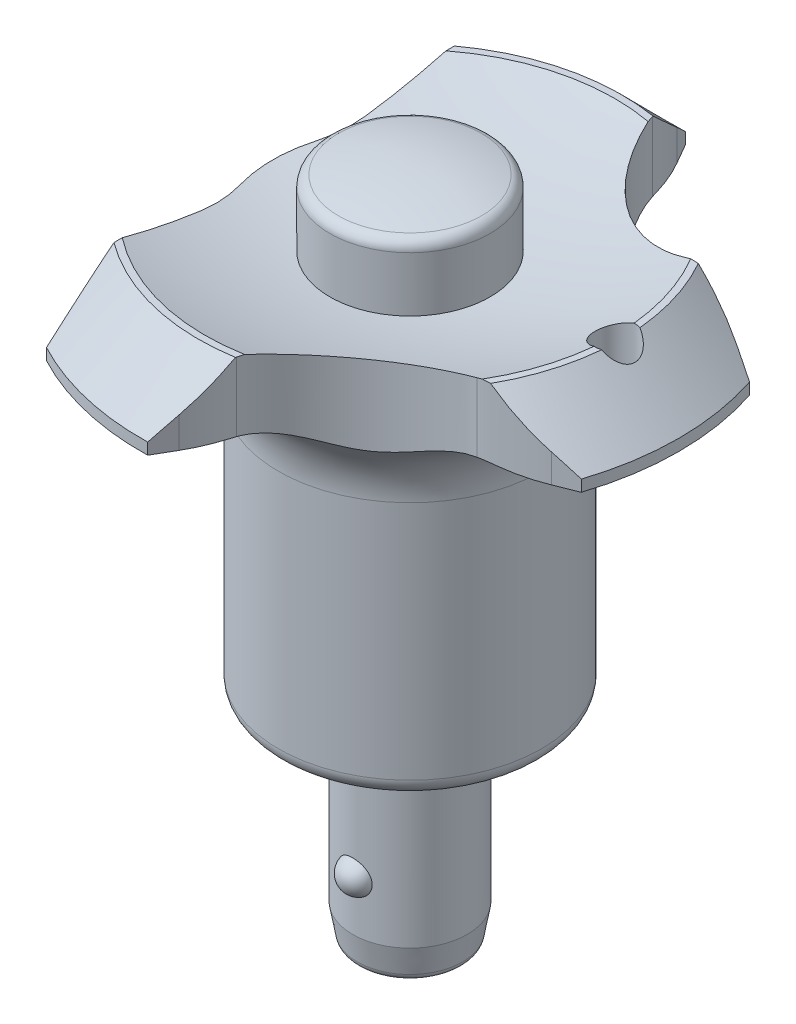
ISO-10303-21;
HEADER;
FILE_DESCRIPTION(('STEP AP214'),'2;1');
FILE_NAME('part.step','',(''),(''),'','','');
FILE_SCHEMA(('AUTOMOTIVE_DESIGN { 1 0 10303 214 1 1 1 1 }'));
ENDSEC;
DATA;
#1=APPLICATION_CONTEXT('core data for automotive mechanical design processes');
#2=APPLICATION_PROTOCOL_DEFINITION('international standard','automotive_design',2000,#1);
#3=PRODUCT_CONTEXT('',#1,'mechanical');
#4=PRODUCT('Part','Part','',(#3));
#5=PRODUCT_RELATED_PRODUCT_CATEGORY('part','',(#4));
#6=PRODUCT_DEFINITION_FORMATION('','',#4);
#7=PRODUCT_DEFINITION_CONTEXT('part definition',#1,'design');
#8=PRODUCT_DEFINITION('design','',#6,#7);
#9=PRODUCT_DEFINITION_SHAPE('','',#8);
#10=(LENGTH_UNIT() NAMED_UNIT(*) SI_UNIT(.MILLI.,.METRE.));
#11=(NAMED_UNIT(*) PLANE_ANGLE_UNIT() SI_UNIT($,.RADIAN.));
#12=(NAMED_UNIT(*) SI_UNIT($,.STERADIAN.) SOLID_ANGLE_UNIT());
#13=UNCERTAINTY_MEASURE_WITH_UNIT(LENGTH_MEASURE(1.E-05),#10,'distance_accuracy_value','');
#14=(GEOMETRIC_REPRESENTATION_CONTEXT(3) GLOBAL_UNCERTAINTY_ASSIGNED_CONTEXT((#13)) GLOBAL_UNIT_ASSIGNED_CONTEXT((#10,
#11,#12)) REPRESENTATION_CONTEXT('',''));
#15=CARTESIAN_POINT('',(0.,0.,0.));
#16=DIRECTION('',(0.,0.,1.));
#17=DIRECTION('',(1.,0.,0.));
#18=AXIS2_PLACEMENT_3D('',#15,#16,#17);
#19=CARTESIAN_POINT('',(0.,40.,0.));
#20=DIRECTION('',(0.,-1.,0.));
#21=DIRECTION('',(0.,0.,-1.));
#22=AXIS2_PLACEMENT_3D('',#19,#20,#21);
#23=CYLINDRICAL_SURFACE('',#22,7.);
#24=CARTESIAN_POINT('',(0.,38.2379000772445,0.));
#25=DIRECTION('',(0.,-1.,0.));
#26=DIRECTION('',(0.,0.,-1.));
#27=AXIS2_PLACEMENT_3D('',#24,#25,#26);
#28=CIRCLE('',#27,7.);
#29=CARTESIAN_POINT('',(0.,38.2379000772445,-7.));
#30=VERTEX_POINT('',#29);
#31=EDGE_CURVE('P0_E11',#30,#30,#28,.T.);
#32=ORIENTED_EDGE('',*,*,#31,.T.);
#33=EDGE_LOOP('',(#32));
#34=FACE_BOUND('',#33,.T.);
#35=CARTESIAN_POINT('',(0.,18.,0.));
#36=DIRECTION('',(0.,1.,0.));
#37=DIRECTION('',(0.,0.,1.));
#38=AXIS2_PLACEMENT_3D('',#35,#36,#37);
#39=CIRCLE('',#38,7.);
#40=CARTESIAN_POINT('',(0.,18.,7.));
#41=VERTEX_POINT('',#40);
#42=EDGE_CURVE('P0_E48',#41,#41,#39,.T.);
#43=ORIENTED_EDGE('',*,*,#42,.T.);
#44=EDGE_LOOP('',(#43));
#45=FACE_BOUND('',#44,.T.);
#46=ADVANCED_FACE('P0_F16',(#34,#45),#23,.T.);
#47=CARTESIAN_POINT('',(0.,18.,0.));
#48=DIRECTION('',(0.,1.,0.));
#49=DIRECTION('',(0.,0.,1.));
#50=AXIS2_PLACEMENT_3D('',#47,#48,#49);
#51=PLANE('',#50);
#52=ORIENTED_EDGE('',*,*,#42,.F.);
#53=EDGE_LOOP('',(#52));
#54=FACE_BOUND('',#53,.T.);
#55=ADVANCED_FACE('P0_F28',(#54),#51,.F.);
#56=CARTESIAN_POINT('',(0.,15.,0.));
#57=DIRECTION('',(0.,1.,0.));
#58=DIRECTION('',(-1.,0.,0.));
#59=AXIS2_PLACEMENT_3D('',#56,#57,#58);
#60=SPHERICAL_SURFACE('',#59,25.);
#61=CARTESIAN_POINT('',(0.,39.2061459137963,0.));
#62=DIRECTION('',(0.,-1.,0.));
#63=DIRECTION('',(0.,0.,-1.));
#64=AXIS2_PLACEMENT_3D('',#61,#62,#63);
#65=CIRCLE('',#64,6.25);
#66=CARTESIAN_POINT('',(0.,39.2061459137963,-6.25));
#67=VERTEX_POINT('',#66);
#68=EDGE_CURVE('P0_E23',#67,#67,#65,.F.);
#69=ORIENTED_EDGE('',*,*,#68,.T.);
#70=EDGE_LOOP('',(#69));
#71=FACE_BOUND('',#70,.T.);
#72=CARTESIAN_POINT('',(0.,40.,0.));
#73=VERTEX_POINT('',#72);
#74=VERTEX_LOOP('',#73);
#75=FACE_BOUND('',#74,.T.);
#76=ADVANCED_FACE('P0_F26',(#71,#75),#60,.T.);
#77=CARTESIAN_POINT('',(0.,38.2379000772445,0.));
#78=DIRECTION('',(0.,-1.,0.));
#79=DIRECTION('',(0.,0.,-1.));
#80=AXIS2_PLACEMENT_3D('',#77,#78,#79);
#81=TOROIDAL_SURFACE('',#80,6.,1.);
#82=ORIENTED_EDGE('',*,*,#31,.F.);
#83=EDGE_LOOP('',(#82));
#84=FACE_BOUND('',#83,.T.);
#85=ORIENTED_EDGE('',*,*,#68,.F.);
#86=EDGE_LOOP('',(#85));
#87=FACE_BOUND('',#86,.T.);
#88=ADVANCED_FACE('P0_F18',(#84,#87),#81,.T.);
#89=CLOSED_SHELL('',(#46,#55,#76,#88));
#90=MANIFOLD_SOLID_BREP('P0_B1',#89);
#91=CARTESIAN_POINT('',(-23.5,36.,0.));
#92=DIRECTION('',(0.,1.,0.));
#93=DIRECTION('',(-1.,0.,0.));
#94=AXIS2_PLACEMENT_3D('',#91,#92,#93);
#95=PLANE('',#94);
#96=CARTESIAN_POINT('',(0.,36.,0.));
#97=DIRECTION('',(0.,1.,0.));
#98=DIRECTION('',(-1.,0.,0.));
#99=AXIS2_PLACEMENT_3D('',#96,#97,#98);
#100=CIRCLE('',#99,17.9164728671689);
#101=CARTESIAN_POINT('',(17.8310068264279,36.,-1.74791177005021));
#102=VERTEX_POINT('',#101);
#103=CARTESIAN_POINT('',(15.4319392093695,36.,-9.10248604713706));
#104=VERTEX_POINT('',#103);
#105=EDGE_CURVE('P1_E287',#102,#104,#100,.T.);
#106=ORIENTED_EDGE('',*,*,#105,.F.);
#107=CARTESIAN_POINT('',(17.9164728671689,36.,0.));
#108=DIRECTION('',(0.,1.,0.));
#109=DIRECTION('',(0.,0.,1.));
#110=AXIS2_PLACEMENT_3D('',#107,#108,#109);
#111=CIRCLE('',#110,1.75);
#112=CARTESIAN_POINT('',(18.4240364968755,36.,-1.67477734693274));
#113=VERTEX_POINT('',#112);
#114=EDGE_CURVE('P1_E40',#113,#102,#111,.T.);
#115=ORIENTED_EDGE('',*,*,#114,.F.);
#116=CARTESIAN_POINT('',(0.,36.,0.));
#117=DIRECTION('',(0.,1.,0.));
#118=DIRECTION('',(-1.,0.,0.));
#119=AXIS2_PLACEMENT_3D('',#116,#117,#118);
#120=CIRCLE('',#119,18.5);
#121=CARTESIAN_POINT('',(16.1204041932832,36.,-9.07648437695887));
#122=VERTEX_POINT('',#121);
#123=EDGE_CURVE('P1_E231',#113,#122,#120,.T.);
#124=ORIENTED_EDGE('',*,*,#123,.T.);
#125=CARTESIAN_POINT('',(15.2479619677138,36.,4.89630505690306));
#126=DIRECTION('',(0.,-1.,0.));
#127=DIRECTION('',(0.,0.,-1.));
#128=AXIS2_PLACEMENT_3D('',#125,#126,#127);
#129=CIRCLE('',#128,14.);
#130=EDGE_CURVE('P1_E497',#104,#122,#129,.T.);
#131=ORIENTED_EDGE('',*,*,#130,.F.);
#132=EDGE_LOOP('',(#106,#115,#124,#131));
#133=FACE_BOUND('',#132,.T.);
#134=ADVANCED_FACE('P1_F16',(#133),#95,.T.);
#135=CARTESIAN_POINT('',(16.120404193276,36.,9.07648437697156));
#136=VERTEX_POINT('',#135);
#137=CARTESIAN_POINT('',(18.4240364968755,36.,1.67477734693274));
#138=VERTEX_POINT('',#137);
#139=EDGE_CURVE('P1_E229',#136,#138,#120,.T.);
#140=ORIENTED_EDGE('',*,*,#139,.T.);
#141=CARTESIAN_POINT('',(17.8310068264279,36.,1.74791177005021));
#142=VERTEX_POINT('',#141);
#143=EDGE_CURVE('P1_E213',#142,#138,#111,.T.);
#144=ORIENTED_EDGE('',*,*,#143,.F.);
#145=CARTESIAN_POINT('',(15.4319392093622,36.,9.1024860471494));
#146=VERTEX_POINT('',#145);
#147=EDGE_CURVE('P1_E285',#146,#142,#100,.T.);
#148=ORIENTED_EDGE('',*,*,#147,.F.);
#149=CARTESIAN_POINT('',(15.2479619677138,36.,-4.89630505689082));
#150=DIRECTION('',(0.,-1.,0.));
#151=DIRECTION('',(0.,0.,1.));
#152=AXIS2_PLACEMENT_3D('',#149,#150,#151);
#153=CIRCLE('',#152,14.);
#154=EDGE_CURVE('P1_E236',#136,#146,#153,.T.);
#155=ORIENTED_EDGE('',*,*,#154,.F.);
#156=EDGE_LOOP('',(#140,#144,#148,#155));
#157=FACE_BOUND('',#156,.T.);
#158=ADVANCED_FACE('P1_F235',(#157),#95,.T.);
#159=CARTESIAN_POINT('',(-19.,30.,0.));
#160=DIRECTION('',(0.,-1.,0.));
#161=DIRECTION('',(1.,0.,0.));
#162=AXIS2_PLACEMENT_3D('',#159,#160,#161);
#163=PLANE('',#162);
#164=CARTESIAN_POINT('',(0.,30.,0.));
#165=DIRECTION('',(0.,1.,0.));
#166=DIRECTION('',(-1.,0.,0.));
#167=AXIS2_PLACEMENT_3D('',#164,#165,#166);
#168=CIRCLE('',#167,19.);
#169=CARTESIAN_POINT('',(16.7190893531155,30.,9.02618696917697));
#170=VERTEX_POINT('',#169);
#171=CARTESIAN_POINT('',(18.9472979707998,30.,1.41417806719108));
#172=VERTEX_POINT('',#171);
#173=EDGE_CURVE('P1_E265',#170,#172,#168,.T.);
#174=ORIENTED_EDGE('',*,*,#173,.T.);
#175=CARTESIAN_POINT('',(17.9164728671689,30.,0.));
#176=DIRECTION('',(0.,-1.,0.));
#177=DIRECTION('',(1.,0.,0.));
#178=AXIS2_PLACEMENT_3D('',#175,#176,#177);
#179=CIRCLE('',#178,1.75);
#180=CARTESIAN_POINT('',(18.9472979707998,30.,-1.41417806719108));
#181=VERTEX_POINT('',#180);
#182=EDGE_CURVE('P1_E32',#172,#181,#179,.F.);
#183=ORIENTED_EDGE('',*,*,#182,.T.);
#184=CARTESIAN_POINT('',(16.7190893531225,30.,-9.02618696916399));
#185=VERTEX_POINT('',#184);
#186=EDGE_CURVE('P1_E266',#181,#185,#168,.T.);
#187=ORIENTED_EDGE('',*,*,#186,.T.);
#188=CARTESIAN_POINT('',(15.2479619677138,30.,4.89630505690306));
#189=DIRECTION('',(0.,-1.,0.));
#190=DIRECTION('',(1.,0.,0.));
#191=AXIS2_PLACEMENT_3D('',#188,#189,#190);
#192=CIRCLE('',#191,14.);
#193=CARTESIAN_POINT('',(20.465066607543,30.,-8.09530066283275));
#194=VERTEX_POINT('',#193);
#195=EDGE_CURVE('P1_E767',#185,#194,#192,.T.);
#196=ORIENTED_EDGE('',*,*,#195,.T.);
#197=DIRECTION('',(0.927971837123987,0.,0.372650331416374));
#198=VECTOR('',#197,1.);
#199=CARTESIAN_POINT('',(-10.7201265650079,30.,-20.6184959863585));
#200=LINE('',#199,#198);
#201=CARTESIAN_POINT('',(22.321010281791,30.,-7.35));
#202=VERTEX_POINT('',#201);
#203=EDGE_CURVE('P1_E595',#194,#202,#200,.T.);
#204=ORIENTED_EDGE('',*,*,#203,.T.);
#205=CARTESIAN_POINT('',(0.,30.,0.));
#206=DIRECTION('',(0.,1.,0.));
#207=DIRECTION('',(-1.,0.,0.));
#208=AXIS2_PLACEMENT_3D('',#205,#206,#207);
#209=CIRCLE('',#208,23.5);
#210=CARTESIAN_POINT('',(22.321010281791,30.,7.35000000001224));
#211=VERTEX_POINT('',#210);
#212=EDGE_CURVE('P1_E251',#211,#202,#209,.T.);
#213=ORIENTED_EDGE('',*,*,#212,.F.);
#214=DIRECTION('',(-0.927971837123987,0.,0.372650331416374));
#215=VECTOR('',#214,1.);
#216=CARTESIAN_POINT('',(-10.7201265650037,30.,20.6184959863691));
#217=LINE('',#216,#215);
#218=CARTESIAN_POINT('',(20.465066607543,30.,8.09530066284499));
#219=VERTEX_POINT('',#218);
#220=EDGE_CURVE('P1_E708',#211,#219,#217,.T.);
#221=ORIENTED_EDGE('',*,*,#220,.T.);
#222=CARTESIAN_POINT('',(15.2479619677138,30.,-4.89630505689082));
#223=DIRECTION('',(0.,-1.,0.));
#224=DIRECTION('',(1.,0.,0.));
#225=AXIS2_PLACEMENT_3D('',#222,#223,#224);
#226=CIRCLE('',#225,14.);
#227=EDGE_CURVE('P1_E665',#219,#170,#226,.T.);
#228=ORIENTED_EDGE('',*,*,#227,.T.);
#229=EDGE_LOOP('',(#174,#183,#187,#196,#204,#213,#221,#228));
#230=FACE_BOUND('',#229,.T.);
#231=ADVANCED_FACE('P1_F612',(#230),#163,.T.);
#232=CARTESIAN_POINT('',(0.,22.5,0.));
#233=DIRECTION('',(0.,1.,0.));
#234=DIRECTION('',(-1.,0.,0.));
#235=AXIS2_PLACEMENT_3D('',#232,#233,#234);
#236=TOROIDAL_SURFACE('',#235,19.,7.5);
#237=CARTESIAN_POINT('',(0.,22.5,0.));
#238=DIRECTION('',(0.,1.,0.));
#239=DIRECTION('',(-1.,0.,0.));
#240=AXIS2_PLACEMENT_3D('',#237,#238,#239);
#241=CIRCLE('',#240,11.5);
#242=CARTESIAN_POINT('',(-11.5,22.5,0.));
#243=VERTEX_POINT('',#242);
#244=EDGE_CURVE('P1_E274',#243,#243,#241,.T.);
#245=ORIENTED_EDGE('',*,*,#244,.T.);
#246=EDGE_LOOP('',(#245));
#247=FACE_BOUND('',#246,.T.);
#248=ORIENTED_EDGE('',*,*,#186,.F.);
#249=CARTESIAN_POINT('',(19.0002,29.9998345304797,-1.37405804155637));
#250=CARTESIAN_POINT('',(18.9621670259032,30.0000721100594,-1.40405462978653));
#251=CARTESIAN_POINT('',(18.9229043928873,30.0000618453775,-1.43245842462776));
#252=CARTESIAN_POINT('',(18.8421643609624,29.99943926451,-1.48591451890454));
#253=CARTESIAN_POINT('',(18.8006869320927,29.998826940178,-1.51096677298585));
#254=CARTESIAN_POINT('',(18.6734351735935,29.9959303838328,-1.58077253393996));
#255=CARTESIAN_POINT('',(18.584719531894,29.992587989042,-1.62027093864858));
#256=CARTESIAN_POINT('',(18.4021303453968,29.9824016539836,-1.68404521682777));
#257=CARTESIAN_POINT('',(18.3082526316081,29.9755548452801,-1.7083085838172));
#258=CARTESIAN_POINT('',(18.1181618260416,29.9579679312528,-1.74100944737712));
#259=CARTESIAN_POINT('',(18.0219496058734,29.9472292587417,-1.74945276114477));
#260=CARTESIAN_POINT('',(17.8303366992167,29.9218778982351,-1.75049381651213));
#261=CARTESIAN_POINT('',(17.7349343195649,29.9072800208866,-1.7431513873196));
#262=CARTESIAN_POINT('',(17.5471606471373,29.8745519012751,-1.71322871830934));
#263=CARTESIAN_POINT('',(17.4547903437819,29.8564205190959,-1.69064355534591));
#264=CARTESIAN_POINT('',(17.2734017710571,29.8169200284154,-1.63042918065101));
#265=CARTESIAN_POINT('',(17.1845073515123,29.7954867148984,-1.59246980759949));
#266=CARTESIAN_POINT('',(17.0144903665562,29.7508341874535,-1.50272225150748));
#267=CARTESIAN_POINT('',(16.9333693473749,29.7276146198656,-1.45093132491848));
#268=CARTESIAN_POINT('',(16.7775437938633,29.6798339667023,-1.33241085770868));
#269=CARTESIAN_POINT('',(16.7032498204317,29.655257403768,-1.26514688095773));
#270=CARTESIAN_POINT('',(16.5669685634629,29.6075854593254,-1.11863761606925));
#271=CARTESIAN_POINT('',(16.5049842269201,29.584490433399,-1.03938946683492));
#272=CARTESIAN_POINT('',(16.3947891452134,29.5417064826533,-0.870191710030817));
#273=CARTESIAN_POINT('',(16.3466708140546,29.5220407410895,-0.78017571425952));
#274=CARTESIAN_POINT('',(16.2665762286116,29.4884206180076,-0.592245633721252));
#275=CARTESIAN_POINT('',(16.2345892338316,29.4744624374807,-0.494336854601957));
#276=CARTESIAN_POINT('',(16.1897704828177,29.4546698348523,-0.300388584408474));
#277=CARTESIAN_POINT('',(16.175801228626,29.4483547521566,-0.204661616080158));
#278=CARTESIAN_POINT('',(16.1638587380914,29.442965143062,-0.0120283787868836));
#279=CARTESIAN_POINT('',(16.1658787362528,29.4438875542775,0.0848773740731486));
#280=CARTESIAN_POINT('',(16.1851398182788,29.452552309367,0.270399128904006));
#281=CARTESIAN_POINT('',(16.201378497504,29.4598454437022,0.359143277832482));
#282=CARTESIAN_POINT('',(16.2470514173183,29.4798790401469,0.532513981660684));
#283=CARTESIAN_POINT('',(16.2764877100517,29.4926203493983,0.617139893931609));
#284=CARTESIAN_POINT('',(16.3484657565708,29.5227477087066,0.782428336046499));
#285=CARTESIAN_POINT('',(16.3913311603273,29.540246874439,0.86292857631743));
#286=CARTESIAN_POINT('',(16.488610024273,29.5782278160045,1.01583807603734));
#287=CARTESIAN_POINT('',(16.543027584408,29.5987106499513,1.08824444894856));
#288=CARTESIAN_POINT('',(16.6668822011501,29.6428521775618,1.22902424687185));
#289=CARTESIAN_POINT('',(16.7371737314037,29.6666338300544,1.29660869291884));
#290=CARTESIAN_POINT('',(16.8879984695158,29.7141504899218,1.41922194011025));
#291=CARTESIAN_POINT('',(16.9685343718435,29.7378854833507,1.47424742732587));
#292=CARTESIAN_POINT('',(17.1413972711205,29.7846942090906,1.57226489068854));
#293=CARTESIAN_POINT('',(17.2340680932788,29.8077030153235,1.61468428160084));
#294=CARTESIAN_POINT('',(17.4260077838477,29.8506027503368,1.68294764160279));
#295=CARTESIAN_POINT('',(17.5252754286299,29.8704942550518,1.70879467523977));
#296=CARTESIAN_POINT('',(17.7248461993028,29.9057260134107,1.74233896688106));
#297=CARTESIAN_POINT('',(17.8250527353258,29.9211725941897,1.75049754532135));
#298=CARTESIAN_POINT('',(18.0259610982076,29.9477661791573,1.74945581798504));
#299=CARTESIAN_POINT('',(18.1266628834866,29.9589135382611,1.74025694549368));
#300=CARTESIAN_POINT('',(18.3214901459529,29.9766047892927,1.70525235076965));
#301=CARTESIAN_POINT('',(18.4157195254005,29.9833094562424,1.68009992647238));
#302=CARTESIAN_POINT('',(18.5988094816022,29.9932000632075,1.61441991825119));
#303=CARTESIAN_POINT('',(18.6876751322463,29.9963893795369,1.57390713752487));
#304=CARTESIAN_POINT('',(18.8124061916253,29.9990115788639,1.5039636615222));
#305=CARTESIAN_POINT('',(18.8514207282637,29.9995392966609,1.48002297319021));
#306=CARTESIAN_POINT('',(18.9273846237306,30.0000621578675,1.42920894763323));
#307=CARTESIAN_POINT('',(18.9643378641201,30.0000583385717,1.40234142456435));
#308=CARTESIAN_POINT('',(19.0002,29.9998345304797,1.37405804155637));
#309=B_SPLINE_CURVE_WITH_KNOTS('',3,(#249,#250,#251,#252,#253,#254,#255,#256,#257,#258,#259,
#260,#261,#262,#263,#264,#265,#266,#267,#268,#269,#270,#271,#272,#273,#274,#275,#276,#277,#278,
#279,#280,#281,#282,#283,#284,#285,#286,#287,#288,#289,#290,#291,#292,#293,#294,#295,#296,#297,
#298,#299,#300,#301,#302,#303,#304,#305,#306,#307,#308),.UNSPECIFIED.,.F.,.F.,(4,2,2,2,2,2,2,2,
2,2,2,2,2,2,2,2,2,2,2,2,2,2,2,2,2,2,2,2,2,4),(0.,0.145230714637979,0.29046339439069,
0.580469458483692,0.870713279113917,1.16085035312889,1.44988972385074,1.73902249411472,
2.03472475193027,2.33048570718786,2.63862322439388,2.94683442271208,3.25705463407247,
3.56706802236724,3.85635873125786,4.14552703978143,4.41581537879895,4.68614576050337,
4.96357032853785,5.24109352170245,5.54087080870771,5.84072710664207,6.15263607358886,
6.46448734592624,6.76810238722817,7.0716923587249,7.36358887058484,7.65520478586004,
7.79241563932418,7.92935872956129),.UNSPECIFIED.);
#310=EDGE_CURVE('P1_E232',#181,#172,#309,.T.);
#311=ORIENTED_EDGE('',*,*,#310,.T.);
#312=ORIENTED_EDGE('',*,*,#173,.F.);
#313=CARTESIAN_POINT('',(19.0002,29.7676490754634,8.59149349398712));
#314=CARTESIAN_POINT('',(18.7645817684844,29.8154776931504,8.65707959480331));
#315=CARTESIAN_POINT('',(18.5258665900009,29.8564543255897,8.71679949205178));
#316=CARTESIAN_POINT('',(18.0433655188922,29.9237457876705,8.82399353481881));
#317=CARTESIAN_POINT('',(17.7995737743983,29.9500426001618,8.87145259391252));
#318=CARTESIAN_POINT('',(17.3135741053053,29.9865231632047,8.95262184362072));
#319=CARTESIAN_POINT('',(17.0714332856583,29.9970209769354,8.98658985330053));
#320=CARTESIAN_POINT('',(16.5857032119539,30.0018812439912,9.04177656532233));
#321=CARTESIAN_POINT('',(16.3421152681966,29.9962565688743,9.06300542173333));
#322=CARTESIAN_POINT('',(15.9045129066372,29.9707577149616,9.08964322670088));
#323=CARTESIAN_POINT('',(15.7104540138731,29.9540015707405,9.09738600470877));
#324=CARTESIAN_POINT('',(15.3219339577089,29.9089292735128,9.10486432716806));
#325=CARTESIAN_POINT('',(15.1274823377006,29.8805202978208,9.10453429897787));
#326=CARTESIAN_POINT('',(14.9341448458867,29.8460787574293,9.10017731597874));
#327=B_SPLINE_CURVE_WITH_KNOTS('',3,(#313,#314,#315,#316,#317,#318,#319,#320,#321,#322,#323,
#324,#325,#326),.UNSPECIFIED.,.F.,.F.,(4,2,2,2,2,2,4),(0.,0.747551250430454,1.49601799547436,
2.22940004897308,2.96219676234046,3.54651953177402,4.13559011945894),.UNSPECIFIED.);
#328=CARTESIAN_POINT('',(14.9343448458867,29.8461143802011,9.10018179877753));
#329=VERTEX_POINT('',#328);
#330=EDGE_CURVE('P1_E662',#170,#329,#327,.T.);
#331=ORIENTED_EDGE('',*,*,#330,.T.);
#332=CARTESIAN_POINT('',(14.9345448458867,29.8461499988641,9.1001862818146));
#333=CARTESIAN_POINT('',(14.7776730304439,29.8182229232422,9.09666592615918));
#334=CARTESIAN_POINT('',(14.6213761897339,29.7868945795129,9.0962420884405));
#335=CARTESIAN_POINT('',(14.3102869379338,29.7182450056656,9.10142249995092));
#336=CARTESIAN_POINT('',(14.1554937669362,29.6809269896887,9.10702352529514));
#337=CARTESIAN_POINT('',(13.8480463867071,29.6011924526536,9.12406045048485));
#338=CARTESIAN_POINT('',(13.6953872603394,29.558791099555,9.13547930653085));
#339=CARTESIAN_POINT('',(13.3918757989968,29.4696235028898,9.16398000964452));
#340=CARTESIAN_POINT('',(13.2410237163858,29.4228566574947,9.18106263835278));
#341=CARTESIAN_POINT('',(12.7875574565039,29.2760524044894,9.24107419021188));
#342=CARTESIAN_POINT('',(12.4878197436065,29.1705318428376,9.2925514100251));
#343=CARTESIAN_POINT('',(11.8954511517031,28.9523945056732,9.41733991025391));
#344=CARTESIAN_POINT('',(11.6028250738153,28.8397731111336,9.49066552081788));
#345=CARTESIAN_POINT('',(11.0926476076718,28.6428308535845,9.63910928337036));
#346=CARTESIAN_POINT('',(10.8738718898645,28.5581805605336,9.70960863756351));
#347=CARTESIAN_POINT('',(10.4388960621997,28.3943373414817,9.86379108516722));
#348=CARTESIAN_POINT('',(10.2226957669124,28.3151440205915,9.94747322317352));
#349=CARTESIAN_POINT('',(9.79395589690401,28.1682154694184,10.1280569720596));
#350=CARTESIAN_POINT('',(9.58140098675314,28.1003976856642,10.2248532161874));
#351=CARTESIAN_POINT('',(9.15855200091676,27.9817636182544,10.4328111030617));
#352=CARTESIAN_POINT('',(8.94825640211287,27.9309350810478,10.5439623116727));
#353=CARTESIAN_POINT('',(8.58999154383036,27.8634617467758,10.747410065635));
#354=CARTESIAN_POINT('',(8.44110862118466,27.84122530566,10.836232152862));
#355=CARTESIAN_POINT('',(8.14633439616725,27.8104352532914,11.0209454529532));
#356=CARTESIAN_POINT('',(8.00044250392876,27.8018789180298,11.1168352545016));
#357=CARTESIAN_POINT('',(7.71306255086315,27.7991870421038,11.3148595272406));
#358=CARTESIAN_POINT('',(7.57156970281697,27.8050352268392,11.4169868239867));
#359=CARTESIAN_POINT('',(7.29397056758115,27.8306044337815,11.6266694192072));
#360=CARTESIAN_POINT('',(7.15786521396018,27.8503278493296,11.7342256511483));
#361=CARTESIAN_POINT('',(6.8451762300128,27.9111902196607,11.9924277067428));
#362=CARTESIAN_POINT('',(6.67114087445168,27.9574144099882,12.1449541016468));
#363=CARTESIAN_POINT('',(6.33499245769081,28.0668600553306,12.4568670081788));
#364=CARTESIAN_POINT('',(6.17288820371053,28.1300939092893,12.6162584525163));
#365=CARTESIAN_POINT('',(5.8588669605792,28.2683729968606,12.9427574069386));
#366=CARTESIAN_POINT('',(5.70705355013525,28.3435184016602,13.1099209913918));
#367=CARTESIAN_POINT('',(5.41445292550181,28.5000172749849,13.4507337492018));
#368=CARTESIAN_POINT('',(5.27366434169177,28.5813699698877,13.6243821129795));
#369=CARTESIAN_POINT('',(4.94422002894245,28.781188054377,14.0545977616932));
#370=CARTESIAN_POINT('',(4.76089734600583,28.9006217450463,14.3148176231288));
#371=CARTESIAN_POINT('',(4.41415052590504,29.1328851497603,14.851278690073));
#372=CARTESIAN_POINT('',(4.25073675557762,29.2457114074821,15.1275281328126));
#373=CARTESIAN_POINT('',(3.94580620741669,29.4548897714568,15.6943820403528));
#374=CARTESIAN_POINT('',(3.80410495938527,29.5513814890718,15.9848342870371));
#375=CARTESIAN_POINT('',(3.54271052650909,29.7210428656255,16.5817874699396));
#376=CARTESIAN_POINT('',(3.42298501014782,29.7942469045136,16.888263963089));
#377=CARTESIAN_POINT('',(3.26107257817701,29.8814375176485,17.3600045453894));
#378=CARTESIAN_POINT('',(3.20982780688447,29.9068037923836,17.5201218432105));
#379=CARTESIAN_POINT('',(3.11365433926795,29.948991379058,17.8440401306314));
#380=CARTESIAN_POINT('',(3.06875130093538,29.9657786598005,18.0078531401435));
#381=CARTESIAN_POINT('',(3.02727508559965,29.9778008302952,18.1729580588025));
#382=B_SPLINE_CURVE_WITH_KNOTS('',3,(#332,#333,#334,#335,#336,#337,#338,#339,#340,#341,#342,
#343,#344,#345,#346,#347,#348,#349,#350,#351,#352,#353,#354,#355,#356,#357,#358,#359,#360,#361,
#362,#363,#364,#365,#366,#367,#368,#369,#370,#371,#372,#373,#374,#375,#376,#377,#378,#379,#380,
#381),.UNSPECIFIED.,.F.,.F.,(4,2,2,2,2,2,2,2,2,2,2,2,2,2,2,2,2,2,2,2,2,2,2,2,4),(0.,
0.47800831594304,0.955760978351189,1.43212200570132,1.90854880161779,2.87314250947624,
3.83837028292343,4.5728575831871,5.3072916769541,6.03614076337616,6.7644630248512,
7.28819341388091,7.81181950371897,8.33485425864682,8.85797925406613,9.56460548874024,
10.271748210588,10.9851883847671,11.6985397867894,12.7174996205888,13.7369877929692,
14.7472664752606,15.7560466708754,16.2657760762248,16.7775120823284),.UNSPECIFIED.);
#383=CARTESIAN_POINT('',(3.02732533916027,29.977786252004,18.1727580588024));
#384=VERTEX_POINT('',#383);
#385=EDGE_CURVE('P1_E668',#329,#384,#382,.T.);
#386=ORIENTED_EDGE('',*,*,#385,.T.);
#387=CARTESIAN_POINT('',(3.02737559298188,29.9777716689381,18.1725580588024));
#388=CARTESIAN_POINT('',(3.00992607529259,29.9828366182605,18.2420077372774));
#389=CARTESIAN_POINT('',(2.99192781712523,29.9870243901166,18.3113828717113));
#390=CARTESIAN_POINT('',(2.95486116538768,29.9936665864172,18.4498703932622));
#391=CARTESIAN_POINT('',(2.93579364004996,29.9961223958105,18.5189829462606));
#392=CARTESIAN_POINT('',(2.89658780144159,29.9993297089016,18.6569430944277));
#393=CARTESIAN_POINT('',(2.87644948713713,30.000081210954,18.7257906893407));
#394=CARTESIAN_POINT('',(2.83510131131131,29.999904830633,18.8632214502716));
#395=CARTESIAN_POINT('',(2.81389060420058,29.9989756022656,18.931804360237));
#396=CARTESIAN_POINT('',(2.79215946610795,29.9972178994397,19.0002));
#397=B_SPLINE_CURVE_WITH_KNOTS('',3,(#387,#388,#389,#390,#391,#392,#393,#394,#395,#396),
.UNSPECIFIED.,.F.,.F.,(4,2,2,2,4),(0.,0.215353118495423,0.430533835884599,0.645714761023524,
0.861068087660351),.UNSPECIFIED.);
#398=CARTESIAN_POINT('',(2.85903351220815,30.,18.7836611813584));
#399=VERTEX_POINT('',#398);
#400=EDGE_CURVE('P1_E481',#384,#399,#397,.T.);
#401=ORIENTED_EDGE('',*,*,#400,.T.);
#402=CARTESIAN_POINT('',(-11.,30.,15.4919333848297));
#403=VERTEX_POINT('',#402);
#404=EDGE_CURVE('P1_E258',#403,#399,#168,.T.);
#405=ORIENTED_EDGE('',*,*,#404,.F.);
#406=CARTESIAN_POINT('',(-11.,26.0001388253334,5.65140051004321));
#407=CARTESIAN_POINT('',(-11.,25.8914638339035,5.52591584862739));
#408=CARTESIAN_POINT('',(-11.,25.7807368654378,5.40220834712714));
#409=CARTESIAN_POINT('',(-11.,25.5547974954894,5.15893017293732));
#410=CARTESIAN_POINT('',(-11.,25.4395848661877,5.03935971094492));
#411=CARTESIAN_POINT('',(-11.,25.2041427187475,4.80527955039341));
#412=CARTESIAN_POINT('',(-11.,25.0839139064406,4.6907691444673));
#413=CARTESIAN_POINT('',(-11.,24.8376323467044,4.4681930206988));
#414=CARTESIAN_POINT('',(-11.,24.7115813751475,4.36012536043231));
#415=CARTESIAN_POINT('',(-11.,24.5009776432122,4.19149901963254));
#416=CARTESIAN_POINT('',(-11.,24.418546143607,4.12829442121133));
#417=CARTESIAN_POINT('',(-11.,24.250608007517,4.0061276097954));
#418=CARTESIAN_POINT('',(-11.,24.1651021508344,3.94716433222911));
#419=CARTESIAN_POINT('',(-11.,23.990699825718,3.83461802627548));
#420=CARTESIAN_POINT('',(-11.,23.901806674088,3.78102991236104));
#421=CARTESIAN_POINT('',(-11.,23.7202750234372,3.68069069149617));
#422=CARTESIAN_POINT('',(-11.,23.6276383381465,3.63393632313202));
#423=CARTESIAN_POINT('',(-11.,23.4059831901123,3.53463454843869));
#424=CARTESIAN_POINT('',(-11.,23.2753468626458,3.48556434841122));
#425=CARTESIAN_POINT('',(-11.,23.0080420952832,3.40886798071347));
#426=CARTESIAN_POINT('',(-11.,22.8713903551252,3.38118597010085));
#427=CARTESIAN_POINT('',(-11.,22.593892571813,3.35172431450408));
#428=CARTESIAN_POINT('',(-11.,22.4530196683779,3.35018280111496));
#429=CARTESIAN_POINT('',(-11.,22.1735538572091,3.37394343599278));
#430=CARTESIAN_POINT('',(-11.,22.0349637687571,3.39927656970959));
#431=CARTESIAN_POINT('',(-11.,21.7272770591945,3.48212446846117));
#432=CARTESIAN_POINT('',(-11.,21.5600827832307,3.54649641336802));
#433=CARTESIAN_POINT('',(-11.,21.3181675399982,3.66124590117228));
#434=CARTESIAN_POINT('',(-11.,21.2388421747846,3.70264003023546));
#435=CARTESIAN_POINT('',(-11.,21.0829635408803,3.79038002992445));
#436=CARTESIAN_POINT('',(-11.,21.0064099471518,3.83672531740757));
#437=CARTESIAN_POINT('',(-11.,20.8281148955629,3.95124195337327));
#438=CARTESIAN_POINT('',(-11.,20.7275025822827,4.0211567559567));
#439=CARTESIAN_POINT('',(-11.,20.5304611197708,4.1666888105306));
#440=CARTESIAN_POINT('',(-11.,20.4340339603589,4.24230872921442));
#441=CARTESIAN_POINT('',(-11.,20.2446995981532,4.39811609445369));
#442=CARTESIAN_POINT('',(-11.,20.1517983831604,4.4783107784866));
#443=CARTESIAN_POINT('',(-11.,19.9692211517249,4.64230213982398));
#444=CARTESIAN_POINT('',(-11.,19.8795457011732,4.72609944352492));
#445=CARTESIAN_POINT('',(-11.,19.6138403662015,4.98286613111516));
#446=CARTESIAN_POINT('',(-11.,19.4421585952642,5.16034317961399));
#447=CARTESIAN_POINT('',(-11.,19.1086455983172,5.52393658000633));
#448=CARTESIAN_POINT('',(-11.,18.9468058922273,5.71004524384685));
#449=CARTESIAN_POINT('',(-11.,18.6289049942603,6.09296931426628));
#450=CARTESIAN_POINT('',(-11.,18.4730058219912,6.28991901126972));
#451=CARTESIAN_POINT('',(-11.,18.1697506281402,6.69032047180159));
#452=CARTESIAN_POINT('',(-11.,18.0223959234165,6.89377323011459));
#453=CARTESIAN_POINT('',(-11.,17.7360597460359,7.30675624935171));
#454=CARTESIAN_POINT('',(-11.,17.5970857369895,7.51629168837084));
#455=CARTESIAN_POINT('',(-11.,17.3278495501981,7.94089288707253));
#456=CARTESIAN_POINT('',(-11.,17.1975881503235,8.15595913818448));
#457=CARTESIAN_POINT('',(-11.,16.82143434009,8.80727089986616));
#458=CARTESIAN_POINT('',(-11.,16.5889546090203,9.25138356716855));
#459=CARTESIAN_POINT('',(-11.,16.16461781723,10.1583038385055));
#460=CARTESIAN_POINT('',(-11.,15.9727284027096,10.6210962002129));
#461=CARTESIAN_POINT('',(-11.,15.6860131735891,11.4214373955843));
#462=CARTESIAN_POINT('',(-11.,15.5793553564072,11.7547653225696));
#463=CARTESIAN_POINT('',(-11.,15.3908562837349,12.4284392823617));
#464=CARTESIAN_POINT('',(-11.,15.309015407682,12.7687854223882));
#465=CARTESIAN_POINT('',(-11.,15.1725616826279,13.4546818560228));
#466=CARTESIAN_POINT('',(-11.,15.1179294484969,13.8002282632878));
#467=CARTESIAN_POINT('',(-11.,15.0382051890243,14.4947213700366));
#468=CARTESIAN_POINT('',(-11.,15.0131067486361,14.8436673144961));
#469=CARTESIAN_POINT('',(-11.,14.9965146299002,15.4756768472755));
#470=CARTESIAN_POINT('',(-11.,14.9995202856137,15.7586003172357));
#471=CARTESIAN_POINT('',(-11.,15.0275360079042,16.3233469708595));
#472=CARTESIAN_POINT('',(-11.,15.052541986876,16.6051703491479));
#473=CARTESIAN_POINT('',(-11.,15.1255709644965,17.1656636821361));
#474=CARTESIAN_POINT('',(-11.,15.1735793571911,17.4443355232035));
#475=CARTESIAN_POINT('',(-11.,15.2934720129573,17.9965080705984));
#476=CARTESIAN_POINT('',(-11.,15.3653530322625,18.2700094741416));
#477=CARTESIAN_POINT('',(-11.,15.5208557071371,18.7685104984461));
#478=CARTESIAN_POINT('',(-11.,15.6010500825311,18.9945819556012));
#479=CARTESIAN_POINT('',(-11.,15.7792740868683,19.4395670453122));
#480=CARTESIAN_POINT('',(-11.,15.8773005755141,19.6584819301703));
#481=CARTESIAN_POINT('',(-11.,16.0912261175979,20.0874227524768));
#482=CARTESIAN_POINT('',(-11.,16.2071254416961,20.2974485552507));
#483=CARTESIAN_POINT('',(-11.,16.4566083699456,20.7067505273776));
#484=CARTESIAN_POINT('',(-11.,16.5901922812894,20.9060265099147));
#485=CARTESIAN_POINT('',(-11.,16.8754508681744,21.2930377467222));
#486=CARTESIAN_POINT('',(-11.,17.0272281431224,21.4806975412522));
#487=CARTESIAN_POINT('',(-11.,17.3475169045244,21.8411854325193));
#488=CARTESIAN_POINT('',(-11.,17.5160288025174,22.0140131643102));
#489=CARTESIAN_POINT('',(-11.,17.8686967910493,22.342786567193));
#490=CARTESIAN_POINT('',(-11.,18.0528472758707,22.4987382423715));
#491=CARTESIAN_POINT('',(-11.,18.4355030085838,22.7919012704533));
#492=CARTESIAN_POINT('',(-11.,18.6340063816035,22.9291150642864));
#493=CARTESIAN_POINT('',(-11.,19.0211389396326,23.1690304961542));
#494=CARTESIAN_POINT('',(-11.,19.2084467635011,23.2738689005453));
#495=CARTESIAN_POINT('',(-11.,19.591777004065,23.4661723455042));
#496=CARTESIAN_POINT('',(-11.,19.7877986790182,23.553638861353));
#497=CARTESIAN_POINT('',(-11.,20.1869541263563,23.7101832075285));
#498=CARTESIAN_POINT('',(-11.,20.3900846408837,23.7792693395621));
#499=CARTESIAN_POINT('',(-11.,20.801878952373,23.8983024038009));
#500=CARTESIAN_POINT('',(-11.,21.010542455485,23.9482503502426));
#501=CARTESIAN_POINT('',(-11.,21.4151424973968,24.025281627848));
#502=CARTESIAN_POINT('',(-11.,21.6107980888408,24.0538476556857));
#503=CARTESIAN_POINT('',(-11.,22.003844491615,24.0939286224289));
#504=CARTESIAN_POINT('',(-11.,22.2012352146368,24.105444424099));
#505=CARTESIAN_POINT('',(-11.,22.5962298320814,24.1113063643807));
#506=CARTESIAN_POINT('',(-11.,22.7938336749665,24.105655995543));
#507=CARTESIAN_POINT('',(-11.,23.1878083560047,24.0772516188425));
#508=CARTESIAN_POINT('',(-11.,23.3841791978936,24.0544976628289));
#509=CARTESIAN_POINT('',(-11.,23.7688501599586,23.9929798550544));
#510=CARTESIAN_POINT('',(-11.,23.9572236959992,23.9546736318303));
#511=CARTESIAN_POINT('',(-11.,24.3301776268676,23.8624608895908));
#512=CARTESIAN_POINT('',(-11.,24.5147567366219,23.8085491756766));
#513=CARTESIAN_POINT('',(-11.,24.878778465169,23.6856519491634));
#514=CARTESIAN_POINT('',(-11.,25.0582221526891,23.6166695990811));
#515=CARTESIAN_POINT('',(-11.,25.4108691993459,23.4642559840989));
#516=CARTESIAN_POINT('',(-11.,25.5840722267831,23.3808239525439));
#517=CARTESIAN_POINT('',(-11.,25.9262212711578,23.1986355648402));
#518=CARTESIAN_POINT('',(-11.,26.0950350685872,23.0996310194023));
#519=CARTESIAN_POINT('',(-11.,26.4241068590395,22.8883034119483));
#520=CARTESIAN_POINT('',(-11.,26.584364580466,22.7759799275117));
#521=CARTESIAN_POINT('',(-11.,26.8954487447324,22.5389822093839));
#522=CARTESIAN_POINT('',(-11.,27.0462756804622,22.4143086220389));
#523=CARTESIAN_POINT('',(-11.,27.3378249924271,22.153579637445));
#524=CARTESIAN_POINT('',(-11.,27.4785439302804,22.0175204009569));
#525=CARTESIAN_POINT('',(-11.,27.7572525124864,21.726730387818));
#526=CARTESIAN_POINT('',(-11.,27.8945862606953,21.571370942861));
#527=CARTESIAN_POINT('',(-11.,28.1566455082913,21.2503544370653));
#528=CARTESIAN_POINT('',(-11.,28.2813698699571,21.0846964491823));
#529=CARTESIAN_POINT('',(-11.,28.5178450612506,20.7443058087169));
#530=CARTESIAN_POINT('',(-11.,28.6295920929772,20.5695705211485));
#531=CARTESIAN_POINT('',(-11.,28.8398043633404,20.212352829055));
#532=CARTESIAN_POINT('',(-11.,28.9382723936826,20.0298720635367));
#533=CARTESIAN_POINT('',(-11.,29.1310233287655,19.6397530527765));
#534=CARTESIAN_POINT('',(-11.,29.2239058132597,19.4314225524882));
#535=CARTESIAN_POINT('',(-11.,29.3935355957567,19.008302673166));
#536=CARTESIAN_POINT('',(-11.,29.470281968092,18.793512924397));
#537=CARTESIAN_POINT('',(-11.,29.6078362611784,18.3588380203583));
#538=CARTESIAN_POINT('',(-11.,29.6686398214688,18.1389514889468));
#539=CARTESIAN_POINT('',(-11.,29.7745962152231,17.6954335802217));
#540=CARTESIAN_POINT('',(-11.,29.8197472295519,17.4718017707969));
#541=CARTESIAN_POINT('',(-11.,29.9001438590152,16.9900120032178));
#542=CARTESIAN_POINT('',(-11.,29.9330683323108,16.7314659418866));
#543=CARTESIAN_POINT('',(-11.,29.9797816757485,16.2126660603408));
#544=CARTESIAN_POINT('',(-11.,29.9935692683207,15.9524121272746));
#545=CARTESIAN_POINT('',(-11.,30.00286794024,15.4315349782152));
#546=CARTESIAN_POINT('',(-11.,29.998374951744,15.1709116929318));
#547=CARTESIAN_POINT('',(-11.,29.9720366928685,14.6505324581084));
#548=CARTESIAN_POINT('',(-11.,29.9501882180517,14.3907766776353));
#549=CARTESIAN_POINT('',(-11.,29.8749142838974,13.7423797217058));
#550=CARTESIAN_POINT('',(-11.,29.8111129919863,13.3549147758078));
#551=CARTESIAN_POINT('',(-11.,29.6497207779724,12.5870504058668));
#552=CARTESIAN_POINT('',(-11.,29.5521152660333,12.2066541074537));
#553=CARTESIAN_POINT('',(-11.,29.3261462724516,11.4541845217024));
#554=CARTESIAN_POINT('',(-11.,29.197710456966,11.0821330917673));
#555=CARTESIAN_POINT('',(-11.,28.9133212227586,10.3488339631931));
#556=CARTESIAN_POINT('',(-11.,28.7573720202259,9.9875846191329));
#557=CARTESIAN_POINT('',(-11.,28.4189694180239,9.27327077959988));
#558=CARTESIAN_POINT('',(-11.,28.2362632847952,8.92032643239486));
#559=CARTESIAN_POINT('',(-11.,27.8477922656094,8.22729148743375));
#560=CARTESIAN_POINT('',(-11.,27.6420214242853,7.88720423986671));
#561=CARTESIAN_POINT('',(-11.,27.2093205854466,7.22152193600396));
#562=CARTESIAN_POINT('',(-11.,26.9824261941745,6.89590381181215));
#563=CARTESIAN_POINT('',(-11.,26.6262474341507,6.41949667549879));
#564=CARTESIAN_POINT('',(-11.,26.5049031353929,6.26272269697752));
#565=CARTESIAN_POINT('',(-11.,26.2567268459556,5.95358847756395));
#566=CARTESIAN_POINT('',(-11.,26.1298954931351,5.80122772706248));
#567=CARTESIAN_POINT('',(-11.,26.0001388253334,5.65140051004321));
#568=B_SPLINE_CURVE_WITH_KNOTS('',3,(#406,#407,#408,#409,#410,#411,#412,#413,#414,#415,#416,
#417,#418,#419,#420,#421,#422,#423,#424,#425,#426,#427,#428,#429,#430,#431,#432,#433,#434,#435,
#436,#437,#438,#439,#440,#441,#442,#443,#444,#445,#446,#447,#448,#449,#450,#451,#452,#453,#454,
#455,#456,#457,#458,#459,#460,#461,#462,#463,#464,#465,#466,#467,#468,#469,#470,#471,#472,#473,
#474,#475,#476,#477,#478,#479,#480,#481,#482,#483,#484,#485,#486,#487,#488,#489,#490,#491,#492,
#493,#494,#495,#496,#497,#498,#499,#500,#501,#502,#503,#504,#505,#506,#507,#508,#509,#510,#511,
#512,#513,#514,#515,#516,#517,#518,#519,#520,#521,#522,#523,#524,#525,#526,#527,#528,#529,#530,
#531,#532,#533,#534,#535,#536,#537,#538,#539,#540,#541,#542,#543,#544,#545,#546,#547,#548,#549,
#550,#551,#552,#553,#554,#555,#556,#557,#558,#559,#560,#561,#562,#563,#564,#565,#566,#567),
.UNSPECIFIED.,.T.,.F.,(4,2,2,2,2,2,2,2,2,2,2,2,2,2,2,2,2,2,2,2,2,2,2,2,2,2,2,2,2,2,2,2,2,2,2,2,
2,2,2,2,2,2,2,2,2,2,2,2,2,2,2,2,2,2,2,2,2,2,2,2,2,2,2,2,2,2,2,2,2,2,2,2,2,2,2,2,2,2,2,2,4),(0.,
0.497978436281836,0.995982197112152,1.49391611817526,1.99169914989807,2.30321626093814,
2.61465490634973,2.92579605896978,3.23678823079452,3.65401907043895,4.07015683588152,
4.49008346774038,4.91049478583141,5.44475666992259,5.713082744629,5.98137725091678,
6.34867116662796,6.71613783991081,7.08420291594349,7.45233224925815,8.19261430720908,
8.93224921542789,9.68555023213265,10.4389670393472,11.1930451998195,11.9471905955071,
13.4490947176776,14.9497971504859,15.9988883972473,17.0479956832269,18.0963544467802,
19.1444854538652,19.9925206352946,20.8403982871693,21.6877382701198,22.5349631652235,
23.2538652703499,23.9726408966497,24.6914274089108,25.4102264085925,26.13328869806,
26.8563687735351,27.5791907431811,28.3019184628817,28.9450258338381,29.588078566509,
30.2308403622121,30.8735680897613,31.466029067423,32.0584600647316,32.6507705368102,
33.2430792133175,33.819094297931,34.3953013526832,34.9713876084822,35.5475044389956,
36.1339625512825,36.7204392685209,37.3068853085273,37.8935299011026,38.5149387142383,
39.1364035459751,39.7580497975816,40.3795651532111,41.0631598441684,41.7467937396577,
42.4306144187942,43.1145145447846,43.8956533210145,44.6768442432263,45.4582090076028,
46.2397180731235,47.4160012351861,48.5927927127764,49.7723726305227,50.9517719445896,
52.1431311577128,53.3347986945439,54.5244926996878,55.1191420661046,55.7137224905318),.UNSPECIFIED.);
#569=CARTESIAN_POINT('',(-11.,27.1492287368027,7.14142842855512));
#570=VERTEX_POINT('',#569);
#571=EDGE_CURVE('P1_E531',#403,#570,#568,.T.);
#572=ORIENTED_EDGE('',*,*,#571,.T.);
#573=CARTESIAN_POINT('',(-11.0000000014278,27.1493665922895,7.14162842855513));
#574=CARTESIAN_POINT('',(-11.0000020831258,27.0822316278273,7.04420897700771));
#575=CARTESIAN_POINT('',(-11.001014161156,27.0148645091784,6.94695052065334));
#576=CARTESIAN_POINT('',(-11.0050634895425,26.8800159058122,6.75254408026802));
#577=CARTESIAN_POINT('',(-11.0081008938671,26.8125344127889,6.65539610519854));
#578=CARTESIAN_POINT('',(-11.0162293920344,26.6774294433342,6.4604541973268));
#579=CARTESIAN_POINT('',(-11.0213322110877,26.6098073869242,6.36265976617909));
#580=CARTESIAN_POINT('',(-11.0336265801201,26.4752675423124,6.1667228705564));
#581=CARTESIAN_POINT('',(-11.0408180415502,26.4083497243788,6.06858042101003));
#582=CARTESIAN_POINT('',(-11.057916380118,26.2712688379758,5.86493087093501));
#583=CARTESIAN_POINT('',(-11.0679745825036,26.2011942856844,5.75937654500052));
#584=CARTESIAN_POINT('',(-11.0906754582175,26.0633758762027,5.54703403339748));
#585=CARTESIAN_POINT('',(-11.1033178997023,25.9956318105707,5.44024595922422));
#586=CARTESIAN_POINT('',(-11.1313484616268,25.863843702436,5.22511894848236));
#587=CARTESIAN_POINT('',(-11.1467295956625,25.79979078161,5.11678458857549));
#588=CARTESIAN_POINT('',(-11.1805240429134,25.6768902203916,4.89768746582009));
#589=CARTESIAN_POINT('',(-11.1989359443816,25.6180401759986,4.78692585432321));
#590=CARTESIAN_POINT('',(-11.2334611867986,25.5234831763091,4.59406076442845));
#591=CARTESIAN_POINT('',(-11.2487494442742,25.4859412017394,4.51272194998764));
#592=CARTESIAN_POINT('',(-11.2812034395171,25.4158687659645,4.34827992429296));
#593=CARTESIAN_POINT('',(-11.2983697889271,25.3833399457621,4.26517614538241));
#594=CARTESIAN_POINT('',(-11.3524010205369,25.2962505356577,4.01547826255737));
#595=CARTESIAN_POINT('',(-11.3922474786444,25.2508474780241,3.8459433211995));
#596=CARTESIAN_POINT('',(-11.4520256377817,25.2132477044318,3.61203665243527));
#597=CARTESIAN_POINT('',(-11.4685613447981,25.2055689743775,3.54915650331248));
#598=CARTESIAN_POINT('',(-11.5027446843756,25.1952020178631,3.4227700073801));
#599=CARTESIAN_POINT('',(-11.5203998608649,25.1925524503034,3.35926255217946));
#600=CARTESIAN_POINT('',(-11.5385186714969,25.1925824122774,3.29584389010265));
#601=B_SPLINE_CURVE_WITH_KNOTS('',3,(#573,#574,#575,#576,#577,#578,#579,#580,#581,#582,#583,
#584,#585,#586,#587,#588,#589,#590,#591,#592,#593,#594,#595,#596,#597,#598,#599,#600),
.UNSPECIFIED.,.F.,.F.,(4,2,2,2,2,2,2,2,2,2,2,2,2,4),(0.,0.354929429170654,0.709885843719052,
1.06688623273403,1.42387148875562,1.80511742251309,2.18632916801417,2.5665820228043,
2.94665825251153,3.21912681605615,3.49168438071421,4.02810429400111,4.22433889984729,
4.42207593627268),.UNSPECIFIED.);
#602=CARTESIAN_POINT('',(-11.5384615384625,25.1925824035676,3.29604389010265));
#603=VERTEX_POINT('',#602);
#604=EDGE_CURVE('P1_E555',#570,#603,#601,.T.);
#605=ORIENTED_EDGE('',*,*,#604,.T.);
#606=CARTESIAN_POINT('',(0.,25.1925824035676,0.));
#607=DIRECTION('',(0.,-1.,0.));
#608=DIRECTION('',(1.,0.,0.));
#609=AXIS2_PLACEMENT_3D('',#606,#607,#608);
#610=CIRCLE('',#609,12.0000000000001);
#611=CARTESIAN_POINT('',(-11.5384615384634,25.1925824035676,-3.29604389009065));
#612=VERTEX_POINT('',#611);
#613=EDGE_CURVE('P1_E562',#603,#612,#610,.T.);
#614=ORIENTED_EDGE('',*,*,#613,.T.);
#615=CARTESIAN_POINT('',(-11.5385186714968,25.1925824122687,-3.29584389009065));
#616=CARTESIAN_POINT('',(-11.5144298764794,25.1924633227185,-3.38012862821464));
#617=CARTESIAN_POINT('',(-11.4911748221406,25.1972030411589,-3.464566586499));
#618=CARTESIAN_POINT('',(-11.44654289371,25.2154924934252,-3.63268812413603));
#619=CARTESIAN_POINT('',(-11.4251599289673,25.2290123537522,-3.71637328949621));
#620=CARTESIAN_POINT('',(-11.3847380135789,25.2636061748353,-3.8808009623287));
#621=CARTESIAN_POINT('',(-11.3656598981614,25.284519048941,-3.96156859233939));
#622=CARTESIAN_POINT('',(-11.3293180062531,25.3327292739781,-4.12162953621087));
#623=CARTESIAN_POINT('',(-11.3120556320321,25.3600315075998,-4.20092167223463));
#624=CARTESIAN_POINT('',(-11.2563694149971,25.4615082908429,-4.46754990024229));
#625=CARTESIAN_POINT('',(-11.2220742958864,25.5478781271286,-4.65106822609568));
#626=CARTESIAN_POINT('',(-11.1618604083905,25.7370779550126,-5.01086468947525));
#627=CARTESIAN_POINT('',(-11.1359630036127,25.8399489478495,-5.18712338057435));
#628=CARTESIAN_POINT('',(-11.0909690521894,26.0563210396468,-5.53810729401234));
#629=CARTESIAN_POINT('',(-11.0719983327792,26.1699756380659,-5.71275281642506));
#630=CARTESIAN_POINT('',(-11.0407866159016,26.4015228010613,-6.05947926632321));
#631=CARTESIAN_POINT('',(-11.0285381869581,26.5194105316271,-6.23156282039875));
#632=CARTESIAN_POINT('',(-11.0129291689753,26.7235722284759,-6.52723444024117));
#633=CARTESIAN_POINT('',(-11.0080432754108,26.8095060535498,-6.65098000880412));
#634=CARTESIAN_POINT('',(-11.0016035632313,26.9802091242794,-6.89693870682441));
#635=CARTESIAN_POINT('',(-11.0000065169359,27.06497873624,-7.01915045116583));
#636=CARTESIAN_POINT('',(-11.0000000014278,27.1493665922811,-7.14162842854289));
#637=B_SPLINE_CURVE_WITH_KNOTS('',3,(#615,#616,#617,#618,#619,#620,#621,#622,#623,#624,#625,
#626,#627,#628,#629,#630,#631,#632,#633,#634,#635,#636),.UNSPECIFIED.,.F.,.F.,(4,2,2,2,2,2,2,2,
2,2,4),(0.,0.262715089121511,0.52454096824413,0.780981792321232,1.03761922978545,
1.65279708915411,2.26952788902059,2.896961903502,3.52370088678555,3.97587581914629,
4.42206854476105),.UNSPECIFIED.);
#638=CARTESIAN_POINT('',(-11.,27.1492287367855,-7.14142842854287));
#639=VERTEX_POINT('',#638);
#640=EDGE_CURVE('P1_E290',#612,#639,#637,.T.);
#641=ORIENTED_EDGE('',*,*,#640,.T.);
#642=CARTESIAN_POINT('',(-11.,29.7199297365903,-17.9242478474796));
#643=CARTESIAN_POINT('',(-11.,29.6628964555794,-18.1622001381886));
#644=CARTESIAN_POINT('',(-11.,29.5968457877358,-18.3979828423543));
#645=CARTESIAN_POINT('',(-11.,29.4463118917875,-18.8636731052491));
#646=CARTESIAN_POINT('',(-11.,29.361825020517,-19.0935794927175));
#647=CARTESIAN_POINT('',(-11.,29.1741401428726,-19.545887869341));
#648=CARTESIAN_POINT('',(-11.,29.0709253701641,-19.7682829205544));
#649=CARTESIAN_POINT('',(-11.,28.8458540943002,-20.2034252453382));
#650=CARTESIAN_POINT('',(-11.,28.7239996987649,-20.4161736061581));
#651=CARTESIAN_POINT('',(-11.,28.4611086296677,-20.8312768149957));
#652=CARTESIAN_POINT('',(-11.,28.3199620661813,-21.0335622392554));
#653=CARTESIAN_POINT('',(-11.,28.0195754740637,-21.4242653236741));
#654=CARTESIAN_POINT('',(-11.,27.8603346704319,-21.612682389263));
#655=CARTESIAN_POINT('',(-11.,27.5247085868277,-21.9733984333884));
#656=CARTESIAN_POINT('',(-11.,27.3483331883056,-22.1457065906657));
#657=CARTESIAN_POINT('',(-11.,26.9795466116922,-22.4722078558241));
#658=CARTESIAN_POINT('',(-11.,26.7871376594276,-22.6264034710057));
#659=CARTESIAN_POINT('',(-11.,26.4097724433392,-22.8988212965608));
#660=CARTESIAN_POINT('',(-11.,26.2263230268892,-23.0191347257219));
#661=CARTESIAN_POINT('',(-11.,25.8492128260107,-23.242520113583));
#662=CARTESIAN_POINT('',(-11.,25.6555530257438,-23.3455937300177));
#663=CARTESIAN_POINT('',(-11.,25.2595892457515,-23.5332861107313));
#664=CARTESIAN_POINT('',(-11.,25.0572892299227,-23.6179132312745));
#665=CARTESIAN_POINT('',(-11.,24.6456263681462,-23.7677671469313));
#666=CARTESIAN_POINT('',(-11.,24.4362639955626,-23.8329952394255));
#667=CARTESIAN_POINT('',(-11.,24.0309926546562,-23.9383978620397));
#668=CARTESIAN_POINT('',(-11.,23.8355244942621,-23.9802739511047));
#669=CARTESIAN_POINT('',(-11.,23.4416837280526,-24.0468089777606));
#670=CARTESIAN_POINT('',(-11.,23.2433113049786,-24.0714689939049));
#671=CARTESIAN_POINT('',(-11.,22.8452183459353,-24.1033107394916));
#672=CARTESIAN_POINT('',(-11.,22.6454981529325,-24.1104967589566));
#673=CARTESIAN_POINT('',(-11.,22.246196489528,-24.107327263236));
#674=CARTESIAN_POINT('',(-11.,22.0466150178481,-24.0969719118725));
#675=CARTESIAN_POINT('',(-11.,21.6564018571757,-24.0595286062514));
#676=CARTESIAN_POINT('',(-11.,21.4657097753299,-24.0330663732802));
#677=CARTESIAN_POINT('',(-11.,21.0871592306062,-23.9642095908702));
#678=CARTESIAN_POINT('',(-11.,20.8993017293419,-23.9218097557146));
#679=CARTESIAN_POINT('',(-11.,20.5278279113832,-23.821497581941));
#680=CARTESIAN_POINT('',(-11.,20.3442105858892,-23.7635889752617));
#681=CARTESIAN_POINT('',(-11.,19.9823852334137,-23.6327967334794));
#682=CARTESIAN_POINT('',(-11.,19.8041774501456,-23.5599124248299));
#683=CARTESIAN_POINT('',(-11.,19.4525747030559,-23.3990423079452));
#684=CARTESIAN_POINT('',(-11.,19.2792451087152,-23.3109137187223));
#685=CARTESIAN_POINT('',(-11.,18.9403247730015,-23.1208604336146));
#686=CARTESIAN_POINT('',(-11.,18.7747342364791,-23.018935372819));
#687=CARTESIAN_POINT('',(-11.,18.4522538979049,-22.8021900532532));
#688=CARTESIAN_POINT('',(-11.,18.2953631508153,-22.6873711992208));
#689=CARTESIAN_POINT('',(-11.,17.9910146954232,-22.4457384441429));
#690=CARTESIAN_POINT('',(-11.,17.8435609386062,-22.318919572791));
#691=CARTESIAN_POINT('',(-11.,17.5514421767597,-22.0474571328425));
#692=CARTESIAN_POINT('',(-11.,17.4073195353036,-21.9022299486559));
#693=CARTESIAN_POINT('',(-11.,17.1310347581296,-21.6009172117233));
#694=CARTESIAN_POINT('',(-11.,16.9988687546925,-21.4448351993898));
#695=CARTESIAN_POINT('',(-11.,16.7468649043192,-21.1229084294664));
#696=CARTESIAN_POINT('',(-11.,16.6270329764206,-20.9570590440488));
#697=CARTESIAN_POINT('',(-11.,16.4001339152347,-20.6169178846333));
#698=CARTESIAN_POINT('',(-11.,16.2930639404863,-20.4426280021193));
#699=CARTESIAN_POINT('',(-11.,16.0825570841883,-20.0703010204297));
#700=CARTESIAN_POINT('',(-11.,15.9803692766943,-19.8715574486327));
#701=CARTESIAN_POINT('',(-11.,15.7915154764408,-19.4668372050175));
#702=CARTESIAN_POINT('',(-11.,15.7048503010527,-19.2608601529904));
#703=CARTESIAN_POINT('',(-11.,15.5469540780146,-18.8430178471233));
#704=CARTESIAN_POINT('',(-11.,15.4757275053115,-18.631150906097));
#705=CARTESIAN_POINT('',(-11.,15.3485316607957,-18.2028799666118));
#706=CARTESIAN_POINT('',(-11.,15.292564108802,-17.9864754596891));
#707=CARTESIAN_POINT('',(-11.,15.1890789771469,-17.521119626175));
#708=CARTESIAN_POINT('',(-11.,15.1436983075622,-17.2716924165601));
#709=CARTESIAN_POINT('',(-11.,15.0715588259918,-16.7701744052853));
#710=CARTESIAN_POINT('',(-11.,15.0448011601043,-16.5180834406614));
#711=CARTESIAN_POINT('',(-11.,15.0091818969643,-16.012618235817));
#712=CARTESIAN_POINT('',(-11.,15.000322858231,-15.7592438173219));
#713=CARTESIAN_POINT('',(-11.,14.9996943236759,-15.2524637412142));
#714=CARTESIAN_POINT('',(-11.,15.0079279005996,-14.9990580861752));
#715=CARTESIAN_POINT('',(-11.,15.0484472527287,-14.3724220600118));
#716=CARTESIAN_POINT('',(-11.,15.0903451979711,-13.9997878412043));
#717=CARTESIAN_POINT('',(-11.,15.2066998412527,-13.2596100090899));
#718=CARTESIAN_POINT('',(-11.,15.2811696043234,-12.892068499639));
#719=CARTESIAN_POINT('',(-11.,15.4599577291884,-12.1634265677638));
#720=CARTESIAN_POINT('',(-11.,15.5643473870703,-11.8023437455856));
#721=CARTESIAN_POINT('',(-11.,15.8000444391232,-11.0892144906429));
#722=CARTESIAN_POINT('',(-11.,15.9313486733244,-10.7371670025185));
#723=CARTESIAN_POINT('',(-11.,16.2638803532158,-9.93288299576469));
#724=CARTESIAN_POINT('',(-11.,16.4740721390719,-9.48432497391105));
#725=CARTESIAN_POINT('',(-11.,16.817256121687,-8.82605961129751));
#726=CARTESIAN_POINT('',(-11.,16.936373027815,-8.60895158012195));
#727=CARTESIAN_POINT('',(-11.,17.1834394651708,-8.17982511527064));
#728=CARTESIAN_POINT('',(-11.,17.311388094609,-7.96780616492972));
#729=CARTESIAN_POINT('',(-11.,17.5759527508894,-7.54879214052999));
#730=CARTESIAN_POINT('',(-11.,17.7125820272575,-7.34180544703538));
#731=CARTESIAN_POINT('',(-11.,17.9941200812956,-6.93356793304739));
#732=CARTESIAN_POINT('',(-11.,18.1390279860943,-6.73231651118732));
#733=CARTESIAN_POINT('',(-11.,18.4370270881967,-6.33627935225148));
#734=CARTESIAN_POINT('',(-11.,18.5901098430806,-6.14148726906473));
#735=CARTESIAN_POINT('',(-11.,18.9049524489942,-5.75908854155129));
#736=CARTESIAN_POINT('',(-11.,19.0667102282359,-5.57148019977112));
#737=CARTESIAN_POINT('',(-11.,19.3654197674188,-5.24291939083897));
#738=CARTESIAN_POINT('',(-11.,19.5005822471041,-5.10034281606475));
#739=CARTESIAN_POINT('',(-11.,19.7779260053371,-4.82197718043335));
#740=CARTESIAN_POINT('',(-11.,19.9201110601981,-4.68619185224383));
#741=CARTESIAN_POINT('',(-11.,20.212022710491,-4.4244466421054));
#742=CARTESIAN_POINT('',(-11.,20.3617073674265,-4.29844039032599));
#743=CARTESIAN_POINT('',(-11.,20.6710793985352,-4.0595235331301));
#744=CARTESIAN_POINT('',(-11.,20.8307517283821,-3.94659392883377));
#745=CARTESIAN_POINT('',(-11.,21.1280708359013,-3.76221159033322));
#746=CARTESIAN_POINT('',(-11.,21.2633596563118,-3.68702136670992));
#747=CARTESIAN_POINT('',(-11.,21.5426849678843,-3.55497642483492));
#748=CARTESIAN_POINT('',(-11.,21.6867067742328,-3.49809188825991));
#749=CARTESIAN_POINT('',(-11.,21.9586858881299,-3.41727052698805));
#750=CARTESIAN_POINT('',(-11.,22.0854646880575,-3.38948845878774));
#751=CARTESIAN_POINT('',(-11.,22.341881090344,-3.35611255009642));
#752=CARTESIAN_POINT('',(-11.,22.4715145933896,-3.35048874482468));
#753=CARTESIAN_POINT('',(-11.,22.7296622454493,-3.36233941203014));
#754=CARTESIAN_POINT('',(-11.,22.8581764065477,-3.37981363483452));
#755=CARTESIAN_POINT('',(-11.,23.1108019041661,-3.43503500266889));
#756=CARTESIAN_POINT('',(-11.,23.2349059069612,-3.47281437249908));
#757=CARTESIAN_POINT('',(-11.,23.4564873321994,-3.55635170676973));
#758=CARTESIAN_POINT('',(-11.,23.5549164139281,-3.59967727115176));
#759=CARTESIAN_POINT('',(-11.,23.7476370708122,-3.69480149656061));
#760=CARTESIAN_POINT('',(-11.,23.8419253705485,-3.74660671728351));
#761=CARTESIAN_POINT('',(-11.,24.0269186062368,-3.85694361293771));
#762=CARTESIAN_POINT('',(-11.,24.1176085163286,-3.91550017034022));
#763=CARTESIAN_POINT('',(-11.,24.2954173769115,-4.03771181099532));
#764=CARTESIAN_POINT('',(-11.,24.3825372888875,-4.10136550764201));
#765=CARTESIAN_POINT('',(-11.,24.597464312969,-4.26634207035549));
#766=CARTESIAN_POINT('',(-11.,24.7232688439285,-4.37026712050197));
#767=CARTESIAN_POINT('',(-11.,24.9689769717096,-4.58491604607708));
#768=CARTESIAN_POINT('',(-11.,25.088877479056,-4.69564341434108));
#769=CARTESIAN_POINT('',(-11.,25.3237796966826,-4.9225271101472));
#770=CARTESIAN_POINT('',(-11.,25.4387731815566,-5.03869191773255));
#771=CARTESIAN_POINT('',(-11.,25.6642771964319,-5.27531153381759));
#772=CARTESIAN_POINT('',(-11.,25.7747870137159,-5.39576701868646));
#773=CARTESIAN_POINT('',(-11.,25.9921780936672,-5.64082491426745));
#774=CARTESIAN_POINT('',(-11.,26.0990418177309,-5.76544285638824));
#775=CARTESIAN_POINT('',(-11.,26.3089042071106,-6.01789669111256));
#776=CARTESIAN_POINT('',(-11.,26.4119025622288,-6.14573284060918));
#777=CARTESIAN_POINT('',(-11.,26.7151516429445,-6.53333616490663));
#778=CARTESIAN_POINT('',(-11.,26.9098816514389,-6.7974545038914));
#779=CARTESIAN_POINT('',(-11.,27.2371800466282,-7.26728847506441));
#780=CARTESIAN_POINT('',(-11.,27.372965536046,-7.47078051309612));
#781=CARTESIAN_POINT('',(-11.,27.6363082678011,-7.88303117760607));
#782=CARTESIAN_POINT('',(-11.,27.7638649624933,-8.09179015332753));
#783=CARTESIAN_POINT('',(-11.,28.1338695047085,-8.72582638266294));
#784=CARTESIAN_POINT('',(-11.,28.3635295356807,-9.15868764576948));
#785=CARTESIAN_POINT('',(-11.,28.7836476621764,-10.0407862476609));
#786=CARTESIAN_POINT('',(-11.,28.9742690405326,-10.4899457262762));
#787=CARTESIAN_POINT('',(-11.,29.3121619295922,-11.4041541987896));
#788=CARTESIAN_POINT('',(-11.,29.4594655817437,-11.8691911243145));
#789=CARTESIAN_POINT('',(-11.,29.6637852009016,-12.6544389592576));
#790=CARTESIAN_POINT('',(-11.,29.7345232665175,-12.9711159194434));
#791=CARTESIAN_POINT('',(-11.,29.8522925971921,-13.6089238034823));
#792=CARTESIAN_POINT('',(-11.,29.8993231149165,-13.9300548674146));
#793=CARTESIAN_POINT('',(-11.,29.9676902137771,-14.5744442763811));
#794=CARTESIAN_POINT('',(-11.,29.9890765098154,-14.8976972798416));
#795=CARTESIAN_POINT('',(-11.,30.0044646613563,-15.5447580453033));
#796=CARTESIAN_POINT('',(-11.,29.9984800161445,-15.868565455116));
#797=CARTESIAN_POINT('',(-11.,29.9594229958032,-16.4831420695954));
#798=CARTESIAN_POINT('',(-11.,29.9290237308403,-16.7740805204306));
#799=CARTESIAN_POINT('',(-11.,29.8433586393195,-17.3524622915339));
#800=CARTESIAN_POINT('',(-11.,29.7880822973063,-17.6399040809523));
#801=CARTESIAN_POINT('',(-11.,29.7199297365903,-17.9242478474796));
#802=B_SPLINE_CURVE_WITH_KNOTS('',3,(#642,#643,#644,#645,#646,#647,#648,#649,#650,#651,#652,
#653,#654,#655,#656,#657,#658,#659,#660,#661,#662,#663,#664,#665,#666,#667,#668,#669,#670,#671,
#672,#673,#674,#675,#676,#677,#678,#679,#680,#681,#682,#683,#684,#685,#686,#687,#688,#689,#690,
#691,#692,#693,#694,#695,#696,#697,#698,#699,#700,#701,#702,#703,#704,#705,#706,#707,#708,#709,
#710,#711,#712,#713,#714,#715,#716,#717,#718,#719,#720,#721,#722,#723,#724,#725,#726,#727,#728,
#729,#730,#731,#732,#733,#734,#735,#736,#737,#738,#739,#740,#741,#742,#743,#744,#745,#746,#747,
#748,#749,#750,#751,#752,#753,#754,#755,#756,#757,#758,#759,#760,#761,#762,#763,#764,#765,#766,
#767,#768,#769,#770,#771,#772,#773,#774,#775,#776,#777,#778,#779,#780,#781,#782,#783,#784,#785,
#786,#787,#788,#789,#790,#791,#792,#793,#794,#795,#796,#797,#798,#799,#800,#801),.UNSPECIFIED.,
.T.,.F.,(4,2,2,2,2,2,2,2,2,2,2,2,2,2,2,2,2,2,2,2,2,2,2,2,2,2,2,2,2,2,2,2,2,2,2,2,2,2,2,2,2,2,2,
2,2,2,2,2,2,2,2,2,2,2,2,2,2,2,2,2,2,2,2,2,2,2,2,2,2,2,2,2,2,2,2,2,2,2,2,4),(0.,
0.733868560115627,1.46788227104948,2.2025563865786,2.93714749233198,3.67611228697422,
4.41510874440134,5.15368152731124,5.89215194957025,6.54942250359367,7.20662981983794,
7.86353879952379,8.52040383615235,9.11936926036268,9.71829715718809,10.3170779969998,
10.9158532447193,11.4927326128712,12.0698034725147,12.6467355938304,13.2236936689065,
13.8063813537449,14.3890844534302,14.9717241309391,15.5546061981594,16.1677541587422,
16.7807030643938,17.3939447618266,18.0070496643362,18.6767855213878,19.3465566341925,
20.0165216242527,20.6865620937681,21.4463782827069,22.2062412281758,22.966212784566,
23.726320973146,24.8495945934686,25.9733191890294,27.0997440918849,28.2260368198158,
29.7099268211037,30.4526854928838,31.1953684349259,31.93921353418,32.6829803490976,
33.425993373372,34.1688297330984,34.7580229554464,35.3475365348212,35.9340581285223,
36.5197165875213,36.9831474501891,37.4458195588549,37.8335199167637,38.2206958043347,
38.6078675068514,38.9956554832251,39.3178138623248,39.640222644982,39.96386014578,
40.2874099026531,40.7765935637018,41.2660305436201,41.7562580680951,42.2465632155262,
42.7389651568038,43.2314065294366,44.2152671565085,44.9489933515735,45.6827683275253,
47.1509576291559,48.6128746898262,50.0737042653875,51.0463686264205,52.0190636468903,
52.9898698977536,53.9601974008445,54.8367710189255,55.7137155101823),.UNSPECIFIED.);
#803=CARTESIAN_POINT('',(-11.,30.0000000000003,-15.4919333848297));
#804=VERTEX_POINT('',#803);
#805=EDGE_CURVE('P1_E524',#639,#804,#802,.T.);
#806=ORIENTED_EDGE('',*,*,#805,.T.);
#807=CARTESIAN_POINT('',(2.8590335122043,30.,-18.783661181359));
#808=VERTEX_POINT('',#807);
#809=EDGE_CURVE('P1_E267',#808,#804,#168,.T.);
#810=ORIENTED_EDGE('',*,*,#809,.F.);
#811=CARTESIAN_POINT('',(2.79215946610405,29.9972178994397,-19.0002));
#812=CARTESIAN_POINT('',(2.81389060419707,29.9989756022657,-18.931804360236));
#813=CARTESIAN_POINT('',(2.83510131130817,29.999904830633,-18.8632214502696));
#814=CARTESIAN_POINT('',(2.87644948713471,30.000081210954,-18.7257906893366));
#815=CARTESIAN_POINT('',(2.89658780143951,29.9993297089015,-18.6569430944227));
#816=CARTESIAN_POINT('',(2.93579364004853,29.9961223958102,-18.5189829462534));
#817=CARTESIAN_POINT('',(2.95486116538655,29.9936665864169,-18.4498703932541));
#818=CARTESIAN_POINT('',(2.99192781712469,29.987024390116,-18.3113828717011));
#819=CARTESIAN_POINT('',(3.00992607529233,29.9828366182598,-18.2420077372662));
#820=CARTESIAN_POINT('',(3.02737559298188,29.9777716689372,-18.1725580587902));
#821=B_SPLINE_CURVE_WITH_KNOTS('',3,(#811,#812,#813,#814,#815,#816,#817,#818,#819,#820),
.UNSPECIFIED.,.F.,.F.,(4,2,2,2,4),(0.,0.215353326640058,0.430534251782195,0.645714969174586,
0.861068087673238),.UNSPECIFIED.);
#822=CARTESIAN_POINT('',(3.02732533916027,29.9777862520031,-18.1727580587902));
#823=VERTEX_POINT('',#822);
#824=EDGE_CURVE('P1_E588',#808,#823,#821,.T.);
#825=ORIENTED_EDGE('',*,*,#824,.T.);
#826=CARTESIAN_POINT('',(3.02727508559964,29.9778008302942,-18.1729580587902));
#827=CARTESIAN_POINT('',(3.05956225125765,29.96843861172,-18.0444451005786));
#828=CARTESIAN_POINT('',(3.09392536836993,29.9561937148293,-17.9167007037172));
#829=CARTESIAN_POINT('',(3.16665487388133,29.9263267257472,-17.6630392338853));
#830=CARTESIAN_POINT('',(3.20501984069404,29.9087065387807,-17.5371215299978));
#831=CARTESIAN_POINT('',(3.32571447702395,29.8484598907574,-17.1630795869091));
#832=CARTESIAN_POINT('',(3.41381902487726,29.7983928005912,-16.9179728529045));
#833=CARTESIAN_POINT('',(3.6040385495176,29.6819591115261,-16.4377607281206));
#834=CARTESIAN_POINT('',(3.70613684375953,29.6156118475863,-16.202643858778));
#835=CARTESIAN_POINT('',(3.92345197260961,29.4702540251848,-15.7424955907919));
#836=CARTESIAN_POINT('',(4.03867582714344,29.3912366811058,-15.5174696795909));
#837=CARTESIAN_POINT('',(4.24468307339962,29.2497832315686,-15.1443062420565));
#838=CARTESIAN_POINT('',(4.33228946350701,29.1895801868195,-14.9935360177));
#839=CARTESIAN_POINT('',(4.51342601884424,29.0663565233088,-14.6967798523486));
#840=CARTESIAN_POINT('',(4.6069562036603,29.0033358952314,-14.5507939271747));
#841=CARTESIAN_POINT('',(4.80009016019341,28.8759007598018,-14.2632008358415));
#842=CARTESIAN_POINT('',(4.89970214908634,28.8114844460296,-14.121600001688));
#843=CARTESIAN_POINT('',(5.10502069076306,28.6830181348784,-13.842748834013));
#844=CARTESIAN_POINT('',(5.21072637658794,28.6189680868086,-13.7054978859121));
#845=CARTESIAN_POINT('',(5.42778589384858,28.4935259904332,-13.4359813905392));
#846=CARTESIAN_POINT('',(5.53909722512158,28.4321190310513,-13.3036886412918));
#847=CARTESIAN_POINT('',(5.76837575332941,28.313615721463,-13.042930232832));
#848=CARTESIAN_POINT('',(5.88634388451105,28.2565199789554,-12.9144651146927));
#849=CARTESIAN_POINT('',(6.1290085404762,28.1491877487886,-12.6616251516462));
#850=CARTESIAN_POINT('',(6.25368936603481,28.0989361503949,-12.5372417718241));
#851=CARTESIAN_POINT('',(6.51018979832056,28.0078264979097,-12.2925230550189));
#852=CARTESIAN_POINT('',(6.64200585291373,27.9669638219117,-12.1721857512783));
#853=CARTESIAN_POINT('',(6.91813371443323,27.8959327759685,-11.9313259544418));
#854=CARTESIAN_POINT('',(7.06273379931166,27.8662530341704,-11.8109855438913));
#855=CARTESIAN_POINT('',(7.35893336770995,27.8225493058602,-11.5761761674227));
#856=CARTESIAN_POINT('',(7.51053178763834,27.8085229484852,-11.4617063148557));
#857=CARTESIAN_POINT('',(7.81893169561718,27.7975386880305,-11.2401929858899));
#858=CARTESIAN_POINT('',(7.97571466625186,27.8005254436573,-11.1331265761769));
#859=CARTESIAN_POINT('',(8.29333113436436,27.8231252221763,-10.9270699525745));
#860=CARTESIAN_POINT('',(8.45416541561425,27.8427414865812,-10.8280813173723));
#861=CARTESIAN_POINT('',(8.82018686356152,27.903713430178,-10.6144374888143));
#862=CARTESIAN_POINT('',(9.02612658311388,27.9493675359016,-10.5023153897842));
#863=CARTESIAN_POINT('',(9.44036487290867,28.0583914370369,-10.2919989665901));
#864=CARTESIAN_POINT('',(9.64866483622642,28.121772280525,-10.1938133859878));
#865=CARTESIAN_POINT('',(10.0695554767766,28.2610186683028,-10.0097724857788));
#866=CARTESIAN_POINT('',(10.28216793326,28.3370197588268,-9.92407241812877));
#867=CARTESIAN_POINT('',(10.7097460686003,28.4955502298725,-9.76563271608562));
#868=CARTESIAN_POINT('',(10.9247121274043,28.5780806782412,-9.69289520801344));
#869=CARTESIAN_POINT('',(11.4452749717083,28.7788562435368,-9.53294749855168));
#870=CARTESIAN_POINT('',(11.7523710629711,28.8980487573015,-9.45177803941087));
#871=CARTESIAN_POINT('',(12.3742823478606,29.1298055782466,-9.31364609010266));
#872=CARTESIAN_POINT('',(12.6890920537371,29.2423744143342,-9.25666689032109));
#873=CARTESIAN_POINT('',(13.1645834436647,29.3986853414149,-9.19036246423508));
#874=CARTESIAN_POINT('',(13.3220539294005,29.4482679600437,-9.17154990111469));
#875=CARTESIAN_POINT('',(13.6389848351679,29.5427824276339,-9.14009873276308));
#876=CARTESIAN_POINT('',(13.7984449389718,29.5877150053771,-9.12745915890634));
#877=CARTESIAN_POINT('',(14.1197338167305,29.6721235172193,-9.10850621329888));
#878=CARTESIAN_POINT('',(14.2815685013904,29.7115816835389,-9.10221304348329));
#879=CARTESIAN_POINT('',(14.6069052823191,29.7839873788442,-9.09620926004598));
#880=CARTESIAN_POINT('',(14.77040833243,29.8169309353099,-9.09650265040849));
#881=CARTESIAN_POINT('',(14.9345448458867,29.8461499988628,-9.10018628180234));
#882=B_SPLINE_CURVE_WITH_KNOTS('',3,(#826,#827,#828,#829,#830,#831,#832,#833,#834,#835,#836,
#837,#838,#839,#840,#841,#842,#843,#844,#845,#846,#847,#848,#849,#850,#851,#852,#853,#854,#855,
#856,#857,#858,#859,#860,#861,#862,#863,#864,#865,#866,#867,#868,#869,#870,#871,#872,#873,#874,
#875,#876,#877,#878,#879,#880,#881),.UNSPECIFIED.,.F.,.F.,(4,2,2,2,2,2,2,2,2,2,2,2,2,2,2,2,2,2,
2,2,2,2,2,2,2,2,2,4),(0.,0.398399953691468,0.796658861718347,1.59103434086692,2.38447091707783,
3.17833385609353,3.73158855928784,4.2848450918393,4.83886642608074,5.39280913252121,
5.94304728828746,6.49336286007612,7.0424430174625,7.59125229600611,8.16183595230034,
8.73233317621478,9.30097571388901,9.86972911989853,10.5849955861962,11.3007088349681,
12.0246757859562,12.7487613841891,13.7656354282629,14.7818059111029,15.2801284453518,
15.778372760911,16.2781981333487,16.7783273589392),.UNSPECIFIED.);
#883=CARTESIAN_POINT('',(14.9343448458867,29.8461143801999,-9.10018179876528));
#884=VERTEX_POINT('',#883);
#885=EDGE_CURVE('P1_E766',#823,#884,#882,.T.);
#886=ORIENTED_EDGE('',*,*,#885,.T.);
#887=CARTESIAN_POINT('',(14.9341448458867,29.846078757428,-9.10017731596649));
#888=CARTESIAN_POINT('',(15.0568504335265,29.8679352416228,-9.10293067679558));
#889=CARTESIAN_POINT('',(15.1800022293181,29.887364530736,-9.10407475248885));
#890=CARTESIAN_POINT('',(15.4269346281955,29.9214916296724,-9.10309506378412));
#891=CARTESIAN_POINT('',(15.5507151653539,29.9361899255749,-9.10097163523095));
#892=CARTESIAN_POINT('',(15.9224798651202,29.9733623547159,-9.08963152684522));
#893=CARTESIAN_POINT('',(16.1710487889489,29.9889423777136,-9.07544876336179));
#894=CARTESIAN_POINT('',(16.6628417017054,30.0026209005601,-9.03416204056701));
#895=CARTESIAN_POINT('',(16.9060787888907,30.0010405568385,-9.0073044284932));
#896=CARTESIAN_POINT('',(17.3901506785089,29.9822026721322,-8.94098807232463));
#897=CARTESIAN_POINT('',(17.6309861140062,29.9649493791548,-8.90153274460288));
#898=CARTESIAN_POINT('',(18.0604472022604,29.9207451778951,-8.81965545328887));
#899=CARTESIAN_POINT('',(18.2497818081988,29.8964610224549,-8.77944703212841));
#900=CARTESIAN_POINT('',(18.6267889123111,29.8388016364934,-8.69123960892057));
#901=CARTESIAN_POINT('',(18.8144376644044,29.8053583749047,-8.64318343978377));
#902=CARTESIAN_POINT('',(19.0002,29.7676490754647,-8.59149349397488));
#903=B_SPLINE_CURVE_WITH_KNOTS('',3,(#887,#888,#889,#890,#891,#892,#893,#894,#895,#896,#897,
#898,#899,#900,#901,#902),.UNSPECIFIED.,.F.,.F.,(4,2,2,2,2,2,2,4),(0.,0.373926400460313,
0.747814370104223,1.49509964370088,2.22842394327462,2.96154954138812,3.54641529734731,
4.13574893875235),.UNSPECIFIED.);
#904=EDGE_CURVE('P1_E369',#884,#185,#903,.T.);
#905=ORIENTED_EDGE('',*,*,#904,.T.);
#906=EDGE_LOOP('',(#248,#311,#312,#331,#386,#401,#405,#572,#605,#614,#641,#806,#810,#825,#886,#905));
#907=FACE_BOUND('',#906,.T.);
#908=ADVANCED_FACE('P1_F301',(#247,#907),#236,.F.);
#909=CARTESIAN_POINT('',(0.,36.,0.));
#910=DIRECTION('',(0.,-1.,0.));
#911=DIRECTION('',(1.,0.,0.));
#912=AXIS2_PLACEMENT_3D('',#909,#910,#911);
#913=CONICAL_SURFACE('',#912,18.5,0.785398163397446);
#914=ORIENTED_EDGE('',*,*,#123,.F.);
#915=CARTESIAN_POINT('',(18.4238299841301,36.0002,-1.67483991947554));
#916=CARTESIAN_POINT('',(18.4755054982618,35.9501522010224,-1.65917759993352));
#917=CARTESIAN_POINT('',(18.5269091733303,35.9005741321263,-1.64100170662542));
#918=CARTESIAN_POINT('',(18.6288814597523,35.8026048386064,-1.59938120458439));
#919=CARTESIAN_POINT('',(18.6794485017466,35.7542157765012,-1.57592768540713));
#920=CARTESIAN_POINT('',(18.7797904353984,35.6585556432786,-1.52329329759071));
#921=CARTESIAN_POINT('',(18.8295518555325,35.6113011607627,-1.49405607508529));
#922=CARTESIAN_POINT('',(18.9271959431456,35.5189089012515,-1.42980876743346));
#923=CARTESIAN_POINT('',(18.9750799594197,35.4737695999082,-1.39480292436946));
#924=CARTESIAN_POINT('',(19.0892734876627,35.3664846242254,-1.30177685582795));
#925=CARTESIAN_POINT('',(19.1542713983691,35.3057373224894,-1.24045695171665));
#926=CARTESIAN_POINT('',(19.2766060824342,35.1918848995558,-1.10491100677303));
#927=CARTESIAN_POINT('',(19.3339710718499,35.1387515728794,-1.03073497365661));
#928=CARTESIAN_POINT('',(19.4281699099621,35.0517976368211,-0.885030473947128));
#929=CARTESIAN_POINT('',(19.4668303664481,35.016228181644,-0.815739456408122));
#930=CARTESIAN_POINT('',(19.535394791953,34.9532807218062,-0.669409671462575));
#931=CARTESIAN_POINT('',(19.5652985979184,34.9259028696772,-0.59237075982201));
#932=CARTESIAN_POINT('',(19.6145456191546,34.8808775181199,-0.431480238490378));
#933=CARTESIAN_POINT('',(19.6338011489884,34.8633107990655,-0.347578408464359));
#934=CARTESIAN_POINT('',(19.6597171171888,34.8396789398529,-0.176289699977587));
#935=CARTESIAN_POINT('',(19.6663897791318,34.8336026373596,-0.0889062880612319));
#936=CARTESIAN_POINT('',(19.6665432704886,34.8334631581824,0.0738148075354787));
#937=CARTESIAN_POINT('',(19.661710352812,34.8378643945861,0.149158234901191));
#938=CARTESIAN_POINT('',(19.6426050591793,34.8552812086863,0.297599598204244));
#939=CARTESIAN_POINT('',(19.6283330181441,34.8682964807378,0.370697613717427));
#940=CARTESIAN_POINT('',(19.5915411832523,34.9019030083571,0.511751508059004));
#941=CARTESIAN_POINT('',(19.5691411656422,34.9223842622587,0.579765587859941));
#942=CARTESIAN_POINT('',(19.5172709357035,34.969911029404,0.710566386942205));
#943=CARTESIAN_POINT('',(19.4877980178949,34.996959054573,0.77335109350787));
#944=CARTESIAN_POINT('',(19.4097264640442,35.0687898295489,0.917545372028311));
#945=CARTESIAN_POINT('',(19.3582401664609,35.1162974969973,0.996040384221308));
#946=CARTESIAN_POINT('',(19.2468001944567,35.219576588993,1.14066070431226));
#947=CARTESIAN_POINT('',(19.1868271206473,35.2753669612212,1.2067568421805));
#948=CARTESIAN_POINT('',(19.0393371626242,35.4132439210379,1.34733695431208));
#949=CARTESIAN_POINT('',(18.9494358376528,35.4977799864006,1.41690196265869));
#950=CARTESIAN_POINT('',(18.7634987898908,35.6739094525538,1.53532461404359));
#951=CARTESIAN_POINT('',(18.6674634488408,35.7655024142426,1.58418354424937));
#952=CARTESIAN_POINT('',(18.5214985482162,35.9057921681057,1.64290396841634));
#953=CARTESIAN_POINT('',(18.4727694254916,35.9528003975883,1.66000045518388));
#954=CARTESIAN_POINT('',(18.4238299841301,36.0002,1.67483991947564));
#955=B_SPLINE_CURVE_WITH_KNOTS('',3,(#915,#916,#917,#918,#919,#920,#921,#922,#923,#924,#925,
#926,#927,#928,#929,#930,#931,#932,#933,#934,#935,#936,#937,#938,#939,#940,#941,#942,#943,#944,
#945,#946,#947,#948,#949,#950,#951,#952,#953,#954),.UNSPECIFIED.,.F.,.F.,(4,2,2,2,2,2,2,2,2,2,2,
2,2,2,2,2,2,2,2,4),(0.,0.220861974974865,0.442099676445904,0.665609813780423,0.888956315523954,
1.21195649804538,1.53372737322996,1.79357698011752,2.05343142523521,2.31539498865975,
2.57710393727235,2.80286175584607,3.02861156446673,3.25116145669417,3.47379661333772,
3.78768945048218,4.10231174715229,4.52501832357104,4.94769861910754,5.15698814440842),.UNSPECIFIED.);
#956=EDGE_CURVE('P1_E216',#113,#138,#955,.T.);
#957=ORIENTED_EDGE('',*,*,#956,.T.);
#958=ORIENTED_EDGE('',*,*,#139,.F.);
#959=CARTESIAN_POINT('',(16.1201663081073,36.0002,9.07649922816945));
#960=CARTESIAN_POINT('',(16.4831730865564,35.694990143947,9.0538510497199));
#961=CARTESIAN_POINT('',(16.847582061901,35.3924237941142,9.0168896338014));
#962=CARTESIAN_POINT('',(17.5755236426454,34.7944703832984,8.91372600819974));
#963=CARTESIAN_POINT('',(17.9390534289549,34.4990583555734,8.84764822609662));
#964=CARTESIAN_POINT('',(18.6647033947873,33.9146807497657,8.68545075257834));
#965=CARTESIAN_POINT('',(19.026823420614,33.6257158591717,8.58932787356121));
#966=CARTESIAN_POINT('',(19.7487720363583,33.0537609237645,8.36590384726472));
#967=CARTESIAN_POINT('',(20.10858434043,32.770801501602,8.23847189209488));
#968=CARTESIAN_POINT('',(20.4652666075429,32.4918258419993,8.0952203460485));
#969=B_SPLINE_CURVE_WITH_KNOTS('',3,(#959,#960,#961,#962,#963,#964,#965,#966,#967,#968),
.UNSPECIFIED.,.F.,.F.,(4,2,2,2,4),(0.,1.42427142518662,2.84251443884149,4.26090797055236,
5.68533137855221),.UNSPECIFIED.);
#970=CARTESIAN_POINT('',(20.465066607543,32.4919822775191,8.09530066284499));
#971=VERTEX_POINT('',#970);
#972=EDGE_CURVE('P1_E431',#136,#971,#969,.T.);
#973=ORIENTED_EDGE('',*,*,#972,.T.);
#974=CARTESIAN_POINT('',(20.464866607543,32.4921387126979,8.09538097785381));
#975=CARTESIAN_POINT('',(20.6210646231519,32.3699632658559,8.03265575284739));
#976=CARTESIAN_POINT('',(20.7768604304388,32.2471917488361,7.9700920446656));
#977=CARTESIAN_POINT('',(21.0876830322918,32.0005369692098,7.84527344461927));
#978=CARTESIAN_POINT('',(21.2427098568,31.8766537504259,7.78301854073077));
#979=CARTESIAN_POINT('',(21.5520415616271,31.6278468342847,7.65879864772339));
#980=CARTESIAN_POINT('',(21.7063464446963,31.5029231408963,7.59683365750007));
#981=CARTESIAN_POINT('',(22.0142786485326,31.2520961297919,7.47317576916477));
#982=CARTESIAN_POINT('',(22.1679059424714,31.1261927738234,7.41148288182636));
#983=CARTESIAN_POINT('',(22.321210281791,30.9998351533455,7.34991968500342));
#984=B_SPLINE_CURVE_WITH_KNOTS('',3,(#974,#975,#976,#977,#978,#979,#980,#981,#982,#983),
.UNSPECIFIED.,.F.,.F.,(4,2,2,2,4),(0.,0.623962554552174,1.24790062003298,1.87183630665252,
2.49579647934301),.UNSPECIFIED.);
#985=CARTESIAN_POINT('',(22.321010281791,31.,7.35000000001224));
#986=VERTEX_POINT('',#985);
#987=EDGE_CURVE('P1_E441',#971,#986,#984,.T.);
#988=ORIENTED_EDGE('',*,*,#987,.T.);
#989=CARTESIAN_POINT('',(0.,31.,0.));
#990=DIRECTION('',(0.,1.,0.));
#991=DIRECTION('',(-1.,0.,0.));
#992=AXIS2_PLACEMENT_3D('',#989,#990,#991);
#993=CIRCLE('',#992,23.5);
#994=CARTESIAN_POINT('',(22.321010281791,31.0000000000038,-7.35));
#995=VERTEX_POINT('',#994);
#996=EDGE_CURVE('P1_E705',#995,#986,#993,.F.);
#997=ORIENTED_EDGE('',*,*,#996,.F.);
#998=CARTESIAN_POINT('',(22.321210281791,30.9998351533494,-7.34991968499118));
#999=CARTESIAN_POINT('',(22.1679059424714,31.1261927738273,-7.41148288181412));
#1000=CARTESIAN_POINT('',(22.0142786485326,31.2520961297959,-7.47317576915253));
#1001=CARTESIAN_POINT('',(21.7063464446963,31.5029231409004,-7.59683365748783));
#1002=CARTESIAN_POINT('',(21.552041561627,31.6278468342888,-7.65879864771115));
#1003=CARTESIAN_POINT('',(21.2427098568,31.8766537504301,-7.78301854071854));
#1004=CARTESIAN_POINT('',(21.0876830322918,32.0005369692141,-7.84527344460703));
#1005=CARTESIAN_POINT('',(20.7768604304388,32.2471917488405,-7.97009204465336));
#1006=CARTESIAN_POINT('',(20.6210646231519,32.3699632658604,-8.03265575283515));
#1007=CARTESIAN_POINT('',(20.464866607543,32.4921387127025,-8.09538097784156));
#1008=B_SPLINE_CURVE_WITH_KNOTS('',3,(#998,#999,#1000,#1001,#1002,#1003,#1004,#1005,#1006,
#1007),.UNSPECIFIED.,.F.,.F.,(4,2,2,2,4),(0.,0.62396017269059,1.24789585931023,1.87183392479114,
2.49579647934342),.UNSPECIFIED.);
#1009=CARTESIAN_POINT('',(20.465066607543,32.4919822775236,-8.09530066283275));
#1010=VERTEX_POINT('',#1009);
#1011=EDGE_CURVE('P1_E408',#995,#1010,#1008,.T.);
#1012=ORIENTED_EDGE('',*,*,#1011,.T.);
#1013=CARTESIAN_POINT('',(20.4652666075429,32.4918258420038,-8.09522034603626));
#1014=CARTESIAN_POINT('',(20.1085843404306,32.7708015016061,-8.2384718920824));
#1015=CARTESIAN_POINT('',(19.7487720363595,33.0537609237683,-8.36590384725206));
#1016=CARTESIAN_POINT('',(19.0268234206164,33.6257158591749,-8.58932787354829));
#1017=CARTESIAN_POINT('',(18.6647033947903,33.9146807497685,-8.68545075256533));
#1018=CARTESIAN_POINT('',(17.9390534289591,34.4990583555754,-8.84764822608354));
#1019=CARTESIAN_POINT('',(17.5755236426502,34.7944703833,-8.91372600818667));
#1020=CARTESIAN_POINT('',(16.8475820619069,35.3924237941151,-9.01688963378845));
#1021=CARTESIAN_POINT('',(16.483173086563,35.6949901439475,-9.05385104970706));
#1022=CARTESIAN_POINT('',(16.1201663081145,36.0002,-9.07649922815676));
#1023=B_SPLINE_CURVE_WITH_KNOTS('',3,(#1013,#1014,#1015,#1016,#1017,#1018,#1019,#1020,#1021,
#1022),.UNSPECIFIED.,.F.,.F.,(4,2,2,2,4),(0.,1.42442340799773,2.8428169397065,4.26105995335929,
5.68533137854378),.UNSPECIFIED.);
#1024=EDGE_CURVE('P1_E363',#1010,#122,#1023,.T.);
#1025=ORIENTED_EDGE('',*,*,#1024,.T.);
#1026=EDGE_LOOP('',(#914,#957,#958,#973,#988,#997,#1012,#1025));
#1027=FACE_BOUND('',#1026,.T.);
#1028=ADVANCED_FACE('P1_F227',(#1027),#913,.T.);
#1029=CARTESIAN_POINT('',(0.,88.,0.));
#1030=DIRECTION('',(-1.,0.,0.));
#1031=DIRECTION('',(0.,1.,0.));
#1032=AXIS2_PLACEMENT_3D('',#1029,#1030,#1031);
#1033=SPHERICAL_SURFACE('',#1032,55.);
#1034=CARTESIAN_POINT('',(0.,33.4472732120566,0.));
#1035=DIRECTION('',(0.,1.,0.));
#1036=DIRECTION('',(-1.,0.,0.));
#1037=AXIS2_PLACEMENT_3D('',#1034,#1035,#1036);
#1038=CIRCLE('',#1037,7.);
#1039=CARTESIAN_POINT('',(-7.,33.4472732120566,0.));
#1040=VERTEX_POINT('',#1039);
#1041=EDGE_CURVE('P1_E222',#1040,#1040,#1038,.F.);
#1042=ORIENTED_EDGE('',*,*,#1041,.T.);
#1043=EDGE_LOOP('',(#1042));
#1044=FACE_BOUND('',#1043,.T.);
#1045=CARTESIAN_POINT('',(17.831587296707,36.0002000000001,-1.74794005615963));
#1046=CARTESIAN_POINT('',(17.780499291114,35.9825976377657,-1.7454570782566));
#1047=CARTESIAN_POINT('',(17.7295290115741,35.9650448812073,-1.74073741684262));
#1048=CARTESIAN_POINT('',(17.6281246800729,35.930141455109,-1.72684062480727));
#1049=CARTESIAN_POINT('',(17.5776906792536,35.9127908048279,-1.71766307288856));
#1050=CARTESIAN_POINT('',(17.4276302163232,35.8611915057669,-1.68346224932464));
#1051=CARTESIAN_POINT('',(17.3292748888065,35.8274057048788,-1.65177224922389));
#1052=CARTESIAN_POINT('',(17.1389601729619,35.7620909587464,-1.57120228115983));
#1053=CARTESIAN_POINT('',(17.0470083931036,35.7305646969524,-1.52230226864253));
#1054=CARTESIAN_POINT('',(16.8725441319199,35.6707975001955,-1.40838475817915));
#1055=CARTESIAN_POINT('',(16.7900246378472,35.6425541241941,-1.34337934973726));
#1056=CARTESIAN_POINT('',(16.639686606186,35.5911347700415,-1.20111958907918));
#1057=CARTESIAN_POINT('',(16.5714856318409,35.5678267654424,-1.12431771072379));
#1058=CARTESIAN_POINT('',(16.449087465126,35.5260190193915,-0.959083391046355));
#1059=CARTESIAN_POINT('',(16.3948886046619,35.5075187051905,-0.870652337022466));
#1060=CARTESIAN_POINT('',(16.3052170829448,35.4769216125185,-0.689906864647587));
#1061=CARTESIAN_POINT('',(16.2688813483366,35.4645296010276,-0.598070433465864));
#1062=CARTESIAN_POINT('',(16.2121015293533,35.4451691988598,-0.40907653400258));
#1063=CARTESIAN_POINT('',(16.1916515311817,35.4381987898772,-0.311921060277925));
#1064=CARTESIAN_POINT('',(16.1680121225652,35.4301415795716,-0.11973956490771));
#1065=CARTESIAN_POINT('',(16.1640895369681,35.4288048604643,-0.0248135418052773));
#1066=CARTESIAN_POINT('',(16.1716386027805,35.4313776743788,0.164345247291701));
#1067=CARTESIAN_POINT('',(16.1831083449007,35.4352865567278,0.258578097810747));
#1068=CARTESIAN_POINT('',(16.2207158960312,35.4481065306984,0.442226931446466));
#1069=CARTESIAN_POINT('',(16.2466320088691,35.4569420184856,0.531693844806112));
#1070=CARTESIAN_POINT('',(16.3120436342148,35.4792512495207,0.704896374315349));
#1071=CARTESIAN_POINT('',(16.3515406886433,35.4927255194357,0.788631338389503));
#1072=CARTESIAN_POINT('',(16.4436932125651,35.524179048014,0.949847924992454));
#1073=CARTESIAN_POINT('',(16.496594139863,35.542242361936,1.02717256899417));
#1074=CARTESIAN_POINT('',(16.61341914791,35.5821580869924,1.17183604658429));
#1075=CARTESIAN_POINT('',(16.6773431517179,35.604010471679,1.23917494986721));
#1076=CARTESIAN_POINT('',(16.8174306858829,35.6519339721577,1.36523841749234));
#1077=CARTESIAN_POINT('',(16.8940151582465,35.6781505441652,1.42343985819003));
#1078=CARTESIAN_POINT('',(17.0549745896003,35.7332966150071,1.52625671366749));
#1079=CARTESIAN_POINT('',(17.139355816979,35.7622282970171,1.57086107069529));
#1080=CARTESIAN_POINT('',(17.3226815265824,35.8251413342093,1.64949635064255));
#1081=CARTESIAN_POINT('',(17.4222309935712,35.8593359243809,1.68196619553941));
#1082=CARTESIAN_POINT('',(17.5742124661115,35.9115943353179,1.71699552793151));
#1083=CARTESIAN_POINT('',(17.6253319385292,35.9291804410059,1.72639351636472));
#1084=CARTESIAN_POINT('',(17.72812244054,35.964560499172,1.74060634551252));
#1085=CARTESIAN_POINT('',(17.77979336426,35.9823544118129,1.74542205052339));
#1086=CARTESIAN_POINT('',(17.831587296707,36.0002000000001,1.74794005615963));
#1087=B_SPLINE_CURVE_WITH_KNOTS('',3,(#1045,#1046,#1047,#1048,#1049,#1050,#1051,#1052,#1053,
#1054,#1055,#1056,#1057,#1058,#1059,#1060,#1061,#1062,#1063,#1064,#1065,#1066,#1067,#1068,#1069,
#1070,#1071,#1072,#1073,#1074,#1075,#1076,#1077,#1078,#1079,#1080,#1081,#1082,#1083,#1084,#1085,
#1086),.UNSPECIFIED.,.F.,.F.,(4,2,2,2,2,2,2,2,2,2,2,2,2,2,2,2,2,2,2,2,4),(0.,0.162180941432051,
0.324377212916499,0.648862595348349,0.973727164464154,1.29834860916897,1.61270218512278,
1.92701829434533,2.22411875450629,2.52110855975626,2.80477503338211,3.08840632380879,
3.36780025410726,3.64722591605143,3.93219398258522,4.21716006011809,4.51493246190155,
4.8129463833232,5.14163774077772,5.30608442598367,5.4705000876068),.UNSPECIFIED.);
#1088=EDGE_CURVE('P1_E217',#102,#142,#1087,.T.);
#1089=ORIENTED_EDGE('',*,*,#1088,.F.);
#1090=ORIENTED_EDGE('',*,*,#105,.T.);
#1091=CARTESIAN_POINT('',(11.6149319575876,34.9366565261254,-8.62409038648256));
#1092=CARTESIAN_POINT('',(11.8871363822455,35.0081249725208,-8.69724345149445));
#1093=CARTESIAN_POINT('',(12.1611930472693,35.0810402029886,-8.76206127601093));
#1094=CARTESIAN_POINT('',(12.7120812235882,35.2295327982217,-8.87498064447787));
#1095=CARTESIAN_POINT('',(12.988913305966,35.305110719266,-8.92307867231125));
#1096=CARTESIAN_POINT('',(13.5434839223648,35.4584393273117,-9.00236411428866));
#1097=CARTESIAN_POINT('',(13.8212173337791,35.5361829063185,-9.03360125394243));
#1098=CARTESIAN_POINT('',(14.3773864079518,35.6937905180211,-9.07938520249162));
#1099=CARTESIAN_POINT('',(14.6558218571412,35.7736539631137,-9.09393658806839));
#1100=CARTESIAN_POINT('',(15.1003733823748,35.9027099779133,-9.10390459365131));
#1101=CARTESIAN_POINT('',(15.2665618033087,35.9513008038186,-9.10466739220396));
#1102=CARTESIAN_POINT('',(15.5975390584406,36.0487646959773,-9.10030179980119));
#1103=CARTESIAN_POINT('',(15.7623296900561,36.0976335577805,-9.09521367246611));
#1104=CARTESIAN_POINT('',(16.2861977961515,36.2540844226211,-9.06977581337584));
#1105=CARTESIAN_POINT('',(16.6444899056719,36.3627314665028,-9.03849231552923));
#1106=CARTESIAN_POINT('',(17.3571355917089,36.5821612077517,-8.94856741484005));
#1107=CARTESIAN_POINT('',(17.7114868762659,36.6929450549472,-8.88991086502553));
#1108=CARTESIAN_POINT('',(18.4158723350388,36.9165659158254,-8.74532872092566));
#1109=CARTESIAN_POINT('',(18.7658777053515,37.0294102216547,-8.6592738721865));
#1110=CARTESIAN_POINT('',(19.4577526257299,37.2559717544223,-8.46061410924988));
#1111=CARTESIAN_POINT('',(19.799626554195,37.3696884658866,-8.34802385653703));
#1112=CARTESIAN_POINT('',(20.1365900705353,37.4835737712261,-8.22243403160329));
#1113=B_SPLINE_CURVE_WITH_KNOTS('',3,(#1091,#1092,#1093,#1094,#1095,#1096,#1097,#1098,#1099,
#1100,#1101,#1102,#1103,#1104,#1105,#1106,#1107,#1108,#1109,#1110,#1111,#1112),.UNSPECIFIED.,
.F.,.F.,(4,2,2,2,2,2,2,2,2,2,4),(0.,0.872208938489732,1.74460118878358,2.61440635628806,
3.48397289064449,4.00332191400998,4.51911827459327,5.64511233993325,6.77173021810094,
7.90374381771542,9.03513341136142),.UNSPECIFIED.);
#1114=CARTESIAN_POINT('',(14.9343448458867,35.8545108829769,-9.10018179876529));
#1115=VERTEX_POINT('',#1114);
#1116=EDGE_CURVE('P1_E332',#1115,#104,#1113,.T.);
#1117=ORIENTED_EDGE('',*,*,#1116,.F.);
#1118=CARTESIAN_POINT('',(3.1763494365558,36.0002,-17.6332527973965));
#1119=CARTESIAN_POINT('',(3.26491589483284,35.9059483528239,-17.3393761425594));
#1120=CARTESIAN_POINT('',(3.3652271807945,35.8161061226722,-17.0475738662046));
#1121=CARTESIAN_POINT('',(3.58915767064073,35.6458555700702,-16.4701092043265));
#1122=CARTESIAN_POINT('',(3.71278503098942,35.5654505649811,-16.1844490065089));
#1123=CARTESIAN_POINT('',(3.98332533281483,35.4146328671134,-15.6210066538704));
#1124=CARTESIAN_POINT('',(4.13027615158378,35.3442367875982,-15.3432381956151));
#1125=CARTESIAN_POINT('',(4.44676020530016,35.2142002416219,-14.79828209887));
#1126=CARTESIAN_POINT('',(4.61629063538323,35.1545584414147,-14.5310931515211));
#1127=CARTESIAN_POINT('',(4.9776210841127,35.0464175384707,-14.0087627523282));
#1128=CARTESIAN_POINT('',(5.16947791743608,34.9979478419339,-13.7536544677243));
#1129=CARTESIAN_POINT('',(5.57399670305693,34.912814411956,-13.2584055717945));
#1130=CARTESIAN_POINT('',(5.78665776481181,34.8761501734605,-13.0182643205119));
#1131=CARTESIAN_POINT('',(6.23112390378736,34.815026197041,-12.5552951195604));
#1132=CARTESIAN_POINT('',(6.46290498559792,34.7905514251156,-12.3324461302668));
#1133=CARTESIAN_POINT('',(6.94416559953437,34.7539888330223,-11.9056550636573));
#1134=CARTESIAN_POINT('',(7.19364422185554,34.7419003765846,-11.7017120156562));
#1135=CARTESIAN_POINT('',(7.69749155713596,34.7304796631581,-11.32263261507));
#1136=CARTESIAN_POINT('',(7.95120703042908,34.7306294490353,-11.1466426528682));
#1137=CARTESIAN_POINT('',(8.47125494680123,34.7423997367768,-10.8148516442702));
#1138=CARTESIAN_POINT('',(8.73758715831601,34.7540200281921,-10.6590502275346));
#1139=CARTESIAN_POINT('',(9.2810538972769,34.788632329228,-10.368591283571));
#1140=CARTESIAN_POINT('',(9.55819546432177,34.8116318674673,-10.2339478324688));
#1141=CARTESIAN_POINT('',(10.1210226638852,34.8687903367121,-9.98672849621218));
#1142=CARTESIAN_POINT('',(10.4067080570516,34.9029489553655,-9.87415199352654));
#1143=CARTESIAN_POINT('',(10.9816768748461,34.98172686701,-9.67258619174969));
#1144=CARTESIAN_POINT('',(11.2708978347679,35.026240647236,-9.58337709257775));
#1145=CARTESIAN_POINT('',(11.8535974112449,35.1255245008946,-9.42738034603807));
#1146=CARTESIAN_POINT('',(12.1470761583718,35.1802948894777,-9.36059338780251));
#1147=CARTESIAN_POINT('',(12.7358636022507,35.2995565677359,-9.24955332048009));
#1148=CARTESIAN_POINT('',(13.0311693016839,35.3640346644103,-9.20526998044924));
#1149=CARTESIAN_POINT('',(13.6219915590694,35.5022454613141,-9.13893786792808));
#1150=CARTESIAN_POINT('',(13.917507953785,35.5759738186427,-9.11687870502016));
#1151=CARTESIAN_POINT('',(14.333013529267,35.6860524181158,-9.10116848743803));
#1152=CARTESIAN_POINT('',(14.4536850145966,35.718788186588,-9.09843531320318));
#1153=CARTESIAN_POINT('',(14.6944955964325,35.7856417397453,-9.09660253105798));
#1154=CARTESIAN_POINT('',(14.814635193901,35.8197575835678,-9.09749798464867));
#1155=CARTESIAN_POINT('',(14.9345448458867,35.8545689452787,-9.10018628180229));
#1156=B_SPLINE_CURVE_WITH_KNOTS('',3,(#1118,#1119,#1120,#1121,#1122,#1123,#1124,#1125,#1126,
#1127,#1128,#1129,#1130,#1131,#1132,#1133,#1134,#1135,#1136,#1137,#1138,#1139,#1140,#1141,#1142,
#1143,#1144,#1145,#1146,#1147,#1148,#1149,#1150,#1151,#1152,#1153,#1154,#1155),.UNSPECIFIED.,
.F.,.F.,(4,2,2,2,2,2,2,2,2,2,2,2,2,2,2,2,2,2,4),(0.,0.963053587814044,1.92644469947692,
2.89141667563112,3.85626889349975,4.82363242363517,5.79095456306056,6.75708067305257,
7.72315715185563,8.64836862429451,9.57356312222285,10.4993705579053,11.4251520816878,
12.3418844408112,13.2586449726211,14.1741706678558,15.0892681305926,15.4644079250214,
15.8390373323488),.UNSPECIFIED.);
#1157=CARTESIAN_POINT('',(3.17653749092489,36.,-17.6326291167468));
#1158=VERTEX_POINT('',#1157);
#1159=EDGE_CURVE('P1_E340',#1158,#1115,#1156,.T.);
#1160=ORIENTED_EDGE('',*,*,#1159,.F.);
#1161=CARTESIAN_POINT('',(-11.,36.,-14.142135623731));
#1162=VERTEX_POINT('',#1161);
#1163=EDGE_CURVE('P1_E288',#1158,#1162,#100,.T.);
#1164=ORIENTED_EDGE('',*,*,#1163,.T.);
#1165=CARTESIAN_POINT('',(-11.,88.,0.));
#1166=DIRECTION('',(-1.,0.,0.));
#1167=DIRECTION('',(0.,0.,1.));
#1168=AXIS2_PLACEMENT_3D('',#1165,#1166,#1167);
#1169=CIRCLE('',#1168,53.8887743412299);
#1170=CARTESIAN_POINT('',(-11.,34.5865185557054,-7.14142842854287));
#1171=VERTEX_POINT('',#1170);
#1172=EDGE_CURVE('P1_E327',#1171,#1162,#1169,.F.);
#1173=ORIENTED_EDGE('',*,*,#1172,.F.);
#1174=CARTESIAN_POINT('',(-11.5385186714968,34.3250523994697,-3.29584389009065));
#1175=CARTESIAN_POINT('',(-11.4487728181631,34.3250361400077,-3.6098695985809));
#1176=CARTESIAN_POINT('',(-11.3700870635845,34.3305835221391,-3.92704440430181));
#1177=CARTESIAN_POINT('',(-11.2355092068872,34.3526355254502,-4.56386537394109));
#1178=CARTESIAN_POINT('',(-11.1794855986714,34.3690754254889,-4.8834859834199));
#1179=CARTESIAN_POINT('',(-11.0898435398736,34.4127446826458,-5.52511048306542));
#1180=CARTESIAN_POINT('',(-11.0562246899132,34.4399738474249,-5.84711433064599));
#1181=CARTESIAN_POINT('',(-11.0112173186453,34.5051960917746,-6.4935246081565));
#1182=CARTESIAN_POINT('',(-10.9999616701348,34.5432519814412,-6.81793397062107));
#1183=CARTESIAN_POINT('',(-11.0000000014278,34.5865452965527,-7.14162842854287));
#1184=B_SPLINE_CURVE_WITH_KNOTS('',3,(#1174,#1175,#1176,#1177,#1178,#1179,#1180,#1181,#1182,
#1183),.UNSPECIFIED.,.F.,.F.,(4,2,2,2,4),(0.,0.979531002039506,1.95329340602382,
2.92703845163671,3.90655198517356),.UNSPECIFIED.);
#1185=CARTESIAN_POINT('',(-11.5384615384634,34.3250523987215,-3.29604389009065));
#1186=VERTEX_POINT('',#1185);
#1187=EDGE_CURVE('P1_E320',#1186,#1171,#1184,.T.);
#1188=ORIENTED_EDGE('',*,*,#1187,.F.);
#1189=CARTESIAN_POINT('',(0.,34.3250523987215,0.));
#1190=DIRECTION('',(0.,1.,0.));
#1191=DIRECTION('',(0.,0.,1.));
#1192=AXIS2_PLACEMENT_3D('',#1189,#1190,#1191);
#1193=CIRCLE('',#1192,12.0000000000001);
#1194=CARTESIAN_POINT('',(-11.5384615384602,34.3250523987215,3.29604389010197));
#1195=VERTEX_POINT('',#1194);
#1196=EDGE_CURVE('P1_E722',#1195,#1186,#1193,.F.);
#1197=ORIENTED_EDGE('',*,*,#1196,.F.);
#1198=CARTESIAN_POINT('',(-11.0000000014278,34.5865452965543,7.14162842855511));
#1199=CARTESIAN_POINT('',(-10.9999616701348,34.5432519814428,6.8179339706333));
#1200=CARTESIAN_POINT('',(-11.0112173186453,34.5051960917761,6.49352460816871));
#1201=CARTESIAN_POINT('',(-11.0562246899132,34.4399738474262,5.84711433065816));
#1202=CARTESIAN_POINT('',(-11.0898435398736,34.4127446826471,5.52511048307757));
#1203=CARTESIAN_POINT('',(-11.1794855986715,34.3690754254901,4.88348598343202));
#1204=CARTESIAN_POINT('',(-11.2355092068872,34.3526355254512,4.56386537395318));
#1205=CARTESIAN_POINT('',(-11.3700870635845,34.3305835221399,3.92704440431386));
#1206=CARTESIAN_POINT('',(-11.4487728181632,34.3250361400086,3.60986959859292));
#1207=CARTESIAN_POINT('',(-11.5385186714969,34.3250523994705,3.29584389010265));
#1208=B_SPLINE_CURVE_WITH_KNOTS('',3,(#1198,#1199,#1200,#1201,#1202,#1203,#1204,#1205,#1206,
#1207),.UNSPECIFIED.,.F.,.F.,(4,2,2,2,4),(0.,0.979513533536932,1.9532585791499,2.9270209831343,
3.90655198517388),.UNSPECIFIED.);
#1209=CARTESIAN_POINT('',(-11.,34.5865185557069,7.14142842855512));
#1210=VERTEX_POINT('',#1209);
#1211=EDGE_CURVE('P1_E549',#1210,#1195,#1208,.T.);
#1212=ORIENTED_EDGE('',*,*,#1211,.F.);
#1213=CARTESIAN_POINT('',(-11.,88.,0.));
#1214=DIRECTION('',(-1.,0.,0.));
#1215=DIRECTION('',(0.,0.,1.));
#1216=AXIS2_PLACEMENT_3D('',#1213,#1214,#1215);
#1217=CIRCLE('',#1216,53.8887743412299);
#1218=CARTESIAN_POINT('',(-11.,36.,14.142135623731));
#1219=VERTEX_POINT('',#1218);
#1220=EDGE_CURVE('P1_E328',#1219,#1210,#1217,.F.);
#1221=ORIENTED_EDGE('',*,*,#1220,.F.);
#1222=CARTESIAN_POINT('',(3.1765374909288,36.,17.6326291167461));
#1223=VERTEX_POINT('',#1222);
#1224=EDGE_CURVE('P1_E281',#1219,#1223,#100,.T.);
#1225=ORIENTED_EDGE('',*,*,#1224,.T.);
#1226=CARTESIAN_POINT('',(14.9345448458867,35.8545689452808,9.1001862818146));
#1227=CARTESIAN_POINT('',(14.6289762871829,35.7658444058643,9.09329917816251));
#1228=CARTESIAN_POINT('',(14.3217885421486,35.6816286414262,9.09812603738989));
#1229=CARTESIAN_POINT('',(13.7061326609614,35.5227989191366,9.13161971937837));
#1230=CARTESIAN_POINT('',(13.3976641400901,35.4481881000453,9.160294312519));
#1231=CARTESIAN_POINT('',(12.7811955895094,35.3091184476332,9.24195496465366));
#1232=CARTESIAN_POINT('',(12.4731967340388,35.2446732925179,9.29497341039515));
#1233=CARTESIAN_POINT('',(11.860343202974,35.1266158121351,9.42545043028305));
#1234=CARTESIAN_POINT('',(11.5554881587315,35.0730022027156,9.50290610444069));
#1235=CARTESIAN_POINT('',(10.950438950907,34.9769679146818,9.68235942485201));
#1236=CARTESIAN_POINT('',(10.6502581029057,34.9345751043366,9.78441699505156));
#1237=CARTESIAN_POINT('',(10.0576978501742,34.8615624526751,10.0125565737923));
#1238=CARTESIAN_POINT('',(9.76531815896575,34.8309421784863,10.1386376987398));
#1239=CARTESIAN_POINT('',(9.19102398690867,34.7818030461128,10.4139561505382));
#1240=CARTESIAN_POINT('',(8.90909794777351,34.7632704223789,10.5631668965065));
#1241=CARTESIAN_POINT('',(8.35763946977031,34.738438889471,10.8838342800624));
#1242=CARTESIAN_POINT('',(8.08810646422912,34.7321394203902,11.0552898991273));
#1243=CARTESIAN_POINT('',(7.57348804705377,34.73184178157,11.4122711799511));
#1244=CARTESIAN_POINT('',(7.32786369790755,34.7373878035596,11.5970204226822));
#1245=CARTESIAN_POINT('',(6.85182004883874,34.759810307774,11.9845350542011));
#1246=CARTESIAN_POINT('',(6.62140050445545,34.7766866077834,12.1873001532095));
#1247=CARTESIAN_POINT('',(6.17718704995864,34.8216263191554,12.6094162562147));
#1248=CARTESIAN_POINT('',(5.96340401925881,34.8496969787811,12.828777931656));
#1249=CARTESIAN_POINT('',(5.55398263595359,34.9167671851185,13.2822478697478));
#1250=CARTESIAN_POINT('',(5.35834387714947,34.9557664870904,13.5163558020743));
#1251=CARTESIAN_POINT('',(4.98681893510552,35.0442285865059,13.9968512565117));
#1252=CARTESIAN_POINT('',(4.81088119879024,35.0936630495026,14.243204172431));
#1253=CARTESIAN_POINT('',(4.47901289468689,35.2026414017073,14.7469081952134));
#1254=CARTESIAN_POINT('',(4.32308307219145,35.2621856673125,15.0042597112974));
#1255=CARTESIAN_POINT('',(4.03205116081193,35.3908183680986,15.5277263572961));
#1256=CARTESIAN_POINT('',(3.89692348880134,35.4598948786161,15.7938302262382));
#1257=CARTESIAN_POINT('',(3.64770920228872,35.6071023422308,16.3331591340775));
#1258=CARTESIAN_POINT('',(3.53361319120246,35.6852292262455,16.6063809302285));
#1259=CARTESIAN_POINT('',(3.38349986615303,35.8047008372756,17.0065190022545));
#1260=CARTESIAN_POINT('',(3.3390279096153,35.8426687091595,17.1313363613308));
#1261=CARTESIAN_POINT('',(3.25444484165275,35.920222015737,17.3817215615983));
#1262=CARTESIAN_POINT('',(3.21432744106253,35.9598050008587,17.5072880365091));
#1263=CARTESIAN_POINT('',(3.17634943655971,36.0002,17.6332527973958));
#1264=B_SPLINE_CURVE_WITH_KNOTS('',3,(#1226,#1227,#1228,#1229,#1230,#1231,#1232,#1233,#1234,
#1235,#1236,#1237,#1238,#1239,#1240,#1241,#1242,#1243,#1244,#1245,#1246,#1247,#1248,#1249,#1250,
#1251,#1252,#1253,#1254,#1255,#1256,#1257,#1258,#1259,#1260,#1261,#1262,#1263),.UNSPECIFIED.,
.F.,.F.,(4,2,2,2,2,2,2,2,2,2,2,2,2,2,2,2,2,2,4),(0.,0.954607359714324,1.90952588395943,
2.86571851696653,3.82179772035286,4.78022964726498,5.7386263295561,6.69592966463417,
7.65318918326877,8.5742788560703,9.49535371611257,10.4170259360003,11.3386775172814,
12.257858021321,13.1770727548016,14.095147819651,15.0128117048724,15.4262526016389,
15.8390882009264),.UNSPECIFIED.);
#1265=CARTESIAN_POINT('',(14.9343448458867,35.8545108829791,9.10018179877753));
#1266=VERTEX_POINT('',#1265);
#1267=EDGE_CURVE('P1_E689',#1266,#1223,#1264,.T.);
#1268=ORIENTED_EDGE('',*,*,#1267,.F.);
#1269=CARTESIAN_POINT('',(20.136590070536,37.4835737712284,8.22243403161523));
#1270=CARTESIAN_POINT('',(19.7996265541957,37.3696884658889,8.34802385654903));
#1271=CARTESIAN_POINT('',(19.4577526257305,37.2559717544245,8.46061410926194));
#1272=CARTESIAN_POINT('',(18.7658777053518,37.0294102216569,8.65927387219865));
#1273=CARTESIAN_POINT('',(18.415872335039,36.9165659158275,8.74532872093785));
#1274=CARTESIAN_POINT('',(17.7114868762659,36.6929450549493,8.88991086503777));
#1275=CARTESIAN_POINT('',(17.3571355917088,36.5821612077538,8.94856741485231));
#1276=CARTESIAN_POINT('',(16.6444899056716,36.3627314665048,9.03849231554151));
#1277=CARTESIAN_POINT('',(16.286197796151,36.2540844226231,9.06977581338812));
#1278=CARTESIAN_POINT('',(15.7623296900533,36.0976335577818,9.09521367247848));
#1279=CARTESIAN_POINT('',(15.5975390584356,36.0487646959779,9.10030179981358));
#1280=CARTESIAN_POINT('',(15.2665618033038,35.9513008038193,9.10466739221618));
#1281=CARTESIAN_POINT('',(15.1003733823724,35.9027099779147,9.1039045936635));
#1282=CARTESIAN_POINT('',(14.655821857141,35.7736539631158,9.09393658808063));
#1283=CARTESIAN_POINT('',(14.3773864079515,35.6937905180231,9.07938520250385));
#1284=CARTESIAN_POINT('',(13.8212173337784,35.5361829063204,9.03360125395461));
#1285=CARTESIAN_POINT('',(13.543483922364,35.4584393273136,9.0023641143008));
#1286=CARTESIAN_POINT('',(12.9889133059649,35.3051107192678,8.92307867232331));
#1287=CARTESIAN_POINT('',(12.7120812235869,35.2295327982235,8.87498064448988));
#1288=CARTESIAN_POINT('',(12.1611930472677,35.0810402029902,8.76206127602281));
#1289=CARTESIAN_POINT('',(11.8871363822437,35.0081249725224,8.69724345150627));
#1290=CARTESIAN_POINT('',(11.6149319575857,34.9366565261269,8.62409038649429));
#1291=B_SPLINE_CURVE_WITH_KNOTS('',3,(#1269,#1270,#1271,#1272,#1273,#1274,#1275,#1276,#1277,
#1278,#1279,#1280,#1281,#1282,#1283,#1284,#1285,#1286,#1287,#1288,#1289,#1290),.UNSPECIFIED.,
.F.,.F.,(4,2,2,2,2,2,2,2,2,2,4),(0.,1.13138959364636,2.26340319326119,3.39002107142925,
4.51601513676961,5.03181149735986,5.55116052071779,6.42072705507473,7.29053222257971,
8.16292447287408,9.03513341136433),.UNSPECIFIED.);
#1292=EDGE_CURVE('P1_E684',#146,#1266,#1291,.T.);
#1293=ORIENTED_EDGE('',*,*,#1292,.F.);
#1294=ORIENTED_EDGE('',*,*,#147,.T.);
#1295=EDGE_LOOP('',(#1089,#1090,#1117,#1160,#1164,#1173,#1188,#1197,#1212,#1221,#1225,#1268,
#1293,#1294));
#1296=FACE_BOUND('',#1295,.T.);
#1297=ADVANCED_FACE('P1_F315',(#1044,#1296),#1033,.F.);
#1298=CARTESIAN_POINT('',(-10.5505802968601,36.,14.7609435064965));
#1299=DIRECTION('',(0.,-1.,0.));
#1300=DIRECTION('',(0.,0.,1.));
#1301=AXIS2_PLACEMENT_3D('',#1298,#1299,#1300);
#1302=CIRCLE('',#1301,14.);
#1303=CARTESIAN_POINT('',(3.02732533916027,36.,18.1727580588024));
#1304=VERTEX_POINT('',#1303);
#1305=CARTESIAN_POINT('',(3.00664107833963,36.,18.2540436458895));
#1306=VERTEX_POINT('',#1305);
#1307=EDGE_CURVE('P1_E634',#1304,#1306,#1302,.T.);
#1308=ORIENTED_EDGE('',*,*,#1307,.F.);
#1309=CARTESIAN_POINT('',(14.6655301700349,36.,21.0971705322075));
#1310=DIRECTION('',(0.,1.,0.));
#1311=DIRECTION('',(0.,0.,-1.));
#1312=AXIS2_PLACEMENT_3D('',#1309,#1310,#1311);
#1313=CIRCLE('',#1312,12.);
#1314=EDGE_CURVE('P1_E636',#1223,#1304,#1313,.T.);
#1315=ORIENTED_EDGE('',*,*,#1314,.F.);
#1316=ORIENTED_EDGE('',*,*,#1224,.F.);
#1317=DIRECTION('',(0.,0.,-1.));
#1318=VECTOR('',#1317,1.);
#1319=CARTESIAN_POINT('',(-11.,36.,20.7665596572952));
#1320=LINE('',#1319,#1318);
#1321=CARTESIAN_POINT('',(-11.,36.,14.8744747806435));
#1322=VERTEX_POINT('',#1321);
#1323=EDGE_CURVE('P1_E581',#1322,#1219,#1320,.T.);
#1324=ORIENTED_EDGE('',*,*,#1323,.F.);
#1325=EDGE_CURVE('P1_E237',#1322,#1306,#120,.T.);
#1326=ORIENTED_EDGE('',*,*,#1325,.T.);
#1327=EDGE_LOOP('',(#1308,#1315,#1316,#1324,#1326));
#1328=FACE_BOUND('',#1327,.T.);
#1329=ADVANCED_FACE('P1_F613',(#1328),#95,.T.);
#1330=CARTESIAN_POINT('',(0.,36.,0.));
#1331=DIRECTION('',(0.,1.,0.));
#1332=DIRECTION('',(-1.,0.,0.));
#1333=AXIS2_PLACEMENT_3D('',#1330,#1331,#1332);
#1334=CYLINDRICAL_SURFACE('',#1333,23.5);
#1335=CARTESIAN_POINT('',(-10.9999999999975,30.,20.7665596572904));
#1336=VERTEX_POINT('',#1335);
#1337=CARTESIAN_POINT('',(0.573775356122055,30.,23.4929943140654));
#1338=VERTEX_POINT('',#1337);
#1339=EDGE_CURVE('P1_E244',#1336,#1338,#209,.T.);
#1340=ORIENTED_EDGE('',*,*,#1339,.T.);
#1341=DIRECTION('',(0.,-1.,0.));
#1342=VECTOR('',#1341,1.);
#1343=CARTESIAN_POINT('',(0.573775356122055,36.,23.4929943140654));
#1344=LINE('',#1343,#1342);
#1345=CARTESIAN_POINT('',(0.573775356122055,31.,23.4929943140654));
#1346=VERTEX_POINT('',#1345);
#1347=EDGE_CURVE('P1_E654',#1346,#1338,#1344,.T.);
#1348=ORIENTED_EDGE('',*,*,#1347,.F.);
#1349=CARTESIAN_POINT('',(-10.9999999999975,31.0000000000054,20.7665596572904));
#1350=VERTEX_POINT('',#1349);
#1351=EDGE_CURVE('P1_E241',#1346,#1350,#993,.F.);
#1352=ORIENTED_EDGE('',*,*,#1351,.T.);
#1353=DIRECTION('',(0.,-1.,0.));
#1354=VECTOR('',#1353,1.);
#1355=CARTESIAN_POINT('',(-10.9999999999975,36.,20.7665596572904));
#1356=LINE('',#1355,#1354);
#1357=EDGE_CURVE('P1_E570',#1350,#1336,#1356,.T.);
#1358=ORIENTED_EDGE('',*,*,#1357,.T.);
#1359=EDGE_LOOP('',(#1340,#1348,#1352,#1358));
#1360=FACE_BOUND('',#1359,.T.);
#1361=ADVANCED_FACE('P1_F620',(#1360),#1334,.T.);
#1362=ORIENTED_EDGE('',*,*,#996,.T.);
#1363=DIRECTION('',(0.,-1.,0.));
#1364=VECTOR('',#1363,1.);
#1365=CARTESIAN_POINT('',(22.321010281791,36.,7.35000000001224));
#1366=LINE('',#1365,#1364);
#1367=EDGE_CURVE('P1_E651',#986,#211,#1366,.T.);
#1368=ORIENTED_EDGE('',*,*,#1367,.T.);
#1369=ORIENTED_EDGE('',*,*,#212,.T.);
#1370=DIRECTION('',(0.,-1.,0.));
#1371=VECTOR('',#1370,1.);
#1372=CARTESIAN_POINT('',(22.321010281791,36.,-7.35));
#1373=LINE('',#1372,#1371);
#1374=EDGE_CURVE('P1_E500',#995,#202,#1373,.T.);
#1375=ORIENTED_EDGE('',*,*,#1374,.F.);
#1376=EDGE_LOOP('',(#1362,#1368,#1369,#1375));
#1377=FACE_BOUND('',#1376,.T.);
#1378=ADVANCED_FACE('P1_F621',(#1377),#1334,.T.);
#1379=ORIENTED_EDGE('',*,*,#404,.T.);
#1380=CARTESIAN_POINT('',(-10.5505802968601,30.,14.7609435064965));
#1381=DIRECTION('',(0.,-1.,0.));
#1382=DIRECTION('',(1.,0.,0.));
#1383=AXIS2_PLACEMENT_3D('',#1380,#1381,#1382);
#1384=CIRCLE('',#1383,14.);
#1385=CARTESIAN_POINT('',(1.57377535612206,30.,21.7609435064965));
#1386=VERTEX_POINT('',#1385);
#1387=EDGE_CURVE('P1_E489',#399,#1386,#1384,.T.);
#1388=ORIENTED_EDGE('',*,*,#1387,.T.);
#1389=DIRECTION('',(-0.5,0.,0.866025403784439));
#1390=VECTOR('',#1389,1.);
#1391=CARTESIAN_POINT('',(5.85309646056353,30.,14.3489419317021));
#1392=LINE('',#1391,#1390);
#1393=EDGE_CURVE('P1_E490',#1386,#1338,#1392,.T.);
#1394=ORIENTED_EDGE('',*,*,#1393,.T.);
#1395=ORIENTED_EDGE('',*,*,#1339,.F.);
#1396=DIRECTION('',(0.,0.,-1.));
#1397=VECTOR('',#1396,1.);
#1398=CARTESIAN_POINT('',(-11.,30.,0.));
#1399=LINE('',#1398,#1397);
#1400=EDGE_CURVE('P1_E527',#1336,#403,#1399,.T.);
#1401=ORIENTED_EDGE('',*,*,#1400,.T.);
#1402=EDGE_LOOP('',(#1379,#1388,#1394,#1395,#1401));
#1403=FACE_BOUND('',#1402,.T.);
#1404=ADVANCED_FACE('P1_F622',(#1403),#163,.T.);
#1405=CARTESIAN_POINT('',(0.573658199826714,30.9998000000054,23.4931972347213));
#1406=CARTESIAN_POINT('',(0.656502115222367,31.1412239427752,23.3497073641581));
#1407=CARTESIAN_POINT('',(0.739463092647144,31.282373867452,23.2060147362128));
#1408=CARTESIAN_POINT('',(0.90563315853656,31.5640834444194,22.9181997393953));
#1409=CARTESIAN_POINT('',(0.988842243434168,31.7046431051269,22.7740773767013));
#1410=CARTESIAN_POINT('',(1.15552500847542,31.9851341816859,22.4853743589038));
#1411=CARTESIAN_POINT('',(1.23899868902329,32.1250655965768,22.3407937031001));
#1412=CARTESIAN_POINT('',(1.4062287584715,32.4042558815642,22.0511427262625));
#1413=CARTESIAN_POINT('',(1.48998515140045,32.5435147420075,21.9060723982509));
#1414=CARTESIAN_POINT('',(1.57389082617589,32.6824132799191,21.7607435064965));
#1415=B_SPLINE_CURVE_WITH_KNOTS('',3,(#1405,#1406,#1407,#1408,#1409,#1410,#1411,#1412,#1413,
#1414),.UNSPECIFIED.,.F.,.F.,(4,2,2,2,4),(0.,0.653512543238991,1.30701573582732,
1.96051992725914,2.61403347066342),.UNSPECIFIED.);
#1416=CARTESIAN_POINT('',(1.57377535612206,32.6822221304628,21.7609435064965));
#1417=VERTEX_POINT('',#1416);
#1418=EDGE_CURVE('P1_E449',#1346,#1417,#1415,.T.);
#1419=ORIENTED_EDGE('',*,*,#1418,.T.);
#1420=CARTESIAN_POINT('',(1.57365988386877,32.6820309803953,21.7611435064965));
#1421=CARTESIAN_POINT('',(1.73586104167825,32.9505173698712,21.4802184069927));
#1422=CARTESIAN_POINT('',(1.88728207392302,33.2213938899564,21.1954085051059));
#1423=CARTESIAN_POINT('',(2.16833409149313,33.7667443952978,20.6202405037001));
#1424=CARTESIAN_POINT('',(2.29802396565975,34.0412064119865,20.3298998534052));
#1425=CARTESIAN_POINT('',(2.53627012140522,34.5940162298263,19.7443418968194));
#1426=CARTESIAN_POINT('',(2.64482741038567,34.8723638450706,19.4491248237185));
#1427=CARTESIAN_POINT('',(2.84132188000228,35.4333443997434,18.8542742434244));
#1428=CARTESIAN_POINT('',(2.92920126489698,35.7159870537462,18.554630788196));
#1429=CARTESIAN_POINT('',(3.00669561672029,36.0002,18.2538319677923));
#1430=B_SPLINE_CURVE_WITH_KNOTS('',3,(#1420,#1421,#1422,#1423,#1424,#1425,#1426,#1427,#1428,
#1429),.UNSPECIFIED.,.F.,.F.,(4,2,2,2,4),(0.,1.26304169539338,2.52260331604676,3.78210487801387,
5.04508606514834),.UNSPECIFIED.);
#1431=EDGE_CURVE('P1_E456',#1417,#1306,#1430,.T.);
#1432=ORIENTED_EDGE('',*,*,#1431,.T.);
#1433=ORIENTED_EDGE('',*,*,#1325,.F.);
#1434=CARTESIAN_POINT('',(-11.,43.3889582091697,-1.56692363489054));
#1435=CARTESIAN_POINT('',(-11.,43.408338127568,-1.42953242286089));
#1436=CARTESIAN_POINT('',(-11.,43.4252580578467,-1.2918033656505));
#1437=CARTESIAN_POINT('',(-11.,43.4540481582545,-1.01581304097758));
#1438=CARTESIAN_POINT('',(-11.,43.465918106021,-0.877551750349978));
#1439=CARTESIAN_POINT('',(-11.,43.4937444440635,-0.462375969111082));
#1440=CARTESIAN_POINT('',(-11.,43.5019418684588,-0.184897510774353));
#1441=CARTESIAN_POINT('',(-11.,43.4973185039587,0.365351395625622));
#1442=CARTESIAN_POINT('',(-11.,43.4848367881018,0.638125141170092));
#1443=CARTESIAN_POINT('',(-11.,43.4399964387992,1.18203641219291));
#1444=CARTESIAN_POINT('',(-11.,43.4076355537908,1.4531737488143));
#1445=CARTESIAN_POINT('',(-11.,43.3032398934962,2.12770997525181));
#1446=CARTESIAN_POINT('',(-11.,43.2194510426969,2.52931479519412));
#1447=CARTESIAN_POINT('',(-11.,43.0154103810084,3.32316629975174));
#1448=CARTESIAN_POINT('',(-11.,42.8951354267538,3.71540687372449));
#1449=CARTESIAN_POINT('',(-11.,42.6236056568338,4.49248752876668));
#1450=CARTESIAN_POINT('',(-11.,42.4721062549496,4.87724119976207));
#1451=CARTESIAN_POINT('',(-11.,42.2267220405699,5.44633926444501));
#1452=CARTESIAN_POINT('',(-11.,42.141911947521,5.63468581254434));
#1453=CARTESIAN_POINT('',(-11.,41.9668851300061,6.00885243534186));
#1454=CARTESIAN_POINT('',(-11.,41.8766684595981,6.19467253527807));
#1455=CARTESIAN_POINT('',(-11.,41.6304070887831,6.68555728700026));
#1456=CARTESIAN_POINT('',(-11.,41.4701578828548,6.98851358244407));
#1457=CARTESIAN_POINT('',(-11.,41.1387872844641,7.58844684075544));
#1458=CARTESIAN_POINT('',(-11.,40.9676640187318,7.88542276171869));
#1459=CARTESIAN_POINT('',(-11.,40.6163300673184,8.47420377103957));
#1460=CARTESIAN_POINT('',(-11.,40.4361133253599,8.7660052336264));
#1461=CARTESIAN_POINT('',(-11.,40.0682286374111,9.34483480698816));
#1462=CARTESIAN_POINT('',(-11.,39.880561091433,9.63186317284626));
#1463=CARTESIAN_POINT('',(-11.,39.4984858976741,10.2024721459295));
#1464=CARTESIAN_POINT('',(-11.,39.3040619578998,10.4860418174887));
#1465=CARTESIAN_POINT('',(-11.,38.9099247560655,11.0494780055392));
#1466=CARTESIAN_POINT('',(-11.,38.71021143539,11.3293444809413));
#1467=CARTESIAN_POINT('',(-11.,38.3063691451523,11.8857178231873));
#1468=CARTESIAN_POINT('',(-11.,38.1022417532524,12.1622258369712));
#1469=CARTESIAN_POINT('',(-11.,37.6901470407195,12.71236847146));
#1470=CARTESIAN_POINT('',(-11.,37.4821796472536,12.9860030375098));
#1471=CARTESIAN_POINT('',(-11.,36.8506312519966,13.8066341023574));
#1472=CARTESIAN_POINT('',(-11.,36.4220299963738,14.3497691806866));
#1473=CARTESIAN_POINT('',(-11.,35.5548000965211,15.4279928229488));
#1474=CARTESIAN_POINT('',(-11.,35.1161707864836,15.9630808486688));
#1475=CARTESIAN_POINT('',(-11.,34.2318389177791,17.0260133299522));
#1476=CARTESIAN_POINT('',(-11.,33.7861479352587,17.553867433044));
#1477=CARTESIAN_POINT('',(-11.,32.8887061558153,18.6043678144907));
#1478=CARTESIAN_POINT('',(-11.,32.4369555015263,19.1270142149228));
#1479=CARTESIAN_POINT('',(-11.,31.6160631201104,20.0678013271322));
#1480=CARTESIAN_POINT('',(-11.,31.2477685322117,20.4866823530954));
#1481=CARTESIAN_POINT('',(-11.,30.5084882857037,21.3220639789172));
#1482=CARTESIAN_POINT('',(-11.,30.1375026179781,21.7385645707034));
#1483=CARTESIAN_POINT('',(-11.,29.0208195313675,22.9853386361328));
#1484=CARTESIAN_POINT('',(-11.,28.2716951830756,23.8125429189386));
#1485=CARTESIAN_POINT('',(-11.,26.7779773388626,25.4483733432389));
#1486=CARTESIAN_POINT('',(-11.,26.0334848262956,26.2570918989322));
#1487=CARTESIAN_POINT('',(-11.,24.9131185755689,27.4664609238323));
#1488=CARTESIAN_POINT('',(-11.,24.5391448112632,27.8688738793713));
#1489=CARTESIAN_POINT('',(-11.,23.7900727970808,28.6726492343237));
#1490=CARTESIAN_POINT('',(-11.,23.4149745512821,29.0740116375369));
#1491=CARTESIAN_POINT('',(-11.,23.0393830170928,29.4749117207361));
#1492=B_SPLINE_CURVE_WITH_KNOTS('',3,(#1434,#1435,#1436,#1437,#1438,#1439,#1440,#1441,#1442,
#1443,#1444,#1445,#1446,#1447,#1448,#1449,#1450,#1451,#1452,#1453,#1454,#1455,#1456,#1457,#1458,
#1459,#1460,#1461,#1462,#1463,#1464,#1465,#1466,#1467,#1468,#1469,#1470,#1471,#1472,#1473,#1474,
#1475,#1476,#1477,#1478,#1479,#1480,#1481,#1482,#1483,#1484,#1485,#1486,#1487,#1488,#1489,#1490,
#1491),.UNSPECIFIED.,.F.,.F.,(4,2,2,2,2,2,2,2,2,2,2,2,2,2,2,2,2,2,2,2,2,2,2,2,2,2,2,2,4),(0.,
0.416211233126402,0.832440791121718,1.66437980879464,2.48281217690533,3.30133725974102,
4.52995142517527,5.75934654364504,6.99876501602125,7.61837969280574,8.23798817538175,
9.26588105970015,10.2939515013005,11.3227159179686,12.3514251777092,13.382815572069,
14.4142174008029,15.4452564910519,16.4763151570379,18.5517692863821,20.6273616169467,
22.6998456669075,24.7722810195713,26.4455644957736,28.1188536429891,31.4667938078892,
34.7644415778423,36.4125092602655,38.0605709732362),.UNSPECIFIED.);
#1493=EDGE_CURVE('P1_E390',#1322,#1350,#1492,.T.);
#1494=ORIENTED_EDGE('',*,*,#1493,.T.);
#1495=ORIENTED_EDGE('',*,*,#1351,.F.);
#1496=EDGE_LOOP('',(#1419,#1432,#1433,#1494,#1495));
#1497=FACE_BOUND('',#1496,.T.);
#1498=ADVANCED_FACE('P1_F384',(#1497),#913,.T.);
#1499=CARTESIAN_POINT('',(14.6655301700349,36.,-21.0971705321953));
#1500=DIRECTION('',(0.,1.,0.));
#1501=DIRECTION('',(0.,0.,1.));
#1502=AXIS2_PLACEMENT_3D('',#1499,#1500,#1501);
#1503=CIRCLE('',#1502,12.);
#1504=CARTESIAN_POINT('',(3.02732533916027,36.,-18.1727580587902));
#1505=VERTEX_POINT('',#1504);
#1506=EDGE_CURVE('P1_E495',#1505,#1158,#1503,.T.);
#1507=ORIENTED_EDGE('',*,*,#1506,.F.);
#1508=CARTESIAN_POINT('',(-10.5505802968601,36.,-14.7609435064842));
#1509=DIRECTION('',(0.,-1.,0.));
#1510=DIRECTION('',(0.,0.,-1.));
#1511=AXIS2_PLACEMENT_3D('',#1508,#1509,#1510);
#1512=CIRCLE('',#1511,14.);
#1513=CARTESIAN_POINT('',(3.00664107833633,36.,-18.2540436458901));
#1514=VERTEX_POINT('',#1513);
#1515=EDGE_CURVE('P1_E493',#1514,#1505,#1512,.T.);
#1516=ORIENTED_EDGE('',*,*,#1515,.F.);
#1517=CARTESIAN_POINT('',(-11.,36.,-14.8744747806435));
#1518=VERTEX_POINT('',#1517);
#1519=EDGE_CURVE('P1_E239',#1514,#1518,#120,.T.);
#1520=ORIENTED_EDGE('',*,*,#1519,.T.);
#1521=DIRECTION('',(0.,0.,-1.));
#1522=VECTOR('',#1521,1.);
#1523=CARTESIAN_POINT('',(-11.,36.,-20.7665596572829));
#1524=LINE('',#1523,#1522);
#1525=EDGE_CURVE('P1_E583',#1162,#1518,#1524,.T.);
#1526=ORIENTED_EDGE('',*,*,#1525,.F.);
#1527=ORIENTED_EDGE('',*,*,#1163,.F.);
#1528=EDGE_LOOP('',(#1507,#1516,#1520,#1526,#1527));
#1529=FACE_BOUND('',#1528,.T.);
#1530=ADVANCED_FACE('P1_F385',(#1529),#95,.T.);
#1531=CARTESIAN_POINT('',(-11.,31.0000000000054,-20.7665596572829));
#1532=VERTEX_POINT('',#1531);
#1533=CARTESIAN_POINT('',(0.57377535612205,31.0000000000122,-23.4929943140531));
#1534=VERTEX_POINT('',#1533);
#1535=EDGE_CURVE('P1_E519',#1532,#1534,#993,.F.);
#1536=ORIENTED_EDGE('',*,*,#1535,.T.);
#1537=DIRECTION('',(0.,-1.,0.));
#1538=VECTOR('',#1537,1.);
#1539=CARTESIAN_POINT('',(0.57377535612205,36.,-23.4929943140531));
#1540=LINE('',#1539,#1538);
#1541=CARTESIAN_POINT('',(0.57377535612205,30.,-23.4929943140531));
#1542=VERTEX_POINT('',#1541);
#1543=EDGE_CURVE('P1_E370',#1534,#1542,#1540,.T.);
#1544=ORIENTED_EDGE('',*,*,#1543,.T.);
#1545=CARTESIAN_POINT('',(-11.,30.,-20.7665596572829));
#1546=VERTEX_POINT('',#1545);
#1547=EDGE_CURVE('P1_E252',#1542,#1546,#209,.T.);
#1548=ORIENTED_EDGE('',*,*,#1547,.T.);
#1549=DIRECTION('',(0.,-1.,0.));
#1550=VECTOR('',#1549,1.);
#1551=CARTESIAN_POINT('',(-11.,36.,-20.7665596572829));
#1552=LINE('',#1551,#1550);
#1553=EDGE_CURVE('P1_E568',#1532,#1546,#1552,.T.);
#1554=ORIENTED_EDGE('',*,*,#1553,.F.);
#1555=EDGE_LOOP('',(#1536,#1544,#1548,#1554));
#1556=FACE_BOUND('',#1555,.T.);
#1557=ADVANCED_FACE('P1_F517',(#1556),#1334,.T.);
#1558=ORIENTED_EDGE('',*,*,#1547,.F.);
#1559=DIRECTION('',(0.5,0.,0.866025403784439));
#1560=VECTOR('',#1559,1.);
#1561=CARTESIAN_POINT('',(5.85309646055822,30.,-14.348941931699));
#1562=LINE('',#1561,#1560);
#1563=CARTESIAN_POINT('',(1.57377535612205,30.,-21.7609435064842));
#1564=VERTEX_POINT('',#1563);
#1565=EDGE_CURVE('P1_E521',#1542,#1564,#1562,.T.);
#1566=ORIENTED_EDGE('',*,*,#1565,.T.);
#1567=CARTESIAN_POINT('',(-10.5505802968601,30.,-14.7609435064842));
#1568=DIRECTION('',(0.,-1.,0.));
#1569=DIRECTION('',(1.,0.,0.));
#1570=AXIS2_PLACEMENT_3D('',#1567,#1568,#1569);
#1571=CIRCLE('',#1570,14.);
#1572=EDGE_CURVE('P1_E586',#1564,#808,#1571,.T.);
#1573=ORIENTED_EDGE('',*,*,#1572,.T.);
#1574=ORIENTED_EDGE('',*,*,#809,.T.);
#1575=DIRECTION('',(0.,0.,-1.));
#1576=VECTOR('',#1575,1.);
#1577=CARTESIAN_POINT('',(-11.,30.,0.));
#1578=LINE('',#1577,#1576);
#1579=EDGE_CURVE('P1_E299',#804,#1546,#1578,.T.);
#1580=ORIENTED_EDGE('',*,*,#1579,.T.);
#1581=EDGE_LOOP('',(#1558,#1566,#1573,#1574,#1580));
#1582=FACE_BOUND('',#1581,.T.);
#1583=ADVANCED_FACE('P1_F382',(#1582),#163,.T.);
#1584=CARTESIAN_POINT('',(3.00669561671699,36.0002,-18.2538319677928));
#1585=CARTESIAN_POINT('',(2.92920126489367,35.7159870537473,-18.5546307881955));
#1586=CARTESIAN_POINT('',(2.84132187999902,35.4333443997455,-18.8542742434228));
#1587=CARTESIAN_POINT('',(2.64482741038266,34.8723638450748,-19.4491248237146));
#1588=CARTESIAN_POINT('',(2.5362701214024,34.5940162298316,-19.7443418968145));
#1589=CARTESIAN_POINT('',(2.29802396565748,34.0412064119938,-20.3298998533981));
#1590=CARTESIAN_POINT('',(2.1683340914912,33.7667443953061,-20.620240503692));
#1591=CARTESIAN_POINT('',(1.88728207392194,33.2213938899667,-21.1954085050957));
#1592=CARTESIAN_POINT('',(1.73586104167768,32.9505173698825,-21.4802184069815));
#1593=CARTESIAN_POINT('',(1.57365988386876,32.6820309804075,-21.7611435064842));
#1594=B_SPLINE_CURVE_WITH_KNOTS('',3,(#1584,#1585,#1586,#1587,#1588,#1589,#1590,#1591,#1592,
#1593),.UNSPECIFIED.,.F.,.F.,(4,2,2,2,4),(0.,1.26298118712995,2.52248274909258,3.78204436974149,
5.04508606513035),.UNSPECIFIED.);
#1595=CARTESIAN_POINT('',(1.57377535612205,32.682222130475,-21.7609435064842));
#1596=VERTEX_POINT('',#1595);
#1597=EDGE_CURVE('P1_E415',#1514,#1596,#1594,.T.);
#1598=ORIENTED_EDGE('',*,*,#1597,.T.);
#1599=CARTESIAN_POINT('',(1.57389082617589,32.6824132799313,-21.7607435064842));
#1600=CARTESIAN_POINT('',(1.48998515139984,32.5435147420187,-21.9060723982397));
#1601=CARTESIAN_POINT('',(1.40622875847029,32.4042558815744,-22.0511427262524));
#1602=CARTESIAN_POINT('',(1.23899868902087,32.125065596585,-22.340793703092));
#1603=CARTESIAN_POINT('',(1.1555250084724,31.985134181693,-22.4853743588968));
#1604=CARTESIAN_POINT('',(0.988842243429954,31.704643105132,-22.7740773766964));
#1605=CARTESIAN_POINT('',(0.905633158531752,31.5640834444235,-22.9181997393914));
#1606=CARTESIAN_POINT('',(0.739463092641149,31.282373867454,-23.2060147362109));
#1607=CARTESIAN_POINT('',(0.656502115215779,31.1412239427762,-23.3497073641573));
#1608=CARTESIAN_POINT('',(0.573658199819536,30.9998000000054,-23.4931972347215));
#1609=B_SPLINE_CURVE_WITH_KNOTS('',3,(#1599,#1600,#1601,#1602,#1603,#1604,#1605,#1606,#1607,
#1608),.UNSPECIFIED.,.F.,.F.,(4,2,2,2,4),(0.,0.653513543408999,1.30701773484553,
1.96052092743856,2.61403347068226),.UNSPECIFIED.);
#1610=EDGE_CURVE('P1_E422',#1596,#1534,#1609,.T.);
#1611=ORIENTED_EDGE('',*,*,#1610,.T.);
#1612=ORIENTED_EDGE('',*,*,#1535,.F.);
#1613=CARTESIAN_POINT('',(-11.,23.0393830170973,-29.4749117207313));
#1614=CARTESIAN_POINT('',(-11.,23.4750116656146,-29.0099209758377));
#1615=CARTESIAN_POINT('',(-11.,23.9099834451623,-28.5443133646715));
#1616=CARTESIAN_POINT('',(-11.,24.7783845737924,-27.6116565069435));
#1617=CARTESIAN_POINT('',(-11.,25.2118139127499,-27.1446072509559));
#1618=CARTESIAN_POINT('',(-11.,26.0772317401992,-26.2085018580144));
#1619=CARTESIAN_POINT('',(-11.,26.5092188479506,-25.7394444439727));
#1620=CARTESIAN_POINT('',(-11.,27.3711163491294,-24.7994262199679));
#1621=CARTESIAN_POINT('',(-11.,27.801026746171,-24.3284654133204));
#1622=CARTESIAN_POINT('',(-11.,28.6721191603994,-23.3692330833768));
#1623=CARTESIAN_POINT('',(-11.,29.1132219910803,-22.8808896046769));
#1624=CARTESIAN_POINT('',(-11.,29.9923323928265,-21.9014250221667));
#1625=CARTESIAN_POINT('',(-11.,30.4303399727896,-21.4103039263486));
#1626=CARTESIAN_POINT('',(-11.,31.302332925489,-20.42509031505));
#1627=CARTESIAN_POINT('',(-11.,31.7363208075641,-19.9310000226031));
#1628=CARTESIAN_POINT('',(-11.,32.5997518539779,-18.9388649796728));
#1629=CARTESIAN_POINT('',(-11.,33.0291950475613,-18.440820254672));
#1630=CARTESIAN_POINT('',(-11.,33.8821260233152,-17.4403293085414));
#1631=CARTESIAN_POINT('',(-11.,34.3056182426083,-16.9378868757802));
#1632=CARTESIAN_POINT('',(-11.,35.1455704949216,-15.9271168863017));
#1633=CARTESIAN_POINT('',(-11.,35.5620303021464,-15.4187891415));
#1634=CARTESIAN_POINT('',(-11.,36.3868469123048,-14.3937199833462));
#1635=CARTESIAN_POINT('',(-11.,36.7951836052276,-13.8769623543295));
#1636=CARTESIAN_POINT('',(-11.,37.6000107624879,-12.8343193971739));
#1637=CARTESIAN_POINT('',(-11.,37.9965022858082,-12.3084348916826));
#1638=CARTESIAN_POINT('',(-11.,38.576546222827,-11.5146940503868));
#1639=CARTESIAN_POINT('',(-11.,38.7661158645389,-11.25123212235));
#1640=CARTESIAN_POINT('',(-11.,39.1407322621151,-10.7211162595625));
#1641=CARTESIAN_POINT('',(-11.,39.3257791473,-10.4544624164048));
#1642=CARTESIAN_POINT('',(-11.,39.6906668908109,-9.9174179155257));
#1643=CARTESIAN_POINT('',(-11.,39.8705051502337,-9.64702548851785));
#1644=CARTESIAN_POINT('',(-11.,40.2239171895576,-9.10217235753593));
#1645=CARTESIAN_POINT('',(-11.,40.3974910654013,-8.82771171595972));
#1646=CARTESIAN_POINT('',(-11.,40.7365440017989,-8.27527054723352));
#1647=CARTESIAN_POINT('',(-11.,40.9020515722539,-7.99730757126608));
#1648=CARTESIAN_POINT('',(-11.,41.2242551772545,-7.43627234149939));
#1649=CARTESIAN_POINT('',(-11.,41.3809505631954,-7.1531997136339));
#1650=CARTESIAN_POINT('',(-11.,41.6836016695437,-6.58169930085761));
#1651=CARTESIAN_POINT('',(-11.,41.8295676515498,-6.29327697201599));
#1652=CARTESIAN_POINT('',(-11.,42.108760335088,-5.71036431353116));
#1653=CARTESIAN_POINT('',(-11.,42.241990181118,-5.41587550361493));
#1654=CARTESIAN_POINT('',(-11.,42.4371591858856,-4.95322794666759));
#1655=CARTESIAN_POINT('',(-11.,42.5043947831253,-4.78729781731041));
#1656=CARTESIAN_POINT('',(-11.,42.6336875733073,-4.45343341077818));
#1657=CARTESIAN_POINT('',(-11.,42.6957447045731,-4.28549910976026));
#1658=CARTESIAN_POINT('',(-11.,42.8734131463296,-3.77858039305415));
#1659=CARTESIAN_POINT('',(-11.,42.9804989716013,-3.43653280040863));
#1660=CARTESIAN_POINT('',(-11.,43.1670582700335,-2.7468435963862));
#1661=CARTESIAN_POINT('',(-11.,43.2466730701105,-2.39924054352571));
#1662=CARTESIAN_POINT('',(-11.,43.3749744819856,-1.69840006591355));
#1663=CARTESIAN_POINT('',(-11.,43.4236766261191,-1.34516556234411));
#1664=CARTESIAN_POINT('',(-11.,43.4744990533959,-0.778670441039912));
#1665=CARTESIAN_POINT('',(-11.,43.4874806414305,-0.566338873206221));
#1666=CARTESIAN_POINT('',(-11.,43.5011419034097,-0.141289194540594));
#1667=CARTESIAN_POINT('',(-11.,43.5018231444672,0.0714288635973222));
#1668=CARTESIAN_POINT('',(-11.,43.4907937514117,0.498583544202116));
#1669=CARTESIAN_POINT('',(-11.,43.4789638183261,0.713017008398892));
#1670=CARTESIAN_POINT('',(-11.,43.4430610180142,1.14089437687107));
#1671=CARTESIAN_POINT('',(-11.,43.4189861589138,1.35433811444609));
#1672=CARTESIAN_POINT('',(-11.,43.3889582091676,1.56692363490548));
#1673=B_SPLINE_CURVE_WITH_KNOTS('',3,(#1613,#1614,#1615,#1616,#1617,#1618,#1619,#1620,#1621,
#1622,#1623,#1624,#1625,#1626,#1627,#1628,#1629,#1630,#1631,#1632,#1633,#1634,#1635,#1636,#1637,
#1638,#1639,#1640,#1641,#1642,#1643,#1644,#1645,#1646,#1647,#1648,#1649,#1650,#1651,#1652,#1653,
#1654,#1655,#1656,#1657,#1658,#1659,#1660,#1661,#1662,#1663,#1664,#1665,#1666,#1667,#1668,#1669,
#1670,#1671,#1672),.UNSPECIFIED.,.F.,.F.,(4,2,2,2,2,2,2,2,2,2,2,2,2,2,2,2,2,2,2,2,2,2,2,2,2,2,2,
2,2,4),(0.,1.91151826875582,3.82304906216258,5.73606468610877,7.64907697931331,9.62326443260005,
11.5974462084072,13.5702989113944,15.5431389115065,17.5144202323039,19.4857647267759,
21.4614992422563,23.4370565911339,24.4107436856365,25.3844029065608,26.3585398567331,
27.3326618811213,28.3030454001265,29.2735002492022,30.2430145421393,31.2122888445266,
31.7493145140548,32.2863465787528,33.3605821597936,34.4292058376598,35.4972921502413,
36.1351607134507,36.7729480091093,37.4168721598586,38.0609010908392),.UNSPECIFIED.);
#1674=EDGE_CURVE('P1_E400',#1532,#1518,#1673,.T.);
#1675=ORIENTED_EDGE('',*,*,#1674,.T.);
#1676=ORIENTED_EDGE('',*,*,#1519,.F.);
#1677=EDGE_LOOP('',(#1598,#1611,#1612,#1675,#1676));
#1678=FACE_BOUND('',#1677,.T.);
#1679=ADVANCED_FACE('P1_F377',(#1678),#913,.T.);
#1680=CARTESIAN_POINT('',(0.,36.,0.));
#1681=DIRECTION('',(0.,1.,0.));
#1682=DIRECTION('',(-1.,0.,0.));
#1683=AXIS2_PLACEMENT_3D('',#1680,#1681,#1682);
#1684=CYLINDRICAL_SURFACE('',#1683,11.5);
#1685=CARTESIAN_POINT('',(0.,1.5,0.));
#1686=DIRECTION('',(0.,-1.,0.));
#1687=DIRECTION('',(1.,0.,0.));
#1688=AXIS2_PLACEMENT_3D('',#1685,#1686,#1687);
#1689=CIRCLE('',#1688,11.5);
#1690=CARTESIAN_POINT('',(11.5,1.5,0.));
#1691=VERTEX_POINT('',#1690);
#1692=EDGE_CURVE('P1_E25',#1691,#1691,#1689,.F.);
#1693=ORIENTED_EDGE('',*,*,#1692,.T.);
#1694=EDGE_LOOP('',(#1693));
#1695=FACE_BOUND('',#1694,.T.);
#1696=ORIENTED_EDGE('',*,*,#244,.F.);
#1697=EDGE_LOOP('',(#1696));
#1698=FACE_BOUND('',#1697,.T.);
#1699=ADVANCED_FACE('P1_F381',(#1695,#1698),#1684,.T.);
#1700=CARTESIAN_POINT('',(0.,0.,0.));
#1701=DIRECTION('',(0.,-1.,0.));
#1702=DIRECTION('',(1.,0.,0.));
#1703=AXIS2_PLACEMENT_3D('',#1700,#1701,#1702);
#1704=PLANE('',#1703);
#1705=CARTESIAN_POINT('',(0.,0.,0.));
#1706=DIRECTION('',(0.,-1.,0.));
#1707=DIRECTION('',(1.,0.,0.));
#1708=AXIS2_PLACEMENT_3D('',#1705,#1706,#1707);
#1709=CIRCLE('',#1708,5.);
#1710=CARTESIAN_POINT('',(5.,0.,0.));
#1711=VERTEX_POINT('',#1710);
#1712=EDGE_CURVE('P1_E1028',#1711,#1711,#1709,.T.);
#1713=ORIENTED_EDGE('',*,*,#1712,.F.);
#1714=EDGE_LOOP('',(#1713));
#1715=FACE_BOUND('',#1714,.T.);
#1716=CARTESIAN_POINT('',(0.,0.,0.));
#1717=DIRECTION('',(0.,-1.,0.));
#1718=DIRECTION('',(1.,0.,0.));
#1719=AXIS2_PLACEMENT_3D('',#1716,#1717,#1718);
#1720=CIRCLE('',#1719,10.);
#1721=CARTESIAN_POINT('',(10.,0.,0.));
#1722=VERTEX_POINT('',#1721);
#1723=EDGE_CURVE('P1_E11',#1722,#1722,#1720,.T.);
#1724=ORIENTED_EDGE('',*,*,#1723,.T.);
#1725=EDGE_LOOP('',(#1724));
#1726=FACE_BOUND('',#1725,.T.);
#1727=ADVANCED_FACE('P1_F311',(#1715,#1726),#1704,.T.);
#1728=CARTESIAN_POINT('',(-25.,36.,-7.14142842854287));
#1729=DIRECTION('',(0.,-1.,0.));
#1730=DIRECTION('',(0.,0.,-1.));
#1731=AXIS2_PLACEMENT_3D('',#1728,#1729,#1730);
#1732=CYLINDRICAL_SURFACE('',#1731,14.0000000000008);
#1733=DIRECTION('',(0.,-1.,0.));
#1734=VECTOR('',#1733,1.);
#1735=CARTESIAN_POINT('',(-11.5384615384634,36.,-3.29604389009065));
#1736=LINE('',#1735,#1734);
#1737=EDGE_CURVE('P1_E578',#1186,#612,#1736,.T.);
#1738=ORIENTED_EDGE('',*,*,#1737,.F.);
#1739=ORIENTED_EDGE('',*,*,#1187,.T.);
#1740=DIRECTION('',(0.,-1.,0.));
#1741=VECTOR('',#1740,1.);
#1742=CARTESIAN_POINT('',(-11.,36.,-7.14142842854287));
#1743=LINE('',#1742,#1741);
#1744=EDGE_CURVE('P1_E565',#1171,#639,#1743,.T.);
#1745=ORIENTED_EDGE('',*,*,#1744,.T.);
#1746=ORIENTED_EDGE('',*,*,#640,.F.);
#1747=EDGE_LOOP('',(#1738,#1739,#1745,#1746));
#1748=FACE_BOUND('',#1747,.T.);
#1749=ADVANCED_FACE('P1_F305',(#1748),#1732,.F.);
#1750=CARTESIAN_POINT('',(-11.,36.,-20.7665596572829));
#1751=DIRECTION('',(-1.,0.,0.));
#1752=DIRECTION('',(0.,0.,1.));
#1753=AXIS2_PLACEMENT_3D('',#1750,#1751,#1752);
#1754=PLANE('',#1753);
#1755=ORIENTED_EDGE('',*,*,#805,.F.);
#1756=ORIENTED_EDGE('',*,*,#1744,.F.);
#1757=ORIENTED_EDGE('',*,*,#1172,.T.);
#1758=ORIENTED_EDGE('',*,*,#1525,.T.);
#1759=ORIENTED_EDGE('',*,*,#1674,.F.);
#1760=ORIENTED_EDGE('',*,*,#1553,.T.);
#1761=ORIENTED_EDGE('',*,*,#1579,.F.);
#1762=EDGE_LOOP('',(#1755,#1756,#1757,#1758,#1759,#1760,#1761));
#1763=FACE_BOUND('',#1762,.T.);
#1764=ADVANCED_FACE('P1_F310',(#1763),#1754,.T.);
#1765=CARTESIAN_POINT('',(-11.,36.,20.7665596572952));
#1766=DIRECTION('',(-1.,0.,0.));
#1767=DIRECTION('',(0.,0.,1.));
#1768=AXIS2_PLACEMENT_3D('',#1765,#1766,#1767);
#1769=PLANE('',#1768);
#1770=ORIENTED_EDGE('',*,*,#1357,.F.);
#1771=ORIENTED_EDGE('',*,*,#1493,.F.);
#1772=ORIENTED_EDGE('',*,*,#1323,.T.);
#1773=ORIENTED_EDGE('',*,*,#1220,.T.);
#1774=DIRECTION('',(0.,-1.,0.));
#1775=VECTOR('',#1774,1.);
#1776=CARTESIAN_POINT('',(-11.,36.,7.14142842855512));
#1777=LINE('',#1776,#1775);
#1778=EDGE_CURVE('P1_E572',#1210,#570,#1777,.T.);
#1779=ORIENTED_EDGE('',*,*,#1778,.T.);
#1780=ORIENTED_EDGE('',*,*,#571,.F.);
#1781=ORIENTED_EDGE('',*,*,#1400,.F.);
#1782=EDGE_LOOP('',(#1770,#1771,#1772,#1773,#1779,#1780,#1781));
#1783=FACE_BOUND('',#1782,.T.);
#1784=ADVANCED_FACE('P1_F536',(#1783),#1769,.T.);
#1785=CARTESIAN_POINT('',(-25.,36.,7.14142842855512));
#1786=DIRECTION('',(0.,-1.,0.));
#1787=DIRECTION('',(0.,0.,-1.));
#1788=AXIS2_PLACEMENT_3D('',#1785,#1786,#1787);
#1789=CYLINDRICAL_SURFACE('',#1788,14.0000000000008);
#1790=ORIENTED_EDGE('',*,*,#1778,.F.);
#1791=ORIENTED_EDGE('',*,*,#1211,.T.);
#1792=DIRECTION('',(0.,-1.,0.));
#1793=VECTOR('',#1792,1.);
#1794=CARTESIAN_POINT('',(-11.5384615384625,36.,3.29604389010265));
#1795=LINE('',#1794,#1793);
#1796=EDGE_CURVE('P1_E575',#1195,#603,#1795,.T.);
#1797=ORIENTED_EDGE('',*,*,#1796,.T.);
#1798=ORIENTED_EDGE('',*,*,#604,.F.);
#1799=EDGE_LOOP('',(#1790,#1791,#1797,#1798));
#1800=FACE_BOUND('',#1799,.T.);
#1801=ADVANCED_FACE('P1_F540',(#1800),#1789,.F.);
#1802=CARTESIAN_POINT('',(0.,36.,0.));
#1803=DIRECTION('',(0.,-1.,0.));
#1804=DIRECTION('',(0.,0.,-1.));
#1805=AXIS2_PLACEMENT_3D('',#1802,#1803,#1804);
#1806=CYLINDRICAL_SURFACE('',#1805,12.0000000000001);
#1807=ORIENTED_EDGE('',*,*,#1796,.F.);
#1808=ORIENTED_EDGE('',*,*,#1196,.T.);
#1809=ORIENTED_EDGE('',*,*,#1737,.T.);
#1810=ORIENTED_EDGE('',*,*,#613,.F.);
#1811=EDGE_LOOP('',(#1807,#1808,#1809,#1810));
#1812=FACE_BOUND('',#1811,.T.);
#1813=ADVANCED_FACE('P1_F546',(#1812),#1806,.T.);
#1814=CARTESIAN_POINT('',(14.6655301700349,36.,-21.0971705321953));
#1815=DIRECTION('',(0.,-1.,0.));
#1816=DIRECTION('',(0.,0.,-1.));
#1817=AXIS2_PLACEMENT_3D('',#1814,#1815,#1816);
#1818=CYLINDRICAL_SURFACE('',#1817,12.);
#1819=DIRECTION('',(0.,-1.,0.));
#1820=VECTOR('',#1819,1.);
#1821=CARTESIAN_POINT('',(3.02732533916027,36.,-18.1727580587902));
#1822=LINE('',#1821,#1820);
#1823=EDGE_CURVE('P1_E509',#1505,#823,#1822,.T.);
#1824=ORIENTED_EDGE('',*,*,#1823,.F.);
#1825=ORIENTED_EDGE('',*,*,#1506,.T.);
#1826=ORIENTED_EDGE('',*,*,#1159,.T.);
#1827=DIRECTION('',(0.,-1.,0.));
#1828=VECTOR('',#1827,1.);
#1829=CARTESIAN_POINT('',(14.9343448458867,36.,-9.10018179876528));
#1830=LINE('',#1829,#1828);
#1831=EDGE_CURVE('P1_E506',#1115,#884,#1830,.T.);
#1832=ORIENTED_EDGE('',*,*,#1831,.T.);
#1833=ORIENTED_EDGE('',*,*,#885,.F.);
#1834=EDGE_LOOP('',(#1824,#1825,#1826,#1832,#1833));
#1835=FACE_BOUND('',#1834,.T.);
#1836=ADVANCED_FACE('P1_F352',(#1835),#1818,.F.);
#1837=CARTESIAN_POINT('',(15.2479619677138,36.,4.89630505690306));
#1838=DIRECTION('',(0.,-1.,0.));
#1839=DIRECTION('',(0.,0.,-1.));
#1840=AXIS2_PLACEMENT_3D('',#1837,#1838,#1839);
#1841=CYLINDRICAL_SURFACE('',#1840,14.);
#1842=ORIENTED_EDGE('',*,*,#904,.F.);
#1843=ORIENTED_EDGE('',*,*,#1831,.F.);
#1844=ORIENTED_EDGE('',*,*,#1116,.T.);
#1845=ORIENTED_EDGE('',*,*,#130,.T.);
#1846=ORIENTED_EDGE('',*,*,#1024,.F.);
#1847=DIRECTION('',(0.,-1.,0.));
#1848=VECTOR('',#1847,1.);
#1849=CARTESIAN_POINT('',(20.465066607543,36.,-8.09530066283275));
#1850=LINE('',#1849,#1848);
#1851=EDGE_CURVE('P1_E503',#1010,#194,#1850,.T.);
#1852=ORIENTED_EDGE('',*,*,#1851,.T.);
#1853=ORIENTED_EDGE('',*,*,#195,.F.);
#1854=EDGE_LOOP('',(#1842,#1843,#1844,#1845,#1846,#1852,#1853));
#1855=FACE_BOUND('',#1854,.T.);
#1856=ADVANCED_FACE('P1_F347',(#1855),#1841,.T.);
#1857=CARTESIAN_POINT('',(0.57377535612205,36.,-23.4929943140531));
#1858=DIRECTION('',(0.866025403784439,0.,-0.5));
#1859=DIRECTION('',(-0.5,0.,-0.866025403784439));
#1860=AXIS2_PLACEMENT_3D('',#1857,#1858,#1859);
#1861=PLANE('',#1860);
#1862=ORIENTED_EDGE('',*,*,#1543,.F.);
#1863=ORIENTED_EDGE('',*,*,#1610,.F.);
#1864=DIRECTION('',(0.,-1.,0.));
#1865=VECTOR('',#1864,1.);
#1866=CARTESIAN_POINT('',(1.57377535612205,36.,-21.7609435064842));
#1867=LINE('',#1866,#1865);
#1868=EDGE_CURVE('P1_E511',#1596,#1564,#1867,.T.);
#1869=ORIENTED_EDGE('',*,*,#1868,.T.);
#1870=ORIENTED_EDGE('',*,*,#1565,.F.);
#1871=EDGE_LOOP('',(#1862,#1863,#1869,#1870));
#1872=FACE_BOUND('',#1871,.T.);
#1873=ADVANCED_FACE('P1_F351',(#1872),#1861,.T.);
#1874=CARTESIAN_POINT('',(-10.5505802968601,36.,-14.7609435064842));
#1875=DIRECTION('',(0.,-1.,0.));
#1876=DIRECTION('',(0.,0.,-1.));
#1877=AXIS2_PLACEMENT_3D('',#1874,#1875,#1876);
#1878=CYLINDRICAL_SURFACE('',#1877,14.);
#1879=ORIENTED_EDGE('',*,*,#1868,.F.);
#1880=ORIENTED_EDGE('',*,*,#1597,.F.);
#1881=ORIENTED_EDGE('',*,*,#1515,.T.);
#1882=ORIENTED_EDGE('',*,*,#1823,.T.);
#1883=ORIENTED_EDGE('',*,*,#824,.F.);
#1884=ORIENTED_EDGE('',*,*,#1572,.F.);
#1885=EDGE_LOOP('',(#1879,#1880,#1881,#1882,#1883,#1884));
#1886=FACE_BOUND('',#1885,.T.);
#1887=ADVANCED_FACE('P1_F597',(#1886),#1878,.T.);
#1888=CARTESIAN_POINT('',(20.465066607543,36.,-8.09530066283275));
#1889=DIRECTION('',(0.372650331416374,0.,-0.927971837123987));
#1890=DIRECTION('',(-0.927971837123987,0.,-0.372650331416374));
#1891=AXIS2_PLACEMENT_3D('',#1888,#1889,#1890);
#1892=PLANE('',#1891);
#1893=ORIENTED_EDGE('',*,*,#1851,.F.);
#1894=ORIENTED_EDGE('',*,*,#1011,.F.);
#1895=ORIENTED_EDGE('',*,*,#1374,.T.);
#1896=ORIENTED_EDGE('',*,*,#203,.F.);
#1897=EDGE_LOOP('',(#1893,#1894,#1895,#1896));
#1898=FACE_BOUND('',#1897,.T.);
#1899=ADVANCED_FACE('P1_F354',(#1898),#1892,.T.);
#1900=CARTESIAN_POINT('',(14.6655301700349,36.,21.0971705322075));
#1901=DIRECTION('',(0.,-1.,0.));
#1902=DIRECTION('',(0.,0.,-1.));
#1903=AXIS2_PLACEMENT_3D('',#1900,#1901,#1902);
#1904=CYLINDRICAL_SURFACE('',#1903,12.);
#1905=DIRECTION('',(0.,-1.,0.));
#1906=VECTOR('',#1905,1.);
#1907=CARTESIAN_POINT('',(14.9343448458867,36.,9.10018179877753));
#1908=LINE('',#1907,#1906);
#1909=EDGE_CURVE('P1_E641',#1266,#329,#1908,.T.);
#1910=ORIENTED_EDGE('',*,*,#1909,.F.);
#1911=ORIENTED_EDGE('',*,*,#1267,.T.);
#1912=ORIENTED_EDGE('',*,*,#1314,.T.);
#1913=DIRECTION('',(0.,-1.,0.));
#1914=VECTOR('',#1913,1.);
#1915=CARTESIAN_POINT('',(3.02732533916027,36.,18.1727580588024));
#1916=LINE('',#1915,#1914);
#1917=EDGE_CURVE('P1_E658',#1304,#384,#1916,.T.);
#1918=ORIENTED_EDGE('',*,*,#1917,.T.);
#1919=ORIENTED_EDGE('',*,*,#385,.F.);
#1920=EDGE_LOOP('',(#1910,#1911,#1912,#1918,#1919));
#1921=FACE_BOUND('',#1920,.T.);
#1922=ADVANCED_FACE('P1_F477',(#1921),#1904,.F.);
#1923=CARTESIAN_POINT('',(15.2479619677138,36.,-4.89630505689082));
#1924=DIRECTION('',(0.,-1.,0.));
#1925=DIRECTION('',(0.,0.,-1.));
#1926=AXIS2_PLACEMENT_3D('',#1923,#1924,#1925);
#1927=CYLINDRICAL_SURFACE('',#1926,14.);
#1928=DIRECTION('',(0.,-1.,0.));
#1929=VECTOR('',#1928,1.);
#1930=CARTESIAN_POINT('',(20.465066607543,36.,8.09530066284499));
#1931=LINE('',#1930,#1929);
#1932=EDGE_CURVE('P1_E648',#971,#219,#1931,.T.);
#1933=ORIENTED_EDGE('',*,*,#1932,.F.);
#1934=ORIENTED_EDGE('',*,*,#972,.F.);
#1935=ORIENTED_EDGE('',*,*,#154,.T.);
#1936=ORIENTED_EDGE('',*,*,#1292,.T.);
#1937=ORIENTED_EDGE('',*,*,#1909,.T.);
#1938=ORIENTED_EDGE('',*,*,#330,.F.);
#1939=ORIENTED_EDGE('',*,*,#227,.F.);
#1940=EDGE_LOOP('',(#1933,#1934,#1935,#1936,#1937,#1938,#1939));
#1941=FACE_BOUND('',#1940,.T.);
#1942=ADVANCED_FACE('P1_F474',(#1941),#1927,.T.);
#1943=CARTESIAN_POINT('',(-10.5505802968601,36.,14.7609435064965));
#1944=DIRECTION('',(0.,-1.,0.));
#1945=DIRECTION('',(0.,0.,-1.));
#1946=AXIS2_PLACEMENT_3D('',#1943,#1944,#1945);
#1947=CYLINDRICAL_SURFACE('',#1946,14.);
#1948=ORIENTED_EDGE('',*,*,#400,.F.);
#1949=ORIENTED_EDGE('',*,*,#1917,.F.);
#1950=ORIENTED_EDGE('',*,*,#1307,.T.);
#1951=ORIENTED_EDGE('',*,*,#1431,.F.);
#1952=DIRECTION('',(0.,-1.,0.));
#1953=VECTOR('',#1952,1.);
#1954=CARTESIAN_POINT('',(1.57377535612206,36.,21.7609435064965));
#1955=LINE('',#1954,#1953);
#1956=EDGE_CURVE('P1_E656',#1417,#1386,#1955,.T.);
#1957=ORIENTED_EDGE('',*,*,#1956,.T.);
#1958=ORIENTED_EDGE('',*,*,#1387,.F.);
#1959=EDGE_LOOP('',(#1948,#1949,#1950,#1951,#1957,#1958));
#1960=FACE_BOUND('',#1959,.T.);
#1961=ADVANCED_FACE('P1_F470',(#1960),#1947,.T.);
#1962=CARTESIAN_POINT('',(0.573775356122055,36.,23.4929943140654));
#1963=DIRECTION('',(0.866025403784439,0.,0.5));
#1964=DIRECTION('',(0.5,0.,-0.866025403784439));
#1965=AXIS2_PLACEMENT_3D('',#1962,#1963,#1964);
#1966=PLANE('',#1965);
#1967=ORIENTED_EDGE('',*,*,#1956,.F.);
#1968=ORIENTED_EDGE('',*,*,#1418,.F.);
#1969=ORIENTED_EDGE('',*,*,#1347,.T.);
#1970=ORIENTED_EDGE('',*,*,#1393,.F.);
#1971=EDGE_LOOP('',(#1967,#1968,#1969,#1970));
#1972=FACE_BOUND('',#1971,.T.);
#1973=ADVANCED_FACE('P1_F473',(#1972),#1966,.T.);
#1974=CARTESIAN_POINT('',(20.465066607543,36.,8.09530066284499));
#1975=DIRECTION('',(0.372650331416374,0.,0.927971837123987));
#1976=DIRECTION('',(0.927971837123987,0.,-0.372650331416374));
#1977=AXIS2_PLACEMENT_3D('',#1974,#1975,#1976);
#1978=PLANE('',#1977);
#1979=ORIENTED_EDGE('',*,*,#1367,.F.);
#1980=ORIENTED_EDGE('',*,*,#987,.F.);
#1981=ORIENTED_EDGE('',*,*,#1932,.T.);
#1982=ORIENTED_EDGE('',*,*,#220,.F.);
#1983=EDGE_LOOP('',(#1979,#1980,#1981,#1982));
#1984=FACE_BOUND('',#1983,.T.);
#1985=ADVANCED_FACE('P1_F680',(#1984),#1978,.T.);
#1986=CARTESIAN_POINT('',(17.9164728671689,36.,0.));
#1987=DIRECTION('',(0.,-1.,0.));
#1988=DIRECTION('',(0.,0.,-1.));
#1989=AXIS2_PLACEMENT_3D('',#1986,#1987,#1988);
#1990=CYLINDRICAL_SURFACE('',#1989,1.75);
#1991=ORIENTED_EDGE('',*,*,#310,.F.);
#1992=ORIENTED_EDGE('',*,*,#182,.F.);
#1993=EDGE_LOOP('',(#1991,#1992));
#1994=FACE_BOUND('',#1993,.T.);
#1995=ORIENTED_EDGE('',*,*,#114,.T.);
#1996=ORIENTED_EDGE('',*,*,#1088,.T.);
#1997=ORIENTED_EDGE('',*,*,#143,.T.);
#1998=ORIENTED_EDGE('',*,*,#956,.F.);
#1999=EDGE_LOOP('',(#1995,#1996,#1997,#1998));
#2000=FACE_BOUND('',#1999,.T.);
#2001=ADVANCED_FACE('P1_F215',(#1994,#2000),#1990,.F.);
#2002=CARTESIAN_POINT('',(0.,1.5,0.));
#2003=DIRECTION('',(0.,-1.,0.));
#2004=DIRECTION('',(1.,0.,0.));
#2005=AXIS2_PLACEMENT_3D('',#2002,#2003,#2004);
#2006=TOROIDAL_SURFACE('',#2005,10.,1.5);
#2007=ORIENTED_EDGE('',*,*,#1723,.F.);
#2008=EDGE_LOOP('',(#2007));
#2009=FACE_BOUND('',#2008,.T.);
#2010=ORIENTED_EDGE('',*,*,#1692,.F.);
#2011=EDGE_LOOP('',(#2010));
#2012=FACE_BOUND('',#2011,.T.);
#2013=ADVANCED_FACE('P1_F18',(#2009,#2012),#2006,.T.);
#2014=CARTESIAN_POINT('',(0.,2.5,0.));
#2015=DIRECTION('',(0.,1.,0.));
#2016=DIRECTION('',(-1.,0.,0.));
#2017=AXIS2_PLACEMENT_3D('',#2014,#2015,#2016);
#2018=CYLINDRICAL_SURFACE('',#2017,7.);
#2019=CARTESIAN_POINT('',(0.,2.5,0.));
#2020=DIRECTION('',(0.,1.,0.));
#2021=DIRECTION('',(-1.,0.,0.));
#2022=AXIS2_PLACEMENT_3D('',#2019,#2020,#2021);
#2023=CIRCLE('',#2022,7.);
#2024=CARTESIAN_POINT('',(-7.,2.5,0.));
#2025=VERTEX_POINT('',#2024);
#2026=EDGE_CURVE('P1_E754',#2025,#2025,#2023,.T.);
#2027=ORIENTED_EDGE('',*,*,#2026,.F.);
#2028=EDGE_LOOP('',(#2027));
#2029=FACE_BOUND('',#2028,.T.);
#2030=ORIENTED_EDGE('',*,*,#1041,.F.);
#2031=EDGE_LOOP('',(#2030));
#2032=FACE_BOUND('',#2031,.T.);
#2033=ADVANCED_FACE('P1_F777',(#2029,#2032),#2018,.F.);
#2034=CARTESIAN_POINT('',(0.,2.5,0.));
#2035=DIRECTION('',(0.,1.,0.));
#2036=DIRECTION('',(-1.,0.,0.));
#2037=AXIS2_PLACEMENT_3D('',#2034,#2035,#2036);
#2038=PLANE('',#2037);
#2039=CARTESIAN_POINT('',(0.,2.5,0.));
#2040=DIRECTION('',(0.,1.,0.));
#2041=DIRECTION('',(-1.,0.,0.));
#2042=AXIS2_PLACEMENT_3D('',#2039,#2040,#2041);
#2043=CIRCLE('',#2042,5.);
#2044=CARTESIAN_POINT('',(-5.,2.5,0.));
#2045=VERTEX_POINT('',#2044);
#2046=EDGE_CURVE('P1_E20',#2045,#2045,#2043,.T.);
#2047=ORIENTED_EDGE('',*,*,#2046,.F.);
#2048=EDGE_LOOP('',(#2047));
#2049=FACE_BOUND('',#2048,.T.);
#2050=ORIENTED_EDGE('',*,*,#2026,.T.);
#2051=EDGE_LOOP('',(#2050));
#2052=FACE_BOUND('',#2051,.T.);
#2053=ADVANCED_FACE('P1_F977',(#2049,#2052),#2038,.T.);
#2054=CARTESIAN_POINT('',(0.,36.,0.));
#2055=DIRECTION('',(0.,-1.,0.));
#2056=DIRECTION('',(1.,0.,0.));
#2057=AXIS2_PLACEMENT_3D('',#2054,#2055,#2056);
#2058=CYLINDRICAL_SURFACE('',#2057,5.);
#2059=ORIENTED_EDGE('',*,*,#2046,.T.);
#2060=EDGE_LOOP('',(#2059));
#2061=FACE_BOUND('',#2060,.T.);
#2062=ORIENTED_EDGE('',*,*,#1712,.T.);
#2063=EDGE_LOOP('',(#2062));
#2064=FACE_BOUND('',#2063,.T.);
#2065=ADVANCED_FACE('P1_F981',(#2061,#2064),#2058,.F.);
#2066=CLOSED_SHELL('',(#134,#158,#231,#908,#1028,#1297,#1329,#1361,#1378,#1404,#1498,#1530,
#1557,#1583,#1679,#1699,#1727,#1749,#1764,#1784,#1801,#1813,#1836,#1856,#1873,#1887,#1899,#1922,
#1942,#1961,#1973,#1985,#2001,#2013,#2033,#2053,#2065));
#2067=MANIFOLD_SOLID_BREP('P1_B1',#2066);
#2068=CARTESIAN_POINT('',(0.,-18.7,0.));
#2069=DIRECTION('',(0.,1.,0.));
#2070=DIRECTION('',(0.,0.,1.));
#2071=AXIS2_PLACEMENT_3D('',#2068,#2069,#2070);
#2072=CYLINDRICAL_SURFACE('',#2071,5.);
#2073=CARTESIAN_POINT('',(1.47405546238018,-11.4142135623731,4.77777777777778));
#2074=CARTESIAN_POINT('',(1.47405464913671,-11.4904098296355,4.77777849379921));
#2075=CARTESIAN_POINT('',(1.46776301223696,-11.5666156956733,4.77973288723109));
#2076=CARTESIAN_POINT('',(1.44281050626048,-11.7167940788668,4.78732317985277));
#2077=CARTESIAN_POINT('',(1.424146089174,-11.7907659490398,4.79296013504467));
#2078=CARTESIAN_POINT('',(1.37510880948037,-11.9342721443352,4.8072571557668));
#2079=CARTESIAN_POINT('',(1.3447534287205,-12.0038129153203,4.81591270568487));
#2080=CARTESIAN_POINT('',(1.27328193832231,-12.1367932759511,4.83529917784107));
#2081=CARTESIAN_POINT('',(1.23216498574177,-12.200232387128,4.8460302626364));
#2082=CARTESIAN_POINT('',(1.13922015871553,-12.321019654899,4.86872827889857));
#2083=CARTESIAN_POINT('',(1.08715323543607,-12.3781791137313,4.88071915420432));
#2084=CARTESIAN_POINT('',(0.974418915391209,-12.4833241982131,4.9044696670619));
#2085=CARTESIAN_POINT('',(0.913749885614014,-12.5313080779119,4.91622926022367));
#2086=CARTESIAN_POINT('',(0.78244264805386,-12.6191337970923,4.93886785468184));
#2087=CARTESIAN_POINT('',(0.711474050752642,-12.6584990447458,4.94968138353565));
#2088=CARTESIAN_POINT('',(0.563822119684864,-12.7253648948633,4.9686662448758));
#2089=CARTESIAN_POINT('',(0.487137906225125,-12.7528636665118,4.97683716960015));
#2090=CARTESIAN_POINT('',(0.328089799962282,-12.7960175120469,4.98987781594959));
#2091=CARTESIAN_POINT('',(0.24563042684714,-12.811348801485,4.99465695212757));
#2092=CARTESIAN_POINT('',(0.0791876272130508,-12.8286648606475,5.00006631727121));
#2093=CARTESIAN_POINT('',(-0.0047958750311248,-12.8306489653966,5.00069633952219));
#2094=CARTESIAN_POINT('',(-0.172476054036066,-12.8212007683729,4.99773228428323));
#2095=CARTESIAN_POINT('',(-0.256167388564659,-12.8096818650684,4.99411094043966));
#2096=CARTESIAN_POINT('',(-0.420336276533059,-12.7733116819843,4.98297995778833));
#2097=CARTESIAN_POINT('',(-0.500813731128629,-12.7484599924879,4.97547019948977));
#2098=CARTESIAN_POINT('',(-0.656204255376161,-12.6859446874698,4.95736974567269));
#2099=CARTESIAN_POINT('',(-0.731120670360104,-12.6482888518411,4.94678092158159));
#2100=CARTESIAN_POINT('',(-0.873261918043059,-12.5609486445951,4.92367785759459));
#2101=CARTESIAN_POINT('',(-0.94048677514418,-12.5112643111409,4.9111636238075));
#2102=CARTESIAN_POINT('',(-1.06451684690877,-12.4015941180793,4.88577267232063));
#2103=CARTESIAN_POINT('',(-1.12142857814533,-12.3417276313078,4.87290145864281));
#2104=CARTESIAN_POINT('',(-1.22392499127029,-12.2127835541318,4.84817444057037));
#2105=CARTESIAN_POINT('',(-1.26951196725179,-12.1437078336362,4.83631843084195));
#2106=CARTESIAN_POINT('',(-1.34641900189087,-12.0008093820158,4.81546413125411));
#2107=CARTESIAN_POINT('',(-1.37818501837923,-11.9272395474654,4.80637989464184));
#2108=CARTESIAN_POINT('',(-1.42861086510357,-11.7754155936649,4.7916353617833));
#2109=CARTESIAN_POINT('',(-1.44727522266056,-11.6971631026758,4.78597388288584));
#2110=CARTESIAN_POINT('',(-1.47024606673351,-11.5422719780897,4.77896573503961));
#2111=CARTESIAN_POINT('',(-1.47520299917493,-11.465738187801,4.77742371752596));
#2112=CARTESIAN_POINT('',(-1.47246197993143,-11.3129263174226,4.77826941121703));
#2113=CARTESIAN_POINT('',(-1.4647659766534,-11.2366481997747,4.78065651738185));
#2114=CARTESIAN_POINT('',(-1.43730373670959,-11.0882855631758,4.78898254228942));
#2115=CARTESIAN_POINT('',(-1.4178115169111,-11.0161453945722,4.79484076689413));
#2116=CARTESIAN_POINT('',(-1.36761957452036,-10.8761882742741,4.80939650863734));
#2117=CARTESIAN_POINT('',(-1.33691894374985,-10.8083716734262,4.81809425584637));
#2118=CARTESIAN_POINT('',(-1.26440624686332,-10.6772489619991,4.83763501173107));
#2119=CARTESIAN_POINT('',(-1.22235654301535,-10.6140811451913,4.84852245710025));
#2120=CARTESIAN_POINT('',(-1.12870198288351,-10.4954629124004,4.87117526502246));
#2121=CARTESIAN_POINT('',(-1.07709511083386,-10.4400141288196,4.88294081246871));
#2122=CARTESIAN_POINT('',(-0.963089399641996,-10.3355905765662,4.90672994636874));
#2123=CARTESIAN_POINT('',(-0.900298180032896,-10.2870409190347,4.9187397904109));
#2124=CARTESIAN_POINT('',(-0.76748214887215,-10.2006589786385,4.94120487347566));
#2125=CARTESIAN_POINT('',(-0.697455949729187,-10.1628287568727,4.95165981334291));
#2126=CARTESIAN_POINT('',(-0.549338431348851,-10.0974314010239,4.97031128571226));
#2127=CARTESIAN_POINT('',(-0.471045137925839,-10.070293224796,4.97841053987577));
#2128=CARTESIAN_POINT('',(-0.310850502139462,-10.0288607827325,4.99097455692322));
#2129=CARTESIAN_POINT('',(-0.228948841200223,-10.014567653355,4.99543899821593));
#2130=CARTESIAN_POINT('',(-0.0626460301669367,-9.9989953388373,5.00030878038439));
#2131=CARTESIAN_POINT('',(0.0217740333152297,-9.99789949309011,5.00065693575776));
#2132=CARTESIAN_POINT('',(0.189614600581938,-10.0092196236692,4.99710855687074));
#2133=CARTESIAN_POINT('',(0.273035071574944,-10.0216360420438,4.99321188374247));
#2134=CARTESIAN_POINT('',(0.436657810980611,-10.0597690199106,4.98157312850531));
#2135=CARTESIAN_POINT('',(0.51685415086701,-10.0855089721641,4.97382428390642));
#2136=CARTESIAN_POINT('',(0.671577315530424,-10.149783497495,4.95530612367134));
#2137=CARTESIAN_POINT('',(0.746104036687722,-10.1883183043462,4.94453675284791));
#2138=CARTESIAN_POINT('',(0.886992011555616,-10.2771706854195,4.92121194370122));
#2139=CARTESIAN_POINT('',(0.953388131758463,-10.3274350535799,4.90866466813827));
#2140=CARTESIAN_POINT('',(1.07639424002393,-10.4387154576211,4.88316782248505));
#2141=CARTESIAN_POINT('',(1.13300450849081,-10.4997311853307,4.87021826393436));
#2142=CARTESIAN_POINT('',(1.23344695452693,-10.6294872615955,4.84574326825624));
#2143=CARTESIAN_POINT('',(1.27754123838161,-10.6980195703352,4.83419207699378));
#2144=CARTESIAN_POINT('',(1.35313957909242,-10.8420330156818,4.81358064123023));
#2145=CARTESIAN_POINT('',(1.38465179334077,-10.9175096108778,4.80451878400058));
#2146=CARTESIAN_POINT('',(1.43068371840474,-11.0627632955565,4.79099568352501));
#2147=CARTESIAN_POINT('',(1.4469061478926,-11.1319630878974,4.786082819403));
#2148=CARTESIAN_POINT('',(1.46859147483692,-11.2721772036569,4.77947380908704));
#2149=CARTESIAN_POINT('',(1.47405622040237,-11.3431912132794,4.777777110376));
#2150=CARTESIAN_POINT('',(1.47405546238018,-11.4142135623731,4.77777777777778));
#2151=B_SPLINE_CURVE_WITH_KNOTS('',3,(#2073,#2074,#2075,#2076,#2077,#2078,#2079,#2080,#2081,
#2082,#2083,#2084,#2085,#2086,#2087,#2088,#2089,#2090,#2091,#2092,#2093,#2094,#2095,#2096,#2097,
#2098,#2099,#2100,#2101,#2102,#2103,#2104,#2105,#2106,#2107,#2108,#2109,#2110,#2111,#2112,#2113,
#2114,#2115,#2116,#2117,#2118,#2119,#2120,#2121,#2122,#2123,#2124,#2125,#2126,#2127,#2128,#2129,
#2130,#2131,#2132,#2133,#2134,#2135,#2136,#2137,#2138,#2139,#2140,#2141,#2142,#2143,#2144,#2145,
#2146,#2147,#2148,#2149,#2150),.UNSPECIFIED.,.T.,.F.,(4,2,2,2,2,2,2,2,2,2,2,2,2,2,2,2,2,2,2,2,2,
2,2,2,2,2,2,2,2,2,2,2,2,2,2,2,2,2,4),(0.,0.22832577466,0.456717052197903,0.684768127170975,
0.912837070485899,1.14652812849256,1.38026360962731,1.62476067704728,1.86929545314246,
2.12013761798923,2.37099228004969,2.62346464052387,2.87594475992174,3.12827174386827,
3.38059792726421,3.63014754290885,3.87964656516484,4.12035766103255,4.36098553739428,
4.5899814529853,4.818942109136,5.04277806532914,5.26663216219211,5.49559604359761,
5.72460827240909,5.96435164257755,6.20414107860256,6.45275559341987,6.7013921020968,
6.95347879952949,7.20557374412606,7.45811281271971,7.71065649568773,7.96207615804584,
8.21348861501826,8.45916408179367,8.70468000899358,8.91753846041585,9.1303603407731),.UNSPECIFIED.);
#2152=CARTESIAN_POINT('',(1.47405546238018,-11.4142135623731,4.77777777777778));
#2153=VERTEX_POINT('',#2152);
#2154=EDGE_CURVE('P2_E55',#2153,#2153,#2151,.T.);
#2155=ORIENTED_EDGE('',*,*,#2154,.T.);
#2156=EDGE_LOOP('',(#2155));
#2157=FACE_BOUND('',#2156,.T.);
#2158=CARTESIAN_POINT('',(0.,-15.8,0.));
#2159=DIRECTION('',(0.,1.,0.));
#2160=DIRECTION('',(0.,0.,1.));
#2161=AXIS2_PLACEMENT_3D('',#2158,#2159,#2160);
#2162=CIRCLE('',#2161,5.);
#2163=CARTESIAN_POINT('',(0.,-15.8,5.));
#2164=VERTEX_POINT('',#2163);
#2165=EDGE_CURVE('P2_E47',#2164,#2164,#2162,.T.);
#2166=ORIENTED_EDGE('',*,*,#2165,.T.);
#2167=EDGE_LOOP('',(#2166));
#2168=FACE_BOUND('',#2167,.T.);
#2169=CARTESIAN_POINT('',(0.,0.,0.));
#2170=DIRECTION('',(0.,1.,0.));
#2171=DIRECTION('',(0.,0.,1.));
#2172=AXIS2_PLACEMENT_3D('',#2169,#2170,#2171);
#2173=CIRCLE('',#2172,5.);
#2174=CARTESIAN_POINT('',(5.,0.,0.));
#2175=VERTEX_POINT('',#2174);
#2176=CARTESIAN_POINT('',(-5.,0.,0.));
#2177=VERTEX_POINT('',#2176);
#2178=EDGE_CURVE('P2_E41',#2175,#2177,#2173,.T.);
#2179=ORIENTED_EDGE('',*,*,#2178,.F.);
#2180=DIRECTION('',(0.,-1.,0.));
#2181=VECTOR('',#2180,1.);
#2182=CARTESIAN_POINT('',(5.,18.,0.));
#2183=LINE('',#2182,#2181);
#2184=CARTESIAN_POINT('',(5.,18.,0.));
#2185=VERTEX_POINT('',#2184);
#2186=EDGE_CURVE('P2_E48',#2185,#2175,#2183,.T.);
#2187=ORIENTED_EDGE('',*,*,#2186,.F.);
#2188=CARTESIAN_POINT('',(0.,18.,0.));
#2189=DIRECTION('',(0.,1.,0.));
#2190=DIRECTION('',(0.,0.,1.));
#2191=AXIS2_PLACEMENT_3D('',#2188,#2189,#2190);
#2192=CIRCLE('',#2191,5.);
#2193=CARTESIAN_POINT('',(-5.,18.,0.));
#2194=VERTEX_POINT('',#2193);
#2195=EDGE_CURVE('P2_E54',#2194,#2185,#2192,.T.);
#2196=ORIENTED_EDGE('',*,*,#2195,.F.);
#2197=DIRECTION('',(0.,-1.,0.));
#2198=VECTOR('',#2197,1.);
#2199=CARTESIAN_POINT('',(-5.,18.,0.));
#2200=LINE('',#2199,#2198);
#2201=EDGE_CURVE('P2_E52',#2194,#2177,#2200,.T.);
#2202=ORIENTED_EDGE('',*,*,#2201,.T.);
#2203=EDGE_LOOP('',(#2179,#2187,#2196,#2202));
#2204=FACE_BOUND('',#2203,.T.);
#2205=CARTESIAN_POINT('',(-1.47405546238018,-11.4142135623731,-4.77777777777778));
#2206=CARTESIAN_POINT('',(-1.47405464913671,-11.4904098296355,-4.77777849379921));
#2207=CARTESIAN_POINT('',(-1.46776301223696,-11.5666156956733,-4.77973288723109));
#2208=CARTESIAN_POINT('',(-1.44281050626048,-11.7167940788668,-4.78732317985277));
#2209=CARTESIAN_POINT('',(-1.424146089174,-11.7907659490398,-4.79296013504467));
#2210=CARTESIAN_POINT('',(-1.37510880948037,-11.9342721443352,-4.8072571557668));
#2211=CARTESIAN_POINT('',(-1.3447534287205,-12.0038129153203,-4.81591270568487));
#2212=CARTESIAN_POINT('',(-1.27328193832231,-12.1367932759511,-4.83529917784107));
#2213=CARTESIAN_POINT('',(-1.23216498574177,-12.200232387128,-4.8460302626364));
#2214=CARTESIAN_POINT('',(-1.13922015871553,-12.321019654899,-4.86872827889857));
#2215=CARTESIAN_POINT('',(-1.08715323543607,-12.3781791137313,-4.88071915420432));
#2216=CARTESIAN_POINT('',(-0.974418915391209,-12.4833241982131,-4.9044696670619));
#2217=CARTESIAN_POINT('',(-0.913749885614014,-12.5313080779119,-4.91622926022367));
#2218=CARTESIAN_POINT('',(-0.78244264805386,-12.6191337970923,-4.93886785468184));
#2219=CARTESIAN_POINT('',(-0.711474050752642,-12.6584990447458,-4.94968138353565));
#2220=CARTESIAN_POINT('',(-0.563822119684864,-12.7253648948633,-4.9686662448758));
#2221=CARTESIAN_POINT('',(-0.487137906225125,-12.7528636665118,-4.97683716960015));
#2222=CARTESIAN_POINT('',(-0.328089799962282,-12.7960175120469,-4.98987781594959));
#2223=CARTESIAN_POINT('',(-0.24563042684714,-12.811348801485,-4.99465695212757));
#2224=CARTESIAN_POINT('',(-0.0791876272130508,-12.8286648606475,-5.00006631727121));
#2225=CARTESIAN_POINT('',(0.0047958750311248,-12.8306489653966,-5.00069633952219));
#2226=CARTESIAN_POINT('',(0.172476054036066,-12.8212007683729,-4.99773228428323));
#2227=CARTESIAN_POINT('',(0.256167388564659,-12.8096818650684,-4.99411094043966));
#2228=CARTESIAN_POINT('',(0.420336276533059,-12.7733116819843,-4.98297995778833));
#2229=CARTESIAN_POINT('',(0.500813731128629,-12.7484599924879,-4.97547019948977));
#2230=CARTESIAN_POINT('',(0.656204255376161,-12.6859446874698,-4.95736974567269));
#2231=CARTESIAN_POINT('',(0.731120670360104,-12.6482888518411,-4.94678092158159));
#2232=CARTESIAN_POINT('',(0.873261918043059,-12.5609486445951,-4.92367785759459));
#2233=CARTESIAN_POINT('',(0.94048677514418,-12.5112643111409,-4.9111636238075));
#2234=CARTESIAN_POINT('',(1.06451684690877,-12.4015941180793,-4.88577267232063));
#2235=CARTESIAN_POINT('',(1.12142857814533,-12.3417276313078,-4.87290145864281));
#2236=CARTESIAN_POINT('',(1.22392499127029,-12.2127835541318,-4.84817444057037));
#2237=CARTESIAN_POINT('',(1.26951196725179,-12.1437078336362,-4.83631843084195));
#2238=CARTESIAN_POINT('',(1.34641900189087,-12.0008093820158,-4.81546413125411));
#2239=CARTESIAN_POINT('',(1.37818501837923,-11.9272395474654,-4.80637989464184));
#2240=CARTESIAN_POINT('',(1.42861086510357,-11.7754155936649,-4.7916353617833));
#2241=CARTESIAN_POINT('',(1.44727522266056,-11.6971631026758,-4.78597388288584));
#2242=CARTESIAN_POINT('',(1.47024606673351,-11.5422719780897,-4.77896573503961));
#2243=CARTESIAN_POINT('',(1.47520299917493,-11.465738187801,-4.77742371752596));
#2244=CARTESIAN_POINT('',(1.47246197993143,-11.3129263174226,-4.77826941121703));
#2245=CARTESIAN_POINT('',(1.4647659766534,-11.2366481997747,-4.78065651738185));
#2246=CARTESIAN_POINT('',(1.43730373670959,-11.0882855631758,-4.78898254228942));
#2247=CARTESIAN_POINT('',(1.4178115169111,-11.0161453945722,-4.79484076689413));
#2248=CARTESIAN_POINT('',(1.36761957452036,-10.8761882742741,-4.80939650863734));
#2249=CARTESIAN_POINT('',(1.33691894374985,-10.8083716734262,-4.81809425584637));
#2250=CARTESIAN_POINT('',(1.26440624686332,-10.6772489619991,-4.83763501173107));
#2251=CARTESIAN_POINT('',(1.22235654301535,-10.6140811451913,-4.84852245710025));
#2252=CARTESIAN_POINT('',(1.12870198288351,-10.4954629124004,-4.87117526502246));
#2253=CARTESIAN_POINT('',(1.07709511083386,-10.4400141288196,-4.88294081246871));
#2254=CARTESIAN_POINT('',(0.963089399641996,-10.3355905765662,-4.90672994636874));
#2255=CARTESIAN_POINT('',(0.900298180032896,-10.2870409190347,-4.9187397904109));
#2256=CARTESIAN_POINT('',(0.76748214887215,-10.2006589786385,-4.94120487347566));
#2257=CARTESIAN_POINT('',(0.697455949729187,-10.1628287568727,-4.95165981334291));
#2258=CARTESIAN_POINT('',(0.549338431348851,-10.0974314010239,-4.97031128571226));
#2259=CARTESIAN_POINT('',(0.471045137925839,-10.070293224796,-4.97841053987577));
#2260=CARTESIAN_POINT('',(0.310850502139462,-10.0288607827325,-4.99097455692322));
#2261=CARTESIAN_POINT('',(0.228948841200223,-10.014567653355,-4.99543899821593));
#2262=CARTESIAN_POINT('',(0.0626460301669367,-9.9989953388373,-5.00030878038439));
#2263=CARTESIAN_POINT('',(-0.0217740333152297,-9.99789949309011,-5.00065693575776));
#2264=CARTESIAN_POINT('',(-0.189614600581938,-10.0092196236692,-4.99710855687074));
#2265=CARTESIAN_POINT('',(-0.273035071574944,-10.0216360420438,-4.99321188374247));
#2266=CARTESIAN_POINT('',(-0.436657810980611,-10.0597690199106,-4.98157312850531));
#2267=CARTESIAN_POINT('',(-0.51685415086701,-10.0855089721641,-4.97382428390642));
#2268=CARTESIAN_POINT('',(-0.671577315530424,-10.149783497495,-4.95530612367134));
#2269=CARTESIAN_POINT('',(-0.746104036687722,-10.1883183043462,-4.94453675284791));
#2270=CARTESIAN_POINT('',(-0.886992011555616,-10.2771706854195,-4.92121194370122));
#2271=CARTESIAN_POINT('',(-0.953388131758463,-10.3274350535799,-4.90866466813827));
#2272=CARTESIAN_POINT('',(-1.07639424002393,-10.4387154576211,-4.88316782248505));
#2273=CARTESIAN_POINT('',(-1.13300450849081,-10.4997311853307,-4.87021826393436));
#2274=CARTESIAN_POINT('',(-1.23344695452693,-10.6294872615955,-4.84574326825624));
#2275=CARTESIAN_POINT('',(-1.27754123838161,-10.6980195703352,-4.83419207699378));
#2276=CARTESIAN_POINT('',(-1.35313957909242,-10.8420330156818,-4.81358064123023));
#2277=CARTESIAN_POINT('',(-1.38465179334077,-10.9175096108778,-4.80451878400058));
#2278=CARTESIAN_POINT('',(-1.43068371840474,-11.0627632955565,-4.79099568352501));
#2279=CARTESIAN_POINT('',(-1.4469061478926,-11.1319630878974,-4.786082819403));
#2280=CARTESIAN_POINT('',(-1.46859147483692,-11.2721772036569,-4.77947380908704));
#2281=CARTESIAN_POINT('',(-1.47405622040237,-11.3431912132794,-4.777777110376));
#2282=CARTESIAN_POINT('',(-1.47405546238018,-11.4142135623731,-4.77777777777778));
#2283=B_SPLINE_CURVE_WITH_KNOTS('',3,(#2205,#2206,#2207,#2208,#2209,#2210,#2211,#2212,#2213,
#2214,#2215,#2216,#2217,#2218,#2219,#2220,#2221,#2222,#2223,#2224,#2225,#2226,#2227,#2228,#2229,
#2230,#2231,#2232,#2233,#2234,#2235,#2236,#2237,#2238,#2239,#2240,#2241,#2242,#2243,#2244,#2245,
#2246,#2247,#2248,#2249,#2250,#2251,#2252,#2253,#2254,#2255,#2256,#2257,#2258,#2259,#2260,#2261,
#2262,#2263,#2264,#2265,#2266,#2267,#2268,#2269,#2270,#2271,#2272,#2273,#2274,#2275,#2276,#2277,
#2278,#2279,#2280,#2281,#2282),.UNSPECIFIED.,.T.,.F.,(4,2,2,2,2,2,2,2,2,2,2,2,2,2,2,2,2,2,2,2,2,
2,2,2,2,2,2,2,2,2,2,2,2,2,2,2,2,2,4),(0.,0.22832577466,0.456717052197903,0.684768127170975,
0.912837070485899,1.14652812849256,1.38026360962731,1.62476067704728,1.86929545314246,
2.12013761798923,2.37099228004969,2.62346464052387,2.87594475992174,3.12827174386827,
3.38059792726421,3.63014754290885,3.87964656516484,4.12035766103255,4.36098553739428,
4.5899814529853,4.818942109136,5.04277806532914,5.26663216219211,5.49559604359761,
5.72460827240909,5.96435164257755,6.20414107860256,6.45275559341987,6.7013921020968,
6.95347879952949,7.20557374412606,7.45811281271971,7.71065649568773,7.96207615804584,
8.21348861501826,8.45916408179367,8.70468000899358,8.91753846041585,9.1303603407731),.UNSPECIFIED.);
#2284=CARTESIAN_POINT('',(-1.47405546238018,-11.4142135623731,-4.77777777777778));
#2285=VERTEX_POINT('',#2284);
#2286=EDGE_CURVE('P2_E77',#2285,#2285,#2283,.T.);
#2287=ORIENTED_EDGE('',*,*,#2286,.T.);
#2288=EDGE_LOOP('',(#2287));
#2289=FACE_BOUND('',#2288,.T.);
#2290=ADVANCED_FACE('P2_F15',(#2157,#2168,#2204,#2289),#2072,.T.);
#2291=CARTESIAN_POINT('',(0.,-18.7,0.));
#2292=DIRECTION('',(0.,1.,0.));
#2293=DIRECTION('',(0.,0.,1.));
#2294=AXIS2_PLACEMENT_3D('',#2291,#2292,#2293);
#2295=PLANE('',#2294);
#2296=CARTESIAN_POINT('',(0.,-18.7,0.));
#2297=DIRECTION('',(0.,1.,0.));
#2298=DIRECTION('',(0.,0.,1.));
#2299=AXIS2_PLACEMENT_3D('',#2296,#2297,#2298);
#2300=CIRCLE('',#2299,3.85932703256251);
#2301=CARTESIAN_POINT('',(0.,-18.7,3.85932703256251));
#2302=VERTEX_POINT('',#2301);
#2303=EDGE_CURVE('P2_E23',#2302,#2302,#2300,.F.);
#2304=ORIENTED_EDGE('',*,*,#2303,.T.);
#2305=EDGE_LOOP('',(#2304));
#2306=FACE_BOUND('',#2305,.T.);
#2307=ADVANCED_FACE('P2_F97',(#2306),#2295,.F.);
#2308=CARTESIAN_POINT('',(0.,0.,0.));
#2309=DIRECTION('',(0.,1.,0.));
#2310=DIRECTION('',(0.,0.,1.));
#2311=AXIS2_PLACEMENT_3D('',#2308,#2309,#2310);
#2312=PLANE('',#2311);
#2313=DIRECTION('',(-1.,0.,0.));
#2314=VECTOR('',#2313,1.);
#2315=CARTESIAN_POINT('',(-5.,0.,0.));
#2316=LINE('',#2315,#2314);
#2317=EDGE_CURVE('P2_E29',#2175,#2177,#2316,.T.);
#2318=ORIENTED_EDGE('',*,*,#2317,.F.);
#2319=ORIENTED_EDGE('',*,*,#2178,.T.);
#2320=EDGE_LOOP('',(#2318,#2319));
#2321=FACE_BOUND('',#2320,.T.);
#2322=ADVANCED_FACE('P2_F42',(#2321),#2312,.T.);
#2323=CARTESIAN_POINT('',(-5.,18.,0.));
#2324=DIRECTION('',(0.,0.,1.));
#2325=DIRECTION('',(1.,0.,0.));
#2326=AXIS2_PLACEMENT_3D('',#2323,#2324,#2325);
#2327=PLANE('',#2326);
#2328=ORIENTED_EDGE('',*,*,#2317,.T.);
#2329=ORIENTED_EDGE('',*,*,#2201,.F.);
#2330=DIRECTION('',(-1.,0.,0.));
#2331=VECTOR('',#2330,1.);
#2332=CARTESIAN_POINT('',(-5.,18.,0.));
#2333=LINE('',#2332,#2331);
#2334=EDGE_CURVE('P2_E37',#2185,#2194,#2333,.T.);
#2335=ORIENTED_EDGE('',*,*,#2334,.F.);
#2336=ORIENTED_EDGE('',*,*,#2186,.T.);
#2337=EDGE_LOOP('',(#2328,#2329,#2335,#2336));
#2338=FACE_BOUND('',#2337,.T.);
#2339=ADVANCED_FACE('P2_F51',(#2338),#2327,.F.);
#2340=CARTESIAN_POINT('',(0.,18.,0.));
#2341=DIRECTION('',(0.,1.,0.));
#2342=DIRECTION('',(0.,0.,1.));
#2343=AXIS2_PLACEMENT_3D('',#2340,#2341,#2342);
#2344=PLANE('',#2343);
#2345=ORIENTED_EDGE('',*,*,#2195,.T.);
#2346=ORIENTED_EDGE('',*,*,#2334,.T.);
#2347=EDGE_LOOP('',(#2345,#2346));
#2348=FACE_BOUND('',#2347,.T.);
#2349=ADVANCED_FACE('P2_F92',(#2348),#2344,.T.);
#2350=CARTESIAN_POINT('',(0.,-15.8,0.));
#2351=DIRECTION('',(0.,1.,0.));
#2352=DIRECTION('',(0.,0.,1.));
#2353=AXIS2_PLACEMENT_3D('',#2350,#2351,#2352);
#2354=CONICAL_SURFACE('',#2353,5.,0.17453292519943);
#2355=CARTESIAN_POINT('',(0.,-18.0802361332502,0.));
#2356=DIRECTION('',(0.,1.,0.));
#2357=DIRECTION('',(0.,0.,1.));
#2358=AXIS2_PLACEMENT_3D('',#2355,#2356,#2357);
#2359=CIRCLE('',#2358,4.59793284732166);
#2360=CARTESIAN_POINT('',(0.,-18.0802361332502,4.59793284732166));
#2361=VERTEX_POINT('',#2360);
#2362=EDGE_CURVE('P2_E10',#2361,#2361,#2359,.T.);
#2363=ORIENTED_EDGE('',*,*,#2362,.T.);
#2364=EDGE_LOOP('',(#2363));
#2365=FACE_BOUND('',#2364,.T.);
#2366=ORIENTED_EDGE('',*,*,#2165,.F.);
#2367=EDGE_LOOP('',(#2366));
#2368=FACE_BOUND('',#2367,.T.);
#2369=ADVANCED_FACE('P2_F89',(#2365,#2368),#2354,.T.);
#2370=CARTESIAN_POINT('',(0.,-11.4142135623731,4.5));
#2371=DIRECTION('',(0.,-1.,0.));
#2372=DIRECTION('',(0.,0.,1.));
#2373=AXIS2_PLACEMENT_3D('',#2370,#2371,#2372);
#2374=SPHERICAL_SURFACE('',#2373,1.5);
#2375=ORIENTED_EDGE('',*,*,#2154,.F.);
#2376=EDGE_LOOP('',(#2375));
#2377=FACE_BOUND('',#2376,.T.);
#2378=ADVANCED_FACE('P2_F84',(#2377),#2374,.T.);
#2379=CARTESIAN_POINT('',(0.,-11.4142135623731,-4.5));
#2380=DIRECTION('',(0.,-1.,0.));
#2381=DIRECTION('',(0.,0.,-1.));
#2382=AXIS2_PLACEMENT_3D('',#2379,#2380,#2381);
#2383=SPHERICAL_SURFACE('',#2382,1.5);
#2384=ORIENTED_EDGE('',*,*,#2286,.F.);
#2385=EDGE_LOOP('',(#2384));
#2386=FACE_BOUND('',#2385,.T.);
#2387=ADVANCED_FACE('P2_F88',(#2386),#2383,.T.);
#2388=CARTESIAN_POINT('',(0.,-17.95,0.));
#2389=DIRECTION('',(0.,1.,0.));
#2390=DIRECTION('',(0.,0.,1.));
#2391=AXIS2_PLACEMENT_3D('',#2388,#2389,#2390);
#2392=TOROIDAL_SURFACE('',#2391,3.85932703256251,0.75);
#2393=ORIENTED_EDGE('',*,*,#2362,.F.);
#2394=EDGE_LOOP('',(#2393));
#2395=FACE_BOUND('',#2394,.T.);
#2396=ORIENTED_EDGE('',*,*,#2303,.F.);
#2397=EDGE_LOOP('',(#2396));
#2398=FACE_BOUND('',#2397,.T.);
#2399=ADVANCED_FACE('P2_F17',(#2395,#2398),#2392,.T.);
#2400=CLOSED_SHELL('',(#2290,#2307,#2322,#2339,#2349,#2369,#2378,#2387,#2399));
#2401=MANIFOLD_SOLID_BREP('P2_B1',#2400);
#2402=ADVANCED_BREP_SHAPE_REPRESENTATION('',(#18,#90,#2067,#2401),#14);
#2403=SHAPE_DEFINITION_REPRESENTATION(#9,#2402);
ENDSEC;
END-ISO-10303-21;
